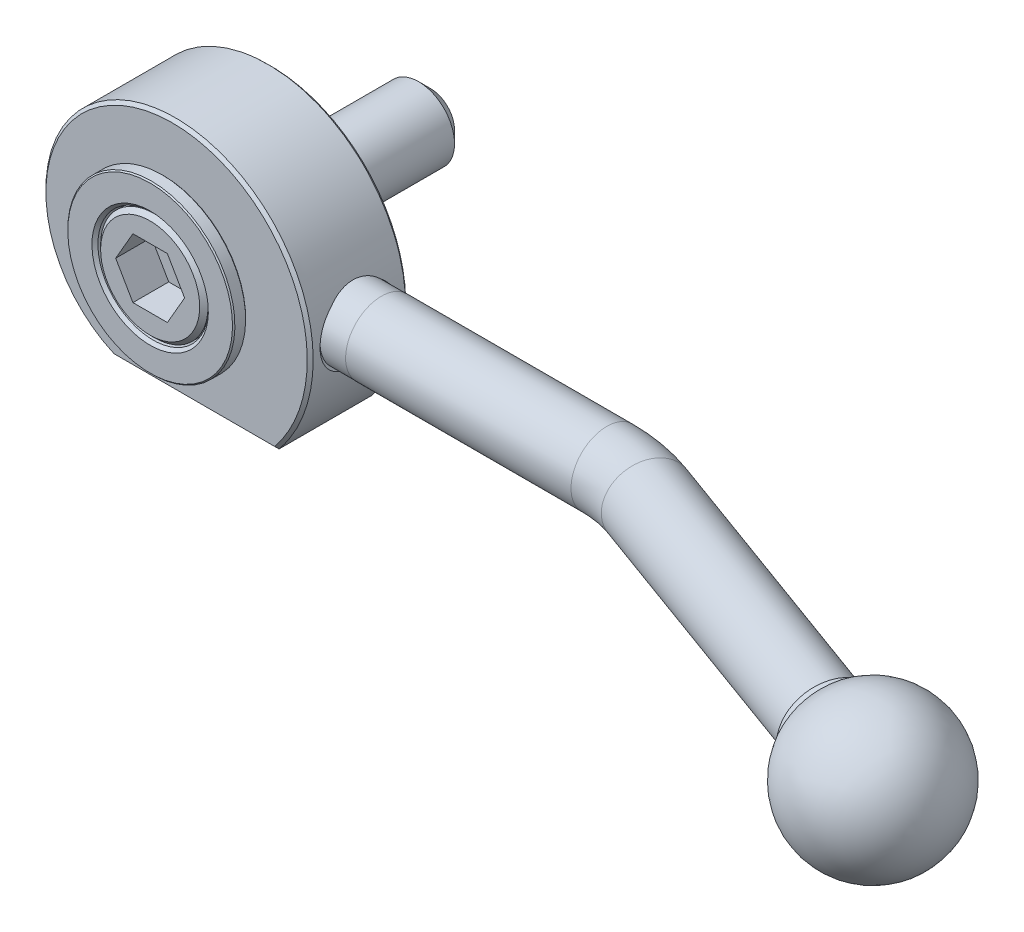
ISO-10303-21;
HEADER;
FILE_DESCRIPTION(('STEP AP214'),'2;1');
FILE_NAME('part.step','',(''),(''),'','','');
FILE_SCHEMA(('AUTOMOTIVE_DESIGN { 1 0 10303 214 1 1 1 1 }'));
ENDSEC;
DATA;
#1=APPLICATION_CONTEXT('core data for automotive mechanical design processes');
#2=APPLICATION_PROTOCOL_DEFINITION('international standard','automotive_design',2000,#1);
#3=PRODUCT_CONTEXT('',#1,'mechanical');
#4=PRODUCT('Part','Part','',(#3));
#5=PRODUCT_RELATED_PRODUCT_CATEGORY('part','',(#4));
#6=PRODUCT_DEFINITION_FORMATION('','',#4);
#7=PRODUCT_DEFINITION_CONTEXT('part definition',#1,'design');
#8=PRODUCT_DEFINITION('design','',#6,#7);
#9=PRODUCT_DEFINITION_SHAPE('','',#8);
#10=(LENGTH_UNIT() NAMED_UNIT(*) SI_UNIT(.MILLI.,.METRE.));
#11=(NAMED_UNIT(*) PLANE_ANGLE_UNIT() SI_UNIT($,.RADIAN.));
#12=(NAMED_UNIT(*) SI_UNIT($,.STERADIAN.) SOLID_ANGLE_UNIT());
#13=UNCERTAINTY_MEASURE_WITH_UNIT(LENGTH_MEASURE(1.E-05),#10,'distance_accuracy_value','');
#14=(GEOMETRIC_REPRESENTATION_CONTEXT(3) GLOBAL_UNCERTAINTY_ASSIGNED_CONTEXT((#13)) GLOBAL_UNIT_ASSIGNED_CONTEXT((#10,
#11,#12)) REPRESENTATION_CONTEXT('',''));
#15=CARTESIAN_POINT('',(0.,0.,0.));
#16=DIRECTION('',(0.,0.,1.));
#17=DIRECTION('',(1.,0.,0.));
#18=AXIS2_PLACEMENT_3D('',#15,#16,#17);
#19=CARTESIAN_POINT('',(133.429251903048,-1.85430811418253E-12,34.3363596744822));
#20=DIRECTION('',(-0.939692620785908,0.,-0.342020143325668));
#21=DIRECTION('',(-0.00466882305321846,-0.999906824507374,0.0128274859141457));
#22=AXIS2_PLACEMENT_3D('',#19,#20,#21);
#23=SPHERICAL_SURFACE('',#22,12.5);
#24=CARTESIAN_POINT('',(123.860638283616,2.34887451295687E-13,30.8536691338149));
#25=DIRECTION('',(-0.939692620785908,0.,-0.342020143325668));
#26=DIRECTION('',(0.341988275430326,-0.0136507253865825,-0.939605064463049));
#27=AXIS2_PLACEMENT_3D('',#24,#25,#26);
#28=CIRCLE('',#27,7.2500000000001);
#29=CARTESIAN_POINT('',(126.340053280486,-0.0989677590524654,24.0415324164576));
#30=VERTEX_POINT('',#29);
#31=EDGE_CURVE('E601',#30,#30,#28,.T.);
#32=ORIENTED_EDGE('',*,*,#31,.F.);
#33=EDGE_LOOP('',(#32));
#34=FACE_BOUND('',#33,.T.);
#35=ADVANCED_FACE('F15',(#34),#23,.T.);
#36=CARTESIAN_POINT('',(122.622786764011,2.59463096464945E-13,30.4031280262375));
#37=DIRECTION('',(-0.939692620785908,0.,-0.342020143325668));
#38=DIRECTION('',(0.341988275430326,-0.0136507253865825,-0.939605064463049));
#39=AXIS2_PLACEMENT_3D('',#36,#37,#38);
#40=PLANE('',#39);
#41=CARTESIAN_POINT('',(122.622786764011,2.6111833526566E-13,30.4031280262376));
#42=DIRECTION('',(-0.939692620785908,0.,-0.342020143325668));
#43=DIRECTION('',(-0.342020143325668,0.,0.939692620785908));
#44=AXIS2_PLACEMENT_3D('',#41,#42,#43);
#45=CIRCLE('',#44,5.79999999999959);
#46=CARTESIAN_POINT('',(124.6065035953,2.65389384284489E-13,24.9529108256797));
#47=VERTEX_POINT('',#46);
#48=EDGE_CURVE('E9',#47,#47,#45,.T.);
#49=ORIENTED_EDGE('',*,*,#48,.F.);
#50=EDGE_LOOP('',(#49));
#51=FACE_BOUND('',#50,.T.);
#52=CARTESIAN_POINT('',(122.622786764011,2.59463096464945E-13,30.4031280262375));
#53=DIRECTION('',(-0.939692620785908,0.,-0.342020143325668));
#54=DIRECTION('',(0.341988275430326,-0.0136507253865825,-0.939605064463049));
#55=AXIS2_PLACEMENT_3D('',#52,#53,#54);
#56=CIRCLE('',#55,7.2500000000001);
#57=CARTESIAN_POINT('',(125.102201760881,-0.0989677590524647,23.5909913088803));
#58=VERTEX_POINT('',#57);
#59=EDGE_CURVE('E27',#58,#58,#56,.T.);
#60=ORIENTED_EDGE('',*,*,#59,.T.);
#61=EDGE_LOOP('',(#60));
#62=FACE_BOUND('',#61,.T.);
#63=ADVANCED_FACE('F609',(#51,#62),#40,.T.);
#64=CARTESIAN_POINT('',(122.622786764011,2.59463096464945E-13,30.4031280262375));
#65=DIRECTION('',(-0.939692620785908,0.,-0.342020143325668));
#66=DIRECTION('',(0.341988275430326,-0.0136507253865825,-0.939605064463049));
#67=AXIS2_PLACEMENT_3D('',#64,#65,#66);
#68=CYLINDRICAL_SURFACE('',#67,7.2500000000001);
#69=CARTESIAN_POINT('',(126.340053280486,-0.0989677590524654,24.0415324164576));
#70=CARTESIAN_POINT('',(126.327158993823,-0.0989677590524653,24.0368392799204));
#71=CARTESIAN_POINT('',(126.314264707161,-0.0989677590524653,24.0321461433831));
#72=CARTESIAN_POINT('',(126.288476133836,-0.0989677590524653,24.0227598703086));
#73=CARTESIAN_POINT('',(126.275581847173,-0.0989677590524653,24.0180667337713));
#74=CARTESIAN_POINT('',(126.249793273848,-0.0989677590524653,24.0086804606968));
#75=CARTESIAN_POINT('',(126.236898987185,-0.0989677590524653,24.0039873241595));
#76=CARTESIAN_POINT('',(126.21111041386,-0.0989677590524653,23.994601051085));
#77=CARTESIAN_POINT('',(126.198216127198,-0.0989677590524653,23.9899079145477));
#78=CARTESIAN_POINT('',(126.172427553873,-0.0989677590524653,23.9805216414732));
#79=CARTESIAN_POINT('',(126.15953326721,-0.0989677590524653,23.9758285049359));
#80=CARTESIAN_POINT('',(126.133744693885,-0.0989677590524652,23.9664422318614));
#81=CARTESIAN_POINT('',(126.120850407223,-0.0989677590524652,23.9617490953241));
#82=CARTESIAN_POINT('',(126.095061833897,-0.0989677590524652,23.9523628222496));
#83=CARTESIAN_POINT('',(126.082167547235,-0.0989677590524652,23.9476696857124));
#84=CARTESIAN_POINT('',(126.05637897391,-0.0989677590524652,23.9382834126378));
#85=CARTESIAN_POINT('',(126.043484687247,-0.0989677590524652,23.9335902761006));
#86=CARTESIAN_POINT('',(126.017696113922,-0.0989677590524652,23.924204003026));
#87=CARTESIAN_POINT('',(126.00480182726,-0.0989677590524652,23.9195108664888));
#88=CARTESIAN_POINT('',(125.979013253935,-0.0989677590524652,23.9101245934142));
#89=CARTESIAN_POINT('',(125.966118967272,-0.0989677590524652,23.905431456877));
#90=CARTESIAN_POINT('',(125.940330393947,-0.0989677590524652,23.8960451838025));
#91=CARTESIAN_POINT('',(125.927436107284,-0.0989677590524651,23.8913520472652));
#92=CARTESIAN_POINT('',(125.901647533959,-0.0989677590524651,23.8819657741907));
#93=CARTESIAN_POINT('',(125.888753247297,-0.0989677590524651,23.8772726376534));
#94=CARTESIAN_POINT('',(125.862964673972,-0.0989677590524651,23.8678863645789));
#95=CARTESIAN_POINT('',(125.850070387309,-0.0989677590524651,23.8631932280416));
#96=CARTESIAN_POINT('',(125.824281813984,-0.0989677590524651,23.8538069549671));
#97=CARTESIAN_POINT('',(125.811387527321,-0.0989677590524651,23.8491138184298));
#98=CARTESIAN_POINT('',(125.785598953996,-0.0989677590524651,23.8397275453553));
#99=CARTESIAN_POINT('',(125.772704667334,-0.0989677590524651,23.835034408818));
#100=CARTESIAN_POINT('',(125.746916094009,-0.0989677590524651,23.8256481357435));
#101=CARTESIAN_POINT('',(125.734021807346,-0.0989677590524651,23.8209549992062));
#102=CARTESIAN_POINT('',(125.708233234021,-0.098967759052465,23.8115687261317));
#103=CARTESIAN_POINT('',(125.695338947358,-0.098967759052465,23.8068755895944));
#104=CARTESIAN_POINT('',(125.669550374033,-0.098967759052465,23.7974893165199));
#105=CARTESIAN_POINT('',(125.656656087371,-0.098967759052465,23.7927961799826));
#106=CARTESIAN_POINT('',(125.630867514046,-0.098967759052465,23.7834099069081));
#107=CARTESIAN_POINT('',(125.617973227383,-0.098967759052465,23.7787167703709));
#108=CARTESIAN_POINT('',(125.592184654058,-0.098967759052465,23.7693304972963));
#109=CARTESIAN_POINT('',(125.579290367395,-0.098967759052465,23.7646373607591));
#110=CARTESIAN_POINT('',(125.55350179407,-0.098967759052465,23.7552510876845));
#111=CARTESIAN_POINT('',(125.540607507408,-0.098967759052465,23.7505579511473));
#112=CARTESIAN_POINT('',(125.514818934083,-0.0989677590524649,23.7411716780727));
#113=CARTESIAN_POINT('',(125.50192464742,-0.0989677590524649,23.7364785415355));
#114=CARTESIAN_POINT('',(125.476136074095,-0.0989677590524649,23.727092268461));
#115=CARTESIAN_POINT('',(125.463241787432,-0.0989677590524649,23.7223991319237));
#116=CARTESIAN_POINT('',(125.437453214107,-0.0989677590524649,23.7130128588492));
#117=CARTESIAN_POINT('',(125.424558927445,-0.0989677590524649,23.7083197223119));
#118=CARTESIAN_POINT('',(125.39877035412,-0.0989677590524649,23.6989334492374));
#119=CARTESIAN_POINT('',(125.385876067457,-0.0989677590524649,23.6942403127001));
#120=CARTESIAN_POINT('',(125.360087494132,-0.0989677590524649,23.6848540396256));
#121=CARTESIAN_POINT('',(125.34719320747,-0.0989677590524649,23.6801609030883));
#122=CARTESIAN_POINT('',(125.321404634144,-0.0989677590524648,23.6707746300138));
#123=CARTESIAN_POINT('',(125.308510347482,-0.0989677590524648,23.6660814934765));
#124=CARTESIAN_POINT('',(125.282721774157,-0.0989677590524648,23.656695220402));
#125=CARTESIAN_POINT('',(125.269827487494,-0.0989677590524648,23.6520020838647));
#126=CARTESIAN_POINT('',(125.244038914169,-0.0989677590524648,23.6426158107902));
#127=CARTESIAN_POINT('',(125.231144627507,-0.0989677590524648,23.6379226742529));
#128=CARTESIAN_POINT('',(125.205356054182,-0.0989677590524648,23.6285364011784));
#129=CARTESIAN_POINT('',(125.192461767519,-0.0989677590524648,23.6238432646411));
#130=CARTESIAN_POINT('',(125.166673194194,-0.0989677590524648,23.6144569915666));
#131=CARTESIAN_POINT('',(125.153778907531,-0.0989677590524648,23.6097638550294));
#132=CARTESIAN_POINT('',(125.127990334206,-0.0989677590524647,23.6003775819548));
#133=CARTESIAN_POINT('',(125.115096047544,-0.0989677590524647,23.5956844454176));
#134=CARTESIAN_POINT('',(125.102201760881,-0.0989677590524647,23.5909913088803));
#135=B_SPLINE_CURVE_WITH_KNOTS('',3,(#69,#70,#71,#72,#73,#74,#75,#76,#77,#78,#79,#80,#81,#82,
#83,#84,#85,#86,#87,#88,#89,#90,#91,#92,#93,#94,#95,#96,#97,#98,#99,#100,#101,#102,#103,#104,
#105,#106,#107,#108,#109,#110,#111,#112,#113,#114,#115,#116,#117,#118,#119,#120,#121,#122,#123,
#124,#125,#126,#127,#128,#129,#130,#131,#132,#133,#134),.UNSPECIFIED.,.F.,.F.,(4,2,2,2,2,2,2,2,
2,2,2,2,2,2,2,2,2,2,2,2,2,2,2,2,2,2,2,2,2,2,2,2,4),(0.,0.0411654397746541,0.0823308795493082,
0.123496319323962,0.164661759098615,0.205827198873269,0.246992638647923,0.288158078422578,
0.32932351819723,0.370488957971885,0.411654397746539,0.452819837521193,0.493985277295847,
0.5351507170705,0.576316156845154,0.617481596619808,0.658647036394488,0.699812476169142,
0.740977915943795,0.782143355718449,0.823308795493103,0.864474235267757,0.905639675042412,
0.946805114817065,0.987970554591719,1.02913599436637,1.07030143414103,1.11146687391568,
1.15263231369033,1.19379775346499,1.23496319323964,1.2761286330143,1.31729407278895),.UNSPECIFIED.);
#136=EDGE_CURVE('BSEAM334',#30,#58,#135,.T.);
#137=ORIENTED_EDGE('',*,*,#31,.T.);
#138=ORIENTED_EDGE('',*,*,#59,.F.);
#139=ORIENTED_EDGE('',*,*,#136,.T.);
#140=ORIENTED_EDGE('',*,*,#136,.F.);
#141=EDGE_LOOP('',(#137,#139,#138,#140));
#142=FACE_BOUND('',#141,.T.);
#143=ADVANCED_FACE('F334',(#142),#68,.T.);
#144=CARTESIAN_POINT('',(-2.88675134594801,5.,16.));
#145=DIRECTION('',(0.,0.,-1.));
#146=DIRECTION('',(0.,-1.,0.));
#147=AXIS2_PLACEMENT_3D('',#144,#145,#146);
#148=PLANE('',#147);
#149=DIRECTION('',(-0.5,-0.866025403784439,0.));
#150=VECTOR('',#149,1.);
#151=CARTESIAN_POINT('',(-2.88675134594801,5.,16.));
#152=LINE('',#151,#150);
#153=CARTESIAN_POINT('',(-2.88675134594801,5.,16.));
#154=VERTEX_POINT('',#153);
#155=CARTESIAN_POINT('',(-5.77350269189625,0.,16.));
#156=VERTEX_POINT('',#155);
#157=EDGE_CURVE('E479',#154,#156,#152,.T.);
#158=ORIENTED_EDGE('',*,*,#157,.T.);
#159=DIRECTION('',(0.5,-0.866025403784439,0.));
#160=VECTOR('',#159,1.);
#161=CARTESIAN_POINT('',(-5.77350269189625,0.,16.));
#162=LINE('',#161,#160);
#163=CARTESIAN_POINT('',(-2.88675134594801,-5.,16.));
#164=VERTEX_POINT('',#163);
#165=EDGE_CURVE('E482',#156,#164,#162,.T.);
#166=ORIENTED_EDGE('',*,*,#165,.T.);
#167=DIRECTION('',(1.,0.,0.));
#168=VECTOR('',#167,1.);
#169=CARTESIAN_POINT('',(-2.88675134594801,-5.,16.));
#170=LINE('',#169,#168);
#171=CARTESIAN_POINT('',(2.88675134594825,-5.,16.));
#172=VERTEX_POINT('',#171);
#173=EDGE_CURVE('E485',#164,#172,#170,.T.);
#174=ORIENTED_EDGE('',*,*,#173,.T.);
#175=DIRECTION('',(0.5,0.866025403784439,0.));
#176=VECTOR('',#175,1.);
#177=CARTESIAN_POINT('',(2.88675134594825,-5.,16.));
#178=LINE('',#177,#176);
#179=CARTESIAN_POINT('',(5.77350269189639,0.,16.));
#180=VERTEX_POINT('',#179);
#181=EDGE_CURVE('E488',#172,#180,#178,.T.);
#182=ORIENTED_EDGE('',*,*,#181,.T.);
#183=DIRECTION('',(-0.5,0.866025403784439,0.));
#184=VECTOR('',#183,1.);
#185=CARTESIAN_POINT('',(5.77350269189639,0.,16.));
#186=LINE('',#185,#184);
#187=CARTESIAN_POINT('',(2.88675134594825,5.,16.));
#188=VERTEX_POINT('',#187);
#189=EDGE_CURVE('E491',#180,#188,#186,.T.);
#190=ORIENTED_EDGE('',*,*,#189,.T.);
#191=DIRECTION('',(-1.,0.,0.));
#192=VECTOR('',#191,1.);
#193=CARTESIAN_POINT('',(2.88675134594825,5.,16.));
#194=LINE('',#193,#192);
#195=EDGE_CURVE('E494',#188,#154,#194,.T.);
#196=ORIENTED_EDGE('',*,*,#195,.T.);
#197=EDGE_LOOP('',(#158,#166,#174,#182,#190,#196));
#198=FACE_BOUND('',#197,.T.);
#199=ADVANCED_FACE('F322',(#198),#148,.F.);
#200=CARTESIAN_POINT('',(-2.88675134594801,-5.,16.));
#201=DIRECTION('',(0.,-1.,0.));
#202=DIRECTION('',(1.,0.,0.));
#203=AXIS2_PLACEMENT_3D('',#200,#201,#202);
#204=PLANE('',#203);
#205=DIRECTION('',(1.,0.,0.));
#206=VECTOR('',#205,1.);
#207=CARTESIAN_POINT('',(-2.886751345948,-5.,22.));
#208=LINE('',#207,#206);
#209=CARTESIAN_POINT('',(-2.886751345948,-5.,22.));
#210=VERTEX_POINT('',#209);
#211=CARTESIAN_POINT('',(2.88675134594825,-5.,22.));
#212=VERTEX_POINT('',#211);
#213=EDGE_CURVE('E463',#210,#212,#208,.T.);
#214=ORIENTED_EDGE('',*,*,#213,.T.);
#215=DIRECTION('',(0.,0.,1.));
#216=VECTOR('',#215,1.);
#217=CARTESIAN_POINT('',(2.88675134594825,-5.,16.));
#218=LINE('',#217,#216);
#219=EDGE_CURVE('E505',#172,#212,#218,.T.);
#220=ORIENTED_EDGE('',*,*,#219,.F.);
#221=ORIENTED_EDGE('',*,*,#173,.F.);
#222=DIRECTION('',(0.,0.,1.));
#223=VECTOR('',#222,1.);
#224=CARTESIAN_POINT('',(-2.88675134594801,-5.,16.));
#225=LINE('',#224,#223);
#226=EDGE_CURVE('E507',#164,#210,#225,.T.);
#227=ORIENTED_EDGE('',*,*,#226,.T.);
#228=EDGE_LOOP('',(#214,#220,#221,#227));
#229=FACE_BOUND('',#228,.T.);
#230=ADVANCED_FACE('F333',(#229),#204,.F.);
#231=CARTESIAN_POINT('',(2.88675134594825,-5.,16.));
#232=DIRECTION('',(0.866025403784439,-0.5,0.));
#233=DIRECTION('',(0.5,0.866025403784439,0.));
#234=AXIS2_PLACEMENT_3D('',#231,#232,#233);
#235=PLANE('',#234);
#236=DIRECTION('',(0.5,0.866025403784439,0.));
#237=VECTOR('',#236,1.);
#238=CARTESIAN_POINT('',(2.88675134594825,-5.,22.));
#239=LINE('',#238,#237);
#240=CARTESIAN_POINT('',(5.77350269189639,0.,22.));
#241=VERTEX_POINT('',#240);
#242=EDGE_CURVE('E470',#212,#241,#239,.T.);
#243=ORIENTED_EDGE('',*,*,#242,.T.);
#244=DIRECTION('',(0.,0.,1.));
#245=VECTOR('',#244,1.);
#246=CARTESIAN_POINT('',(5.77350269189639,0.,16.));
#247=LINE('',#246,#245);
#248=EDGE_CURVE('E503',#180,#241,#247,.T.);
#249=ORIENTED_EDGE('',*,*,#248,.F.);
#250=ORIENTED_EDGE('',*,*,#181,.F.);
#251=ORIENTED_EDGE('',*,*,#219,.T.);
#252=EDGE_LOOP('',(#243,#249,#250,#251));
#253=FACE_BOUND('',#252,.T.);
#254=ADVANCED_FACE('F344',(#253),#235,.F.);
#255=CARTESIAN_POINT('',(5.77350269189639,0.,16.));
#256=DIRECTION('',(0.866025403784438,0.5,0.));
#257=DIRECTION('',(-0.5,0.866025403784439,0.));
#258=AXIS2_PLACEMENT_3D('',#255,#256,#257);
#259=PLANE('',#258);
#260=DIRECTION('',(-0.5,0.866025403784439,0.));
#261=VECTOR('',#260,1.);
#262=CARTESIAN_POINT('',(5.77350269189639,0.,22.));
#263=LINE('',#262,#261);
#264=CARTESIAN_POINT('',(2.88675134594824,5.,22.));
#265=VERTEX_POINT('',#264);
#266=EDGE_CURVE('E473',#241,#265,#263,.T.);
#267=ORIENTED_EDGE('',*,*,#266,.T.);
#268=DIRECTION('',(0.,0.,1.));
#269=VECTOR('',#268,1.);
#270=CARTESIAN_POINT('',(2.88675134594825,5.,16.));
#271=LINE('',#270,#269);
#272=EDGE_CURVE('E501',#188,#265,#271,.T.);
#273=ORIENTED_EDGE('',*,*,#272,.F.);
#274=ORIENTED_EDGE('',*,*,#189,.F.);
#275=ORIENTED_EDGE('',*,*,#248,.T.);
#276=EDGE_LOOP('',(#267,#273,#274,#275));
#277=FACE_BOUND('',#276,.T.);
#278=ADVANCED_FACE('F340',(#277),#259,.F.);
#279=CARTESIAN_POINT('',(2.88675134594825,5.,16.));
#280=DIRECTION('',(0.,1.,0.));
#281=DIRECTION('',(-1.,0.,0.));
#282=AXIS2_PLACEMENT_3D('',#279,#280,#281);
#283=PLANE('',#282);
#284=DIRECTION('',(-1.,0.,0.));
#285=VECTOR('',#284,1.);
#286=CARTESIAN_POINT('',(2.88675134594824,5.,22.));
#287=LINE('',#286,#285);
#288=CARTESIAN_POINT('',(-2.88675134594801,5.,22.));
#289=VERTEX_POINT('',#288);
#290=EDGE_CURVE('E476',#265,#289,#287,.T.);
#291=ORIENTED_EDGE('',*,*,#290,.T.);
#292=DIRECTION('',(0.,0.,1.));
#293=VECTOR('',#292,1.);
#294=CARTESIAN_POINT('',(-2.88675134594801,5.,16.));
#295=LINE('',#294,#293);
#296=EDGE_CURVE('E498',#154,#289,#295,.T.);
#297=ORIENTED_EDGE('',*,*,#296,.F.);
#298=ORIENTED_EDGE('',*,*,#195,.F.);
#299=ORIENTED_EDGE('',*,*,#272,.T.);
#300=EDGE_LOOP('',(#291,#297,#298,#299));
#301=FACE_BOUND('',#300,.T.);
#302=ADVANCED_FACE('F336',(#301),#283,.F.);
#303=CARTESIAN_POINT('',(-2.88675134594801,5.,16.));
#304=DIRECTION('',(-0.866025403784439,0.5,0.));
#305=DIRECTION('',(-0.5,-0.866025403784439,0.));
#306=AXIS2_PLACEMENT_3D('',#303,#304,#305);
#307=PLANE('',#306);
#308=DIRECTION('',(-0.5,-0.866025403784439,0.));
#309=VECTOR('',#308,1.);
#310=CARTESIAN_POINT('',(-2.88675134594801,5.,22.));
#311=LINE('',#310,#309);
#312=CARTESIAN_POINT('',(-5.77350269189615,0.,22.));
#313=VERTEX_POINT('',#312);
#314=EDGE_CURVE('E456',#289,#313,#311,.T.);
#315=ORIENTED_EDGE('',*,*,#314,.T.);
#316=DIRECTION('',(0.,0.,1.));
#317=VECTOR('',#316,1.);
#318=CARTESIAN_POINT('',(-5.77350269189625,0.,16.));
#319=LINE('',#318,#317);
#320=EDGE_CURVE('E497',#156,#313,#319,.T.);
#321=ORIENTED_EDGE('',*,*,#320,.F.);
#322=ORIENTED_EDGE('',*,*,#157,.F.);
#323=ORIENTED_EDGE('',*,*,#296,.T.);
#324=EDGE_LOOP('',(#315,#321,#322,#323));
#325=FACE_BOUND('',#324,.T.);
#326=ADVANCED_FACE('F339',(#325),#307,.F.);
#327=CARTESIAN_POINT('',(-5.77350269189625,0.,16.));
#328=DIRECTION('',(-0.866025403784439,-0.5,0.));
#329=DIRECTION('',(0.5,-0.866025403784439,0.));
#330=AXIS2_PLACEMENT_3D('',#327,#328,#329);
#331=PLANE('',#330);
#332=DIRECTION('',(0.5,-0.866025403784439,0.));
#333=VECTOR('',#332,1.);
#334=CARTESIAN_POINT('',(-5.77350269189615,0.,22.));
#335=LINE('',#334,#333);
#336=EDGE_CURVE('E458',#313,#210,#335,.T.);
#337=ORIENTED_EDGE('',*,*,#336,.T.);
#338=ORIENTED_EDGE('',*,*,#226,.F.);
#339=ORIENTED_EDGE('',*,*,#165,.F.);
#340=ORIENTED_EDGE('',*,*,#320,.T.);
#341=EDGE_LOOP('',(#337,#338,#339,#340));
#342=FACE_BOUND('',#341,.T.);
#343=ADVANCED_FACE('F352',(#342),#331,.F.);
#344=CARTESIAN_POINT('',(1.33994399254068E-13,-9.,22.));
#345=DIRECTION('',(0.,0.,-1.));
#346=DIRECTION('',(0.,-1.,0.));
#347=AXIS2_PLACEMENT_3D('',#344,#345,#346);
#348=PLANE('',#347);
#349=CARTESIAN_POINT('',(1.33994399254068E-13,0.,22.));
#350=DIRECTION('',(0.,0.,-1.));
#351=DIRECTION('',(0.,-1.,0.));
#352=AXIS2_PLACEMENT_3D('',#349,#350,#351);
#353=CIRCLE('',#352,8.3);
#354=CARTESIAN_POINT('',(1.33994399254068E-13,-8.3,22.));
#355=VERTEX_POINT('',#354);
#356=EDGE_CURVE('E521',#355,#355,#353,.F.);
#357=ORIENTED_EDGE('',*,*,#356,.T.);
#358=EDGE_LOOP('',(#357));
#359=FACE_BOUND('',#358,.T.);
#360=ORIENTED_EDGE('',*,*,#336,.F.);
#361=ORIENTED_EDGE('',*,*,#314,.F.);
#362=ORIENTED_EDGE('',*,*,#290,.F.);
#363=ORIENTED_EDGE('',*,*,#266,.F.);
#364=ORIENTED_EDGE('',*,*,#242,.F.);
#365=ORIENTED_EDGE('',*,*,#213,.F.);
#366=EDGE_LOOP('',(#360,#361,#362,#363,#364,#365));
#367=FACE_BOUND('',#366,.T.);
#368=ADVANCED_FACE('F355',(#359,#367),#348,.F.);
#369=CARTESIAN_POINT('',(1.33994399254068E-13,0.,22.));
#370=DIRECTION('',(0.,0.,-1.));
#371=DIRECTION('',(0.,-1.,0.));
#372=AXIS2_PLACEMENT_3D('',#369,#370,#371);
#373=CONICAL_SURFACE('',#372,8.3,0.785398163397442);
#374=CARTESIAN_POINT('',(0.,0.,21.3));
#375=DIRECTION('',(0.,0.,-1.));
#376=DIRECTION('',(0.,-1.,0.));
#377=AXIS2_PLACEMENT_3D('',#374,#375,#376);
#378=CIRCLE('',#377,9.);
#379=CARTESIAN_POINT('',(0.,-9.,21.3));
#380=VERTEX_POINT('',#379);
#381=EDGE_CURVE('E524',#380,#380,#378,.T.);
#382=ORIENTED_EDGE('',*,*,#381,.F.);
#383=EDGE_LOOP('',(#382));
#384=FACE_BOUND('',#383,.T.);
#385=ORIENTED_EDGE('',*,*,#356,.F.);
#386=EDGE_LOOP('',(#385));
#387=FACE_BOUND('',#386,.T.);
#388=ADVANCED_FACE('F362',(#384,#387),#373,.T.);
#389=CARTESIAN_POINT('',(1.28590474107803E-13,0.,160.));
#390=DIRECTION('',(0.,0.,1.));
#391=DIRECTION('',(0.,1.,0.));
#392=AXIS2_PLACEMENT_3D('',#389,#390,#391);
#393=CYLINDRICAL_SURFACE('',#392,9.);
#394=ORIENTED_EDGE('',*,*,#381,.T.);
#395=EDGE_LOOP('',(#394));
#396=FACE_BOUND('',#395,.T.);
#397=CARTESIAN_POINT('',(1.2903386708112E-13,0.,10.));
#398=DIRECTION('',(0.,0.,1.));
#399=DIRECTION('',(0.,1.,0.));
#400=AXIS2_PLACEMENT_3D('',#397,#398,#399);
#401=CIRCLE('',#400,9.);
#402=CARTESIAN_POINT('',(1.2903386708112E-13,9.,10.));
#403=VERTEX_POINT('',#402);
#404=EDGE_CURVE('E500',#403,#403,#401,.T.);
#405=ORIENTED_EDGE('',*,*,#404,.T.);
#406=EDGE_LOOP('',(#405));
#407=FACE_BOUND('',#406,.T.);
#408=ADVANCED_FACE('F233',(#396,#407),#393,.T.);
#409=CARTESIAN_POINT('',(0.,6.25,10.));
#410=DIRECTION('',(0.,0.,-1.));
#411=DIRECTION('',(0.,-1.,0.));
#412=AXIS2_PLACEMENT_3D('',#409,#410,#411);
#413=PLANE('',#412);
#414=ORIENTED_EDGE('',*,*,#404,.F.);
#415=EDGE_LOOP('',(#414));
#416=FACE_BOUND('',#415,.T.);
#417=CARTESIAN_POINT('',(0.,0.,10.));
#418=DIRECTION('',(0.,0.,1.));
#419=DIRECTION('',(0.,1.,0.));
#420=AXIS2_PLACEMENT_3D('',#417,#418,#419);
#421=CIRCLE('',#420,9.25);
#422=CARTESIAN_POINT('',(0.,9.25,10.));
#423=VERTEX_POINT('',#422);
#424=EDGE_CURVE('E118',#423,#423,#421,.T.);
#425=ORIENTED_EDGE('',*,*,#424,.T.);
#426=EDGE_LOOP('',(#425));
#427=FACE_BOUND('',#426,.T.);
#428=ADVANCED_FACE('F327',(#416,#427),#413,.F.);
#429=CARTESIAN_POINT('',(1.14565648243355E-13,0.,-25.));
#430=DIRECTION('',(0.,0.,-1.));
#431=DIRECTION('',(0.,-1.,0.));
#432=AXIS2_PLACEMENT_3D('',#429,#430,#431);
#433=PLANE('',#432);
#434=CARTESIAN_POINT('',(1.14565648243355E-13,0.,-25.));
#435=DIRECTION('',(0.,0.,-1.));
#436=DIRECTION('',(0.,-1.,0.));
#437=AXIS2_PLACEMENT_3D('',#434,#435,#436);
#438=CIRCLE('',#437,4.);
#439=CARTESIAN_POINT('',(1.14565648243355E-13,-4.,-25.));
#440=VERTEX_POINT('',#439);
#441=EDGE_CURVE('E515',#440,#440,#438,.T.);
#442=ORIENTED_EDGE('',*,*,#441,.T.);
#443=EDGE_LOOP('',(#442));
#444=FACE_BOUND('',#443,.T.);
#445=ADVANCED_FACE('F323',(#444),#433,.T.);
#446=CARTESIAN_POINT('',(0.,0.,19.8));
#447=DIRECTION('',(0.,0.,1.));
#448=DIRECTION('',(0.,1.,0.));
#449=AXIS2_PLACEMENT_3D('',#446,#447,#448);
#450=CYLINDRICAL_SURFACE('',#449,9.25);
#451=CARTESIAN_POINT('',(0.,0.,21.5));
#452=DIRECTION('',(0.,0.,1.));
#453=DIRECTION('',(0.,1.,0.));
#454=AXIS2_PLACEMENT_3D('',#451,#452,#453);
#455=CIRCLE('',#454,9.25);
#456=CARTESIAN_POINT('',(0.,9.25,21.5));
#457=VERTEX_POINT('',#456);
#458=EDGE_CURVE('E533',#457,#457,#455,.T.);
#459=ORIENTED_EDGE('',*,*,#458,.T.);
#460=EDGE_LOOP('',(#459));
#461=FACE_BOUND('',#460,.T.);
#462=ORIENTED_EDGE('',*,*,#424,.F.);
#463=EDGE_LOOP('',(#462));
#464=FACE_BOUND('',#463,.T.);
#465=ADVANCED_FACE('F326',(#461,#464),#450,.F.);
#466=CARTESIAN_POINT('',(1.14565648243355E-13,0.,-25.));
#467=DIRECTION('',(0.,0.,1.));
#468=DIRECTION('',(0.,1.,0.));
#469=AXIS2_PLACEMENT_3D('',#466,#467,#468);
#470=CONICAL_SURFACE('',#469,4.,0.785398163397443);
#471=CARTESIAN_POINT('',(1.15392403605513E-13,0.,-23.));
#472=DIRECTION('',(0.,0.,-1.));
#473=DIRECTION('',(0.,-1.,0.));
#474=AXIS2_PLACEMENT_3D('',#471,#472,#473);
#475=CIRCLE('',#474,6.);
#476=CARTESIAN_POINT('',(1.15392403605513E-13,-6.,-23.));
#477=VERTEX_POINT('',#476);
#478=EDGE_CURVE('E518',#477,#477,#475,.F.);
#479=ORIENTED_EDGE('',*,*,#478,.F.);
#480=EDGE_LOOP('',(#479));
#481=FACE_BOUND('',#480,.T.);
#482=ORIENTED_EDGE('',*,*,#441,.F.);
#483=EDGE_LOOP('',(#482));
#484=FACE_BOUND('',#483,.T.);
#485=ADVANCED_FACE('F329',(#481,#484),#470,.T.);
#486=CARTESIAN_POINT('',(0.,0.,21.5));
#487=DIRECTION('',(0.,0.,1.));
#488=DIRECTION('',(0.,1.,0.));
#489=AXIS2_PLACEMENT_3D('',#486,#487,#488);
#490=CONICAL_SURFACE('',#489,9.25,0.78539816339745);
#491=CARTESIAN_POINT('',(0.,0.,22.));
#492=DIRECTION('',(0.,0.,1.));
#493=DIRECTION('',(0.,1.,0.));
#494=AXIS2_PLACEMENT_3D('',#491,#492,#493);
#495=CIRCLE('',#494,9.75);
#496=CARTESIAN_POINT('',(0.,9.75,22.));
#497=VERTEX_POINT('',#496);
#498=EDGE_CURVE('E536',#497,#497,#495,.F.);
#499=ORIENTED_EDGE('',*,*,#498,.F.);
#500=EDGE_LOOP('',(#499));
#501=FACE_BOUND('',#500,.T.);
#502=ORIENTED_EDGE('',*,*,#458,.F.);
#503=EDGE_LOOP('',(#502));
#504=FACE_BOUND('',#503,.T.);
#505=ADVANCED_FACE('F268',(#501,#504),#490,.F.);
#506=CARTESIAN_POINT('',(1.28590474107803E-13,0.,160.));
#507=DIRECTION('',(0.,0.,1.));
#508=DIRECTION('',(0.,1.,0.));
#509=AXIS2_PLACEMENT_3D('',#506,#507,#508);
#510=CYLINDRICAL_SURFACE('',#509,6.);
#511=ORIENTED_EDGE('',*,*,#478,.T.);
#512=EDGE_LOOP('',(#511));
#513=FACE_BOUND('',#512,.T.);
#514=CARTESIAN_POINT('',(1.2903386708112E-13,0.,10.));
#515=DIRECTION('',(0.,0.,1.));
#516=DIRECTION('',(0.,1.,0.));
#517=AXIS2_PLACEMENT_3D('',#514,#515,#516);
#518=CIRCLE('',#517,6.);
#519=CARTESIAN_POINT('',(1.2903386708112E-13,6.,10.));
#520=VERTEX_POINT('',#519);
#521=EDGE_CURVE('E512',#520,#520,#518,.T.);
#522=ORIENTED_EDGE('',*,*,#521,.F.);
#523=EDGE_LOOP('',(#522));
#524=FACE_BOUND('',#523,.T.);
#525=ADVANCED_FACE('F330',(#513,#524),#510,.T.);
#526=CARTESIAN_POINT('',(0.,0.,22.));
#527=DIRECTION('',(0.,0.,1.));
#528=DIRECTION('',(0.,1.,0.));
#529=AXIS2_PLACEMENT_3D('',#526,#527,#528);
#530=PLANE('',#529);
#531=CARTESIAN_POINT('',(0.,0.,22.));
#532=DIRECTION('',(0.,0.,1.));
#533=DIRECTION('',(0.,1.,0.));
#534=AXIS2_PLACEMENT_3D('',#531,#532,#533);
#535=CIRCLE('',#534,13.8);
#536=CARTESIAN_POINT('',(0.,13.8,22.));
#537=VERTEX_POINT('',#536);
#538=EDGE_CURVE('E435',#537,#537,#535,.T.);
#539=ORIENTED_EDGE('',*,*,#538,.T.);
#540=EDGE_LOOP('',(#539));
#541=FACE_BOUND('',#540,.T.);
#542=ORIENTED_EDGE('',*,*,#498,.T.);
#543=EDGE_LOOP('',(#542));
#544=FACE_BOUND('',#543,.T.);
#545=ADVANCED_FACE('F371',(#541,#544),#530,.T.);
#546=CARTESIAN_POINT('',(1.2903386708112E-13,-6.,10.));
#547=DIRECTION('',(0.,0.,1.));
#548=DIRECTION('',(0.,1.,0.));
#549=AXIS2_PLACEMENT_3D('',#546,#547,#548);
#550=PLANE('',#549);
#551=ORIENTED_EDGE('',*,*,#521,.T.);
#552=EDGE_LOOP('',(#551));
#553=FACE_BOUND('',#552,.T.);
#554=CARTESIAN_POINT('',(0.,0.,10.));
#555=DIRECTION('',(0.,0.,1.));
#556=DIRECTION('',(1.,0.,0.));
#557=AXIS2_PLACEMENT_3D('',#554,#555,#556);
#558=CIRCLE('',#557,6.25);
#559=CARTESIAN_POINT('',(6.25,0.,10.));
#560=VERTEX_POINT('',#559);
#561=EDGE_CURVE('E527',#560,#560,#558,.T.);
#562=ORIENTED_EDGE('',*,*,#561,.F.);
#563=EDGE_LOOP('',(#562));
#564=FACE_BOUND('',#563,.T.);
#565=ADVANCED_FACE('F367',(#553,#564),#550,.F.);
#566=CARTESIAN_POINT('',(0.,0.,22.));
#567=DIRECTION('',(0.,0.,-1.));
#568=DIRECTION('',(0.,-1.,0.));
#569=AXIS2_PLACEMENT_3D('',#566,#567,#568);
#570=CONICAL_SURFACE('',#569,13.8,0.785398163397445);
#571=CARTESIAN_POINT('',(0.,0.,21.8));
#572=DIRECTION('',(0.,0.,1.));
#573=DIRECTION('',(0.,1.,0.));
#574=AXIS2_PLACEMENT_3D('',#571,#572,#573);
#575=CIRCLE('',#574,14.);
#576=CARTESIAN_POINT('',(0.,14.,21.8));
#577=VERTEX_POINT('',#576);
#578=EDGE_CURVE('E432',#577,#577,#575,.F.);
#579=ORIENTED_EDGE('',*,*,#578,.F.);
#580=EDGE_LOOP('',(#579));
#581=FACE_BOUND('',#580,.T.);
#582=ORIENTED_EDGE('',*,*,#538,.F.);
#583=EDGE_LOOP('',(#582));
#584=FACE_BOUND('',#583,.T.);
#585=ADVANCED_FACE('F370',(#581,#584),#570,.T.);
#586=CARTESIAN_POINT('',(0.,0.,0.));
#587=DIRECTION('',(0.,0.,1.));
#588=DIRECTION('',(0.,1.,0.));
#589=AXIS2_PLACEMENT_3D('',#586,#587,#588);
#590=CYLINDRICAL_SURFACE('',#589,6.25);
#591=CARTESIAN_POINT('',(0.,0.,0.5));
#592=DIRECTION('',(0.,0.,1.));
#593=DIRECTION('',(0.,1.,0.));
#594=AXIS2_PLACEMENT_3D('',#591,#592,#593);
#595=CIRCLE('',#594,6.25);
#596=CARTESIAN_POINT('',(0.,6.25,0.5));
#597=VERTEX_POINT('',#596);
#598=EDGE_CURVE('E548',#597,#597,#595,.F.);
#599=ORIENTED_EDGE('',*,*,#598,.T.);
#600=EDGE_LOOP('',(#599));
#601=FACE_BOUND('',#600,.T.);
#602=ORIENTED_EDGE('',*,*,#561,.T.);
#603=EDGE_LOOP('',(#602));
#604=FACE_BOUND('',#603,.T.);
#605=ADVANCED_FACE('F388',(#601,#604),#590,.F.);
#606=CARTESIAN_POINT('',(0.,0.,22.));
#607=DIRECTION('',(0.,0.,-1.));
#608=DIRECTION('',(0.,-1.,0.));
#609=AXIS2_PLACEMENT_3D('',#606,#607,#608);
#610=CYLINDRICAL_SURFACE('',#609,14.);
#611=CARTESIAN_POINT('',(0.,0.,20.));
#612=DIRECTION('',(0.,0.,1.));
#613=DIRECTION('',(0.,1.,0.));
#614=AXIS2_PLACEMENT_3D('',#611,#612,#613);
#615=CIRCLE('',#614,14.);
#616=CARTESIAN_POINT('',(0.,14.,20.));
#617=VERTEX_POINT('',#616);
#618=EDGE_CURVE('E443',#617,#617,#615,.T.);
#619=ORIENTED_EDGE('',*,*,#618,.T.);
#620=EDGE_LOOP('',(#619));
#621=FACE_BOUND('',#620,.T.);
#622=ORIENTED_EDGE('',*,*,#578,.T.);
#623=EDGE_LOOP('',(#622));
#624=FACE_BOUND('',#623,.T.);
#625=ADVANCED_FACE('F391',(#621,#624),#610,.T.);
#626=CARTESIAN_POINT('',(0.,0.,0.));
#627=DIRECTION('',(0.,0.,-1.));
#628=DIRECTION('',(0.,-1.,0.));
#629=AXIS2_PLACEMENT_3D('',#626,#627,#628);
#630=CONICAL_SURFACE('',#629,6.75,0.785398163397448);
#631=ORIENTED_EDGE('',*,*,#598,.F.);
#632=EDGE_LOOP('',(#631));
#633=FACE_BOUND('',#632,.T.);
#634=CARTESIAN_POINT('',(0.,0.,0.));
#635=DIRECTION('',(0.,0.,1.));
#636=DIRECTION('',(0.,1.,0.));
#637=AXIS2_PLACEMENT_3D('',#634,#635,#636);
#638=CIRCLE('',#637,6.75);
#639=CARTESIAN_POINT('',(0.,6.75,0.));
#640=VERTEX_POINT('',#639);
#641=EDGE_CURVE('E542',#640,#640,#638,.T.);
#642=ORIENTED_EDGE('',*,*,#641,.F.);
#643=EDGE_LOOP('',(#642));
#644=FACE_BOUND('',#643,.T.);
#645=ADVANCED_FACE('F393',(#633,#644),#630,.F.);
#646=CARTESIAN_POINT('',(0.,0.,20.));
#647=DIRECTION('',(0.,0.,1.));
#648=DIRECTION('',(0.,1.,0.));
#649=AXIS2_PLACEMENT_3D('',#646,#647,#648);
#650=CONICAL_SURFACE('',#649,14.,0.785398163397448);
#651=CARTESIAN_POINT('',(0.,0.,19.8));
#652=DIRECTION('',(0.,0.,1.));
#653=DIRECTION('',(0.,1.,0.));
#654=AXIS2_PLACEMENT_3D('',#651,#652,#653);
#655=CIRCLE('',#654,13.8);
#656=CARTESIAN_POINT('',(0.,13.8,19.8));
#657=VERTEX_POINT('',#656);
#658=EDGE_CURVE('E437',#657,#657,#655,.F.);
#659=ORIENTED_EDGE('',*,*,#658,.F.);
#660=EDGE_LOOP('',(#659));
#661=FACE_BOUND('',#660,.T.);
#662=ORIENTED_EDGE('',*,*,#618,.F.);
#663=EDGE_LOOP('',(#662));
#664=FACE_BOUND('',#663,.T.);
#665=ADVANCED_FACE('F403',(#661,#664),#650,.T.);
#666=CARTESIAN_POINT('',(0.,0.,0.));
#667=DIRECTION('',(0.,0.,1.));
#668=DIRECTION('',(0.,1.,0.));
#669=AXIS2_PLACEMENT_3D('',#666,#667,#668);
#670=PLANE('',#669);
#671=CARTESIAN_POINT('',(0.,0.,0.));
#672=DIRECTION('',(0.,0.,1.));
#673=DIRECTION('',(0.,1.,0.));
#674=AXIS2_PLACEMENT_3D('',#671,#672,#673);
#675=CIRCLE('',#674,11.75);
#676=CARTESIAN_POINT('',(0.,11.75,0.));
#677=VERTEX_POINT('',#676);
#678=EDGE_CURVE('E545',#677,#677,#675,.F.);
#679=ORIENTED_EDGE('',*,*,#678,.T.);
#680=EDGE_LOOP('',(#679));
#681=FACE_BOUND('',#680,.T.);
#682=ORIENTED_EDGE('',*,*,#641,.T.);
#683=EDGE_LOOP('',(#682));
#684=FACE_BOUND('',#683,.T.);
#685=ADVANCED_FACE('F401',(#681,#684),#670,.F.);
#686=CARTESIAN_POINT('',(0.,0.,19.8));
#687=DIRECTION('',(0.,0.,1.));
#688=DIRECTION('',(0.,1.,0.));
#689=AXIS2_PLACEMENT_3D('',#686,#687,#688);
#690=PLANE('',#689);
#691=CARTESIAN_POINT('',(0.,0.,19.8));
#692=DIRECTION('',(0.,0.,1.));
#693=DIRECTION('',(0.,1.,0.));
#694=AXIS2_PLACEMENT_3D('',#691,#692,#693);
#695=CIRCLE('',#694,12.65);
#696=CARTESIAN_POINT('',(0.,12.65,19.8));
#697=VERTEX_POINT('',#696);
#698=EDGE_CURVE('E436',#697,#697,#695,.T.);
#699=ORIENTED_EDGE('',*,*,#698,.T.);
#700=EDGE_LOOP('',(#699));
#701=FACE_BOUND('',#700,.T.);
#702=ORIENTED_EDGE('',*,*,#658,.T.);
#703=EDGE_LOOP('',(#702));
#704=FACE_BOUND('',#703,.T.);
#705=ADVANCED_FACE('F397',(#701,#704),#690,.F.);
#706=CARTESIAN_POINT('',(0.,0.,0.5));
#707=DIRECTION('',(0.,0.,1.));
#708=DIRECTION('',(0.,1.,0.));
#709=AXIS2_PLACEMENT_3D('',#706,#707,#708);
#710=CONICAL_SURFACE('',#709,12.25,0.785398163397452);
#711=ORIENTED_EDGE('',*,*,#678,.F.);
#712=EDGE_LOOP('',(#711));
#713=FACE_BOUND('',#712,.T.);
#714=CARTESIAN_POINT('',(0.,0.,0.5));
#715=DIRECTION('',(0.,0.,1.));
#716=DIRECTION('',(0.,1.,0.));
#717=AXIS2_PLACEMENT_3D('',#714,#715,#716);
#718=CIRCLE('',#717,12.25);
#719=CARTESIAN_POINT('',(0.,12.25,0.5));
#720=VERTEX_POINT('',#719);
#721=EDGE_CURVE('E539',#720,#720,#718,.T.);
#722=ORIENTED_EDGE('',*,*,#721,.F.);
#723=EDGE_LOOP('',(#722));
#724=FACE_BOUND('',#723,.T.);
#725=ADVANCED_FACE('F400',(#713,#724),#710,.T.);
#726=CARTESIAN_POINT('',(0.,0.,19.4));
#727=DIRECTION('',(0.,0.,1.));
#728=DIRECTION('',(0.,1.,0.));
#729=AXIS2_PLACEMENT_3D('',#726,#727,#728);
#730=TOROIDAL_SURFACE('',#729,12.65,0.4);
#731=CARTESIAN_POINT('',(0.,0.,19.4));
#732=DIRECTION('',(0.,0.,1.));
#733=DIRECTION('',(0.,1.,0.));
#734=AXIS2_PLACEMENT_3D('',#731,#732,#733);
#735=CIRCLE('',#734,12.25);
#736=CARTESIAN_POINT('',(0.,12.25,19.4));
#737=VERTEX_POINT('',#736);
#738=EDGE_CURVE('E440',#737,#737,#735,.F.);
#739=ORIENTED_EDGE('',*,*,#738,.F.);
#740=EDGE_LOOP('',(#739));
#741=FACE_BOUND('',#740,.T.);
#742=ORIENTED_EDGE('',*,*,#698,.F.);
#743=EDGE_LOOP('',(#742));
#744=FACE_BOUND('',#743,.T.);
#745=ADVANCED_FACE('F269',(#741,#744),#730,.F.);
#746=CARTESIAN_POINT('',(0.,0.,0.));
#747=DIRECTION('',(0.,0.,1.));
#748=DIRECTION('',(0.,1.,0.));
#749=AXIS2_PLACEMENT_3D('',#746,#747,#748);
#750=CYLINDRICAL_SURFACE('',#749,12.25);
#751=CARTESIAN_POINT('',(0.,2.69632413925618E-13,3.5));
#752=DIRECTION('',(0.,0.,-1.));
#753=DIRECTION('',(0.,1.,0.));
#754=AXIS2_PLACEMENT_3D('',#751,#752,#753);
#755=CIRCLE('',#754,12.25);
#756=CARTESIAN_POINT('',(0.,12.2500000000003,3.50000000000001));
#757=VERTEX_POINT('',#756);
#758=EDGE_CURVE('E449',#757,#757,#755,.F.);
#759=ORIENTED_EDGE('',*,*,#758,.F.);
#760=EDGE_LOOP('',(#759));
#761=FACE_BOUND('',#760,.T.);
#762=ORIENTED_EDGE('',*,*,#721,.T.);
#763=EDGE_LOOP('',(#762));
#764=FACE_BOUND('',#763,.T.);
#765=ADVANCED_FACE('F288',(#761,#764),#750,.T.);
#766=CARTESIAN_POINT('',(0.,2.61646257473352E-13,19.));
#767=DIRECTION('',(0.,0.,1.));
#768=DIRECTION('',(0.,-1.,0.));
#769=AXIS2_PLACEMENT_3D('',#766,#767,#768);
#770=CIRCLE('',#769,12.25);
#771=CARTESIAN_POINT('',(0.,-12.2499999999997,19.));
#772=VERTEX_POINT('',#771);
#773=EDGE_CURVE('E451',#772,#772,#770,.F.);
#774=ORIENTED_EDGE('',*,*,#773,.F.);
#775=EDGE_LOOP('',(#774));
#776=FACE_BOUND('',#775,.T.);
#777=ORIENTED_EDGE('',*,*,#738,.T.);
#778=EDGE_LOOP('',(#777));
#779=FACE_BOUND('',#778,.T.);
#780=ADVANCED_FACE('F287',(#776,#779),#750,.T.);
#781=CARTESIAN_POINT('',(0.,2.6989003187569E-13,3.));
#782=DIRECTION('',(0.,0.,-1.));
#783=DIRECTION('',(0.,-1.,0.));
#784=AXIS2_PLACEMENT_3D('',#781,#782,#783);
#785=CONICAL_SURFACE('',#784,12.75,0.785398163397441);
#786=ORIENTED_EDGE('',*,*,#758,.T.);
#787=EDGE_LOOP('',(#786));
#788=FACE_BOUND('',#787,.T.);
#789=CARTESIAN_POINT('',(0.,2.6989003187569E-13,3.));
#790=DIRECTION('',(0.,0.,1.));
#791=DIRECTION('',(0.,1.,0.));
#792=AXIS2_PLACEMENT_3D('',#789,#790,#791);
#793=CIRCLE('',#792,12.75);
#794=CARTESIAN_POINT('',(0.,12.7500000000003,3.00000000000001));
#795=VERTEX_POINT('',#794);
#796=EDGE_CURVE('E185',#795,#795,#793,.T.);
#797=ORIENTED_EDGE('',*,*,#796,.F.);
#798=EDGE_LOOP('',(#797));
#799=FACE_BOUND('',#798,.T.);
#800=ADVANCED_FACE('F666',(#788,#799),#785,.F.);
#801=CARTESIAN_POINT('',(0.,2.61646257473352E-13,19.));
#802=DIRECTION('',(0.,0.,1.));
#803=DIRECTION('',(0.,1.,0.));
#804=AXIS2_PLACEMENT_3D('',#801,#802,#803);
#805=CONICAL_SURFACE('',#804,12.25,0.785398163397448);
#806=CARTESIAN_POINT('',(0.,2.6138863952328E-13,19.5));
#807=DIRECTION('',(0.,0.,1.));
#808=DIRECTION('',(0.,1.,0.));
#809=AXIS2_PLACEMENT_3D('',#806,#807,#808);
#810=CIRCLE('',#809,12.75);
#811=CARTESIAN_POINT('',(0.,12.7500000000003,19.5));
#812=VERTEX_POINT('',#811);
#813=EDGE_CURVE('E191',#812,#812,#810,.F.);
#814=ORIENTED_EDGE('',*,*,#813,.F.);
#815=EDGE_LOOP('',(#814));
#816=FACE_BOUND('',#815,.T.);
#817=ORIENTED_EDGE('',*,*,#773,.T.);
#818=EDGE_LOOP('',(#817));
#819=FACE_BOUND('',#818,.T.);
#820=ADVANCED_FACE('F234',(#816,#819),#805,.F.);
#821=CARTESIAN_POINT('',(0.,22.3602500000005,3.));
#822=DIRECTION('',(0.,0.,1.));
#823=DIRECTION('',(0.,1.,0.));
#824=AXIS2_PLACEMENT_3D('',#821,#822,#823);
#825=PLANE('',#824);
#826=CARTESIAN_POINT('',(18.2172190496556,-16.6810991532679,3.));
#827=CARTESIAN_POINT('',(19.706972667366,-14.88303847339,3.));
#828=CARTESIAN_POINT('',(20.9538548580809,-12.8529826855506,3.));
#829=CARTESIAN_POINT('',(22.8146877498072,-8.48820413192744,3.));
#830=CARTESIAN_POINT('',(23.4137080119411,-6.22515845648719,3.));
#831=CARTESIAN_POINT('',(23.9382414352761,-1.48965148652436,3.));
#832=CARTESIAN_POINT('',(23.8501398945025,0.846443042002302,3.));
#833=CARTESIAN_POINT('',(22.966567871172,5.51751861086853,3.));
#834=CARTESIAN_POINT('',(22.1811441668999,7.74927081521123,3.));
#835=CARTESIAN_POINT('',(19.9611501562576,11.9192631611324,3.));
#836=CARTESIAN_POINT('',(18.5209452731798,13.8403173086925,3.));
#837=CARTESIAN_POINT('',(15.164462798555,17.1208937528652,3.));
#838=CARTESIAN_POINT('',(13.1861980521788,18.5274649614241,3.));
#839=CARTESIAN_POINT('',(8.99785021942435,20.6085109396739,3.));
#840=CARTESIAN_POINT('',(6.67153261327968,21.337137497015,3.));
#841=CARTESIAN_POINT('',(2.04248940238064,22.0021066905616,3.));
#842=CARTESIAN_POINT('',(-0.374914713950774,21.9657068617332,3.));
#843=CARTESIAN_POINT('',(-3.87940483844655,21.3204132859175,3.));
#844=CARTESIAN_POINT('',(-5.03611470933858,21.0076582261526,3.));
#845=CARTESIAN_POINT('',(-7.25040299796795,20.2066660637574,3.));
#846=CARTESIAN_POINT('',(-8.32178932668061,19.7168774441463,3.));
#847=CARTESIAN_POINT('',(-10.3792646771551,18.5609771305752,3.));
#848=CARTESIAN_POINT('',(-11.3754222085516,17.885816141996,3.));
#849=CARTESIAN_POINT('',(-13.2053046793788,16.4043315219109,3.));
#850=CARTESIAN_POINT('',(-14.0562207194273,15.5895735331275,3.));
#851=CARTESIAN_POINT('',(-15.6151946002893,13.8212307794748,3.));
#852=CARTESIAN_POINT('',(-16.3313509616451,12.8530090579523,3.));
#853=CARTESIAN_POINT('',(-17.5637311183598,10.8452412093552,3.));
#854=CARTESIAN_POINT('',(-18.0921528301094,9.79240230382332,3.));
#855=CARTESIAN_POINT('',(-18.9652511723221,7.60248923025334,3.));
#856=CARTESIAN_POINT('',(-19.3116098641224,6.4485517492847,3.));
#857=CARTESIAN_POINT('',(-19.7879698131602,4.14146223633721,3.));
#858=CARTESIAN_POINT('',(-19.9250282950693,2.97165792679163,3.));
#859=CARTESIAN_POINT('',(-19.9927213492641,0.612177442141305,3.));
#860=CARTESIAN_POINT('',(-19.9194704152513,-0.590330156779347,3.));
#861=CARTESIAN_POINT('',(-19.5655157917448,-2.91730311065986,3.));
#862=CARTESIAN_POINT('',(-19.2872774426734,-4.0600784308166,3.));
#863=CARTESIAN_POINT('',(-18.5194863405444,-6.30112627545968,3.));
#864=CARTESIAN_POINT('',(-18.0282583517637,-7.39748802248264,3.));
#865=CARTESIAN_POINT('',(-16.8733880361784,-9.44556667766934,3.));
#866=CARTESIAN_POINT('',(-16.2067841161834,-10.4145646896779,3.));
#867=CARTESIAN_POINT('',(-13.9170410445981,-13.1489762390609,3.));
#868=CARTESIAN_POINT('',(-12.0838242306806,-14.6599456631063,3.));
#869=CARTESIAN_POINT('',(-7.89316739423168,-16.9380727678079,3.));
#870=CARTESIAN_POINT('',(-5.63929217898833,-17.65365770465,3.));
#871=CARTESIAN_POINT('',(-3.26008456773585,-17.9259020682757,3.));
#872=B_SPLINE_CURVE_WITH_KNOTS('',3,(#826,#827,#828,#829,#830,#831,#832,#833,#834,#835,#836,
#837,#838,#839,#840,#841,#842,#843,#844,#845,#846,#847,#848,#849,#850,#851,#852,#853,#854,#855,
#856,#857,#858,#859,#860,#861,#862,#863,#864,#865,#866,#867,#868,#869,#870,#871),.UNSPECIFIED.,
.F.,.F.,(4,2,2,2,2,2,2,2,2,2,2,2,2,2,2,2,2,2,2,2,2,2,4),(0.00352595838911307,0.0105451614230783,
0.0175643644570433,0.0245835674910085,0.0316027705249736,0.0386219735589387,0.0456411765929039,
0.052660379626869,0.0596795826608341,0.0631891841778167,0.0666987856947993,0.0702083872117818,
0.0737179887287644,0.077227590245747,0.0807371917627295,0.0842467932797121,0.0877563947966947,
0.0912659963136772,0.0947755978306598,0.0982851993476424,0.101794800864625,0.10881400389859,
0.115833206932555),.UNSPECIFIED.);
#873=CARTESIAN_POINT('',(-8.55743939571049,-16.5001924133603,2.99992557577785));
#874=VERTEX_POINT('',#873);
#875=CARTESIAN_POINT('',(18.3657626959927,-16.5000154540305,3.));
#876=VERTEX_POINT('',#875);
#877=EDGE_CURVE('E104',#874,#876,#872,.F.);
#878=ORIENTED_EDGE('',*,*,#877,.T.);
#879=DIRECTION('',(-1.,0.,0.));
#880=VECTOR('',#879,1.);
#881=CARTESIAN_POINT('',(0.,-16.4999999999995,3.));
#882=LINE('',#881,#880);
#883=EDGE_CURVE('E108',#876,#874,#882,.T.);
#884=ORIENTED_EDGE('',*,*,#883,.T.);
#885=EDGE_LOOP('',(#878,#884));
#886=FACE_BOUND('',#885,.T.);
#887=ORIENTED_EDGE('',*,*,#796,.T.);
#888=EDGE_LOOP('',(#887));
#889=FACE_BOUND('',#888,.T.);
#890=ADVANCED_FACE('F106',(#886,#889),#825,.F.);
#891=CARTESIAN_POINT('',(0.,22.3602500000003,19.5));
#892=DIRECTION('',(0.,0.,1.));
#893=DIRECTION('',(0.,1.,0.));
#894=AXIS2_PLACEMENT_3D('',#891,#892,#893);
#895=PLANE('',#894);
#896=CARTESIAN_POINT('',(-3.26008456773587,-17.9259020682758,19.5));
#897=CARTESIAN_POINT('',(-5.63929217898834,-17.6536577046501,19.5));
#898=CARTESIAN_POINT('',(-7.89316739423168,-16.9380727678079,19.5));
#899=CARTESIAN_POINT('',(-12.0838242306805,-14.6599456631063,19.5));
#900=CARTESIAN_POINT('',(-13.9170410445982,-13.1489762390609,19.5));
#901=CARTESIAN_POINT('',(-16.2067841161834,-10.4145646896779,19.5));
#902=CARTESIAN_POINT('',(-16.8733880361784,-9.44556667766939,19.5));
#903=CARTESIAN_POINT('',(-18.0282583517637,-7.39748802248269,19.5));
#904=CARTESIAN_POINT('',(-18.5194863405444,-6.30112627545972,19.5));
#905=CARTESIAN_POINT('',(-19.2872774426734,-4.06007843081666,19.5));
#906=CARTESIAN_POINT('',(-19.5655157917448,-2.91730311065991,19.5));
#907=CARTESIAN_POINT('',(-19.9194704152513,-0.590330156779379,19.5));
#908=CARTESIAN_POINT('',(-19.9927213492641,0.612177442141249,19.5));
#909=CARTESIAN_POINT('',(-19.9250282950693,2.97165792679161,19.5));
#910=CARTESIAN_POINT('',(-19.7879698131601,4.14146223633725,19.5));
#911=CARTESIAN_POINT('',(-19.3116098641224,6.44855174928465,19.5));
#912=CARTESIAN_POINT('',(-18.9652511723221,7.60248923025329,19.5));
#913=CARTESIAN_POINT('',(-18.0921528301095,9.79240230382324,19.5));
#914=CARTESIAN_POINT('',(-17.5637311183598,10.8452412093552,19.5));
#915=CARTESIAN_POINT('',(-16.3313509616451,12.8530090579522,19.5));
#916=CARTESIAN_POINT('',(-15.6151946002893,13.8212307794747,19.5));
#917=CARTESIAN_POINT('',(-14.0562207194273,15.5895735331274,19.5));
#918=CARTESIAN_POINT('',(-13.2053046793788,16.4043315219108,19.5));
#919=CARTESIAN_POINT('',(-11.3754222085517,17.885816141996,19.5));
#920=CARTESIAN_POINT('',(-10.3792646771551,18.5609771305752,19.5));
#921=CARTESIAN_POINT('',(-8.3217893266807,19.7168774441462,19.5));
#922=CARTESIAN_POINT('',(-7.25040299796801,20.2066660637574,19.5));
#923=CARTESIAN_POINT('',(-5.03611470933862,21.0076582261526,19.5));
#924=CARTESIAN_POINT('',(-3.87940483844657,21.3204132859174,19.5));
#925=CARTESIAN_POINT('',(-0.374914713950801,21.9657068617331,19.5));
#926=CARTESIAN_POINT('',(2.04248940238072,22.0021066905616,19.5));
#927=CARTESIAN_POINT('',(6.67153261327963,21.3371374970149,19.5));
#928=CARTESIAN_POINT('',(8.99785021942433,20.6085109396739,19.5));
#929=CARTESIAN_POINT('',(13.1861980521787,18.5274649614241,19.5));
#930=CARTESIAN_POINT('',(15.1644627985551,17.1208937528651,19.5));
#931=CARTESIAN_POINT('',(18.5209452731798,13.8403173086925,19.5));
#932=CARTESIAN_POINT('',(19.9611501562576,11.9192631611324,19.5));
#933=CARTESIAN_POINT('',(22.1811441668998,7.74927081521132,19.5));
#934=CARTESIAN_POINT('',(22.966567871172,5.51751861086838,19.5));
#935=CARTESIAN_POINT('',(23.8501398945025,0.846443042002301,19.5));
#936=CARTESIAN_POINT('',(23.9382414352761,-1.4896514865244,19.5));
#937=CARTESIAN_POINT('',(23.4137080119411,-6.22515845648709,19.5));
#938=CARTESIAN_POINT('',(22.8146877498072,-8.48820413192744,19.5));
#939=CARTESIAN_POINT('',(20.9538548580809,-12.8529826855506,19.5));
#940=CARTESIAN_POINT('',(19.7069726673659,-14.8830384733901,19.5));
#941=CARTESIAN_POINT('',(18.2172190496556,-16.681099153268,19.5));
#942=B_SPLINE_CURVE_WITH_KNOTS('',3,(#896,#897,#898,#899,#900,#901,#902,#903,#904,#905,#906,
#907,#908,#909,#910,#911,#912,#913,#914,#915,#916,#917,#918,#919,#920,#921,#922,#923,#924,#925,
#926,#927,#928,#929,#930,#931,#932,#933,#934,#935,#936,#937,#938,#939,#940,#941),.UNSPECIFIED.,
.F.,.F.,(4,2,2,2,2,2,2,2,2,2,2,2,2,2,2,2,2,2,2,2,2,2,4),(0.00352595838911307,0.0105451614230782,
0.0175643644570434,0.021073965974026,0.0245835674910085,0.0280931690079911,0.0316027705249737,
0.0351123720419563,0.0386219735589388,0.0421315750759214,0.045641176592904,0.0491507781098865,
0.0526603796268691,0.0561699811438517,0.0596795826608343,0.0666987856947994,0.0737179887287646,
0.0807371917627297,0.0877563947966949,0.09477559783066,0.101794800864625,0.10881400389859,
0.115833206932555),.UNSPECIFIED.);
#943=CARTESIAN_POINT('',(18.365791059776,-16.5000087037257,19.5000067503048));
#944=VERTEX_POINT('',#943);
#945=CARTESIAN_POINT('',(-8.5567290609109,-16.5002668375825,19.5));
#946=VERTEX_POINT('',#945);
#947=EDGE_CURVE('E188',#944,#946,#942,.F.);
#948=ORIENTED_EDGE('',*,*,#947,.T.);
#949=DIRECTION('',(1.,0.,0.));
#950=VECTOR('',#949,1.);
#951=CARTESIAN_POINT('',(18.6023193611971,-16.4999999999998,19.5));
#952=LINE('',#951,#950);
#953=EDGE_CURVE('E211',#946,#944,#952,.T.);
#954=ORIENTED_EDGE('',*,*,#953,.T.);
#955=EDGE_LOOP('',(#948,#954));
#956=FACE_BOUND('',#955,.T.);
#957=ORIENTED_EDGE('',*,*,#813,.T.);
#958=EDGE_LOOP('',(#957));
#959=FACE_BOUND('',#958,.T.);
#960=ADVANCED_FACE('F213',(#956,#959),#895,.T.);
#961=CARTESIAN_POINT('',(-32.7057976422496,-16.9999999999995,3.5));
#962=DIRECTION('',(0.,0.707106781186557,0.707106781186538));
#963=DIRECTION('',(0.,0.707106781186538,-0.707106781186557));
#964=AXIS2_PLACEMENT_3D('',#961,#962,#963);
#965=PLANE('',#964);
#966=CARTESIAN_POINT('',(-8.55809249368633,-16.4999875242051,3.));
#967=CARTESIAN_POINT('',(-8.5625347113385,-16.5207805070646,3.02082714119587));
#968=CARTESIAN_POINT('',(-8.56696312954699,-16.5415771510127,3.04165357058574));
#969=CARTESIAN_POINT('',(-8.57579266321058,-16.5831791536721,3.08330642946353));
#970=CARTESIAN_POINT('',(-8.58019377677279,-16.6039845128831,3.10413285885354));
#971=CARTESIAN_POINT('',(-8.58896868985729,-16.6456039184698,3.14578571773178));
#972=CARTESIAN_POINT('',(-8.59334248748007,-16.6664179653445,3.16661214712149));
#973=CARTESIAN_POINT('',(-8.60206275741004,-16.7080547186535,3.20826500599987));
#974=CARTESIAN_POINT('',(-8.60640922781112,-16.7288774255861,3.22909143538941));
#975=CARTESIAN_POINT('',(-8.61507483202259,-16.770531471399,3.27074429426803));
#976=CARTESIAN_POINT('',(-8.61939396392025,-16.7913628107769,3.29157072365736));
#977=CARTESIAN_POINT('',(-8.62800487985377,-16.833034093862,3.33322358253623));
#978=CARTESIAN_POINT('',(-8.63229666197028,-16.853874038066,3.3540500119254));
#979=CARTESIAN_POINT('',(-8.64085286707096,-16.8955625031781,3.39570287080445));
#980=CARTESIAN_POINT('',(-8.64511728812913,-16.9164110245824,3.41652930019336));
#981=CARTESIAN_POINT('',(-8.65361875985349,-16.9581166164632,3.45818215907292));
#982=CARTESIAN_POINT('',(-8.65785580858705,-16.978973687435,3.47900858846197));
#983=CARTESIAN_POINT('',(-8.66207901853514,-16.999834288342,3.49983428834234));
#984=B_SPLINE_CURVE_WITH_KNOTS('',3,(#966,#967,#968,#969,#970,#971,#972,#973,#974,#975,#976,
#977,#978,#979,#980,#981,#982,#983),.UNSPECIFIED.,.F.,.F.,(4,2,2,2,2,2,2,2,4),(0.,
0.0892897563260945,0.178585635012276,0.267887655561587,0.357195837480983,0.446510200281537,
0.535830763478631,0.625157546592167,0.714490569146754),.UNSPECIFIED.);
#985=CARTESIAN_POINT('',(-8.66047539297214,-16.9999999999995,3.5));
#986=VERTEX_POINT('',#985);
#987=EDGE_CURVE('E98',#986,#874,#984,.F.);
#988=ORIENTED_EDGE('',*,*,#987,.T.);
#989=ORIENTED_EDGE('',*,*,#883,.F.);
#990=CARTESIAN_POINT('',(18.6023193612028,-16.9999999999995,3.5));
#991=CARTESIAN_POINT('',(18.5926258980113,-16.979049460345,3.47916917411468));
#992=CARTESIAN_POINT('',(18.582911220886,-16.9581112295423,3.45833584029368));
#993=CARTESIAN_POINT('',(18.5634418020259,-16.9162645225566,3.41666917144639));
#994=CARTESIAN_POINT('',(18.5536870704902,-16.8953560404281,3.39583583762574));
#995=CARTESIAN_POINT('',(18.5341375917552,-16.8535689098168,3.35416916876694));
#996=CARTESIAN_POINT('',(18.5243428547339,-16.8326902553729,3.33333583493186));
#997=CARTESIAN_POINT('',(18.5047134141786,-16.7909628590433,3.29166916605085));
#998=CARTESIAN_POINT('',(18.4948787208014,-16.7701141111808,3.27083583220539));
#999=CARTESIAN_POINT('',(18.4751694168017,-16.728446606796,3.2291691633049));
#1000=CARTESIAN_POINT('',(18.4652948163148,-16.7076278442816,3.20833582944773));
#1001=CARTESIAN_POINT('',(18.4455057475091,-16.6660203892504,3.16666916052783));
#1002=CARTESIAN_POINT('',(18.4355912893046,-16.6452316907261,3.1458358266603));
#1003=CARTESIAN_POINT('',(18.4157225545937,-16.6036844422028,3.10416915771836));
#1004=CARTESIAN_POINT('',(18.40576828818,-16.5829258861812,3.08333582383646));
#1005=CARTESIAN_POINT('',(18.3858199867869,-16.5414390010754,3.04166915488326));
#1006=CARTESIAN_POINT('',(18.3758259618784,-16.5207106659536,3.02083582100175));
#1007=CARTESIAN_POINT('',(18.3658108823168,-16.4999950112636,3.));
#1008=B_SPLINE_CURVE_WITH_KNOTS('',3,(#990,#991,#992,#993,#994,#995,#996,#997,#998,#999,#1000,
#1001,#1002,#1003,#1004,#1005,#1006,#1007),.UNSPECIFIED.,.F.,.F.,(4,2,2,2,2,2,2,2,4),(0.,
0.0932807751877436,0.186539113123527,0.279775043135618,0.372988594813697,0.466179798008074,
0.559348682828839,0.652495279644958,0.745619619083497),.UNSPECIFIED.);
#1009=CARTESIAN_POINT('',(18.6023193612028,-16.9999999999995,3.5));
#1010=VERTEX_POINT('',#1009);
#1011=EDGE_CURVE('E115',#876,#1010,#1008,.F.);
#1012=ORIENTED_EDGE('',*,*,#1011,.T.);
#1013=DIRECTION('',(1.,0.,0.));
#1014=VECTOR('',#1013,1.);
#1015=CARTESIAN_POINT('',(-32.7057976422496,-16.9999999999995,3.5));
#1016=LINE('',#1015,#1014);
#1017=EDGE_CURVE('E179',#986,#1010,#1016,.T.);
#1018=ORIENTED_EDGE('',*,*,#1017,.F.);
#1019=EDGE_LOOP('',(#988,#989,#1012,#1018));
#1020=FACE_BOUND('',#1019,.T.);
#1021=ADVANCED_FACE('F17',(#1020),#965,.F.);
#1022=CARTESIAN_POINT('',(-32.7057976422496,-16.9999999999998,19.));
#1023=DIRECTION('',(0.,-0.707106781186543,0.707106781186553));
#1024=DIRECTION('',(0.,0.707106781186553,0.707106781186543));
#1025=AXIS2_PLACEMENT_3D('',#1022,#1023,#1024);
#1026=PLANE('',#1025);
#1027=CARTESIAN_POINT('',(18.3658108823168,-16.4999950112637,19.5));
#1028=CARTESIAN_POINT('',(18.3758259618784,-16.5207106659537,19.4791641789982));
#1029=CARTESIAN_POINT('',(18.3858199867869,-16.5414390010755,19.4583308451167));
#1030=CARTESIAN_POINT('',(18.40576828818,-16.5829258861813,19.4166641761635));
#1031=CARTESIAN_POINT('',(18.4157225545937,-16.6036844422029,19.3958308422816));
#1032=CARTESIAN_POINT('',(18.4355912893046,-16.6452316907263,19.3541641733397));
#1033=CARTESIAN_POINT('',(18.4455057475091,-16.6660203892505,19.3333308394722));
#1034=CARTESIAN_POINT('',(18.4652948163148,-16.7076278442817,19.2916641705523));
#1035=CARTESIAN_POINT('',(18.4751694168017,-16.7284466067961,19.2708308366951));
#1036=CARTESIAN_POINT('',(18.4948787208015,-16.7701141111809,19.2291641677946));
#1037=CARTESIAN_POINT('',(18.5047134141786,-16.7909628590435,19.2083308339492));
#1038=CARTESIAN_POINT('',(18.5243428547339,-16.8326902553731,19.1666641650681));
#1039=CARTESIAN_POINT('',(18.5341375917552,-16.853568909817,19.1458308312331));
#1040=CARTESIAN_POINT('',(18.5536870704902,-16.8953560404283,19.1041641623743));
#1041=CARTESIAN_POINT('',(18.5634418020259,-16.9162645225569,19.0833308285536));
#1042=CARTESIAN_POINT('',(18.582911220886,-16.9581112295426,19.0416641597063));
#1043=CARTESIAN_POINT('',(18.5926258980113,-16.9790494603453,19.0208308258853));
#1044=CARTESIAN_POINT('',(18.6023193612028,-16.9999999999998,19.));
#1045=B_SPLINE_CURVE_WITH_KNOTS('',3,(#1027,#1028,#1029,#1030,#1031,#1032,#1033,#1034,#1035,
#1036,#1037,#1038,#1039,#1040,#1041,#1042,#1043,#1044),.UNSPECIFIED.,.F.,.F.,(4,2,2,2,2,2,2,2,
4),(0.,0.093124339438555,0.186270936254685,0.279439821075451,0.372631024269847,
0.465844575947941,0.559080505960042,0.652338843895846,0.745619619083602),.UNSPECIFIED.);
#1046=CARTESIAN_POINT('',(18.6023193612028,-16.9999999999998,19.));
#1047=VERTEX_POINT('',#1046);
#1048=EDGE_CURVE('E250',#1047,#944,#1045,.F.);
#1049=ORIENTED_EDGE('',*,*,#1048,.T.);
#1050=ORIENTED_EDGE('',*,*,#953,.F.);
#1051=CARTESIAN_POINT('',(-8.662111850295,-16.9999931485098,19.00000685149));
#1052=CARTESIAN_POINT('',(-8.65788734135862,-16.9791259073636,19.0208391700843));
#1053=CARTESIAN_POINT('',(-8.65364898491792,-16.9582621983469,19.0416722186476));
#1054=CARTESIAN_POINT('',(-8.6451448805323,-16.9165433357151,19.0833383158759));
#1055=CARTESIAN_POINT('',(-8.64087913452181,-16.8956881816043,19.1041713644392));
#1056=CARTESIAN_POINT('',(-8.63232026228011,-16.8539864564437,19.145837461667));
#1057=CARTESIAN_POINT('',(-8.62802713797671,-16.8331398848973,19.1666705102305));
#1058=CARTESIAN_POINT('',(-8.61941352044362,-16.7914553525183,19.2083366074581));
#1059=CARTESIAN_POINT('',(-8.6150930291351,-16.7706173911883,19.2291696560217));
#1060=CARTESIAN_POINT('',(-8.60642468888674,-16.7289501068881,19.2708357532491));
#1061=CARTESIAN_POINT('',(-8.60207684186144,-16.7081207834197,19.2916688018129));
#1062=CARTESIAN_POINT('',(-8.59335380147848,-16.6664708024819,19.33333489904));
#1063=CARTESIAN_POINT('',(-8.58897861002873,-16.6456501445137,19.3541679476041));
#1064=CARTESIAN_POINT('',(-8.58020089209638,-16.6040175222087,19.395834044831));
#1065=CARTESIAN_POINT('',(-8.57579836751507,-16.5832055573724,19.4166670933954));
#1066=CARTESIAN_POINT('',(-8.56696599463,-16.5415903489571,19.4583331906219));
#1067=CARTESIAN_POINT('',(-8.56253614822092,-16.5207871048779,19.4791662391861));
#1068=CARTESIAN_POINT('',(-8.55809249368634,-16.4999875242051,19.5));
#1069=B_SPLINE_CURVE_WITH_KNOTS('',3,(#1051,#1052,#1053,#1054,#1055,#1056,#1057,#1058,#1059,
#1060,#1061,#1062,#1063,#1064,#1065,#1066,#1067,#1068),.UNSPECIFIED.,.F.,.F.,(4,2,2,2,2,2,2,2,
4),(0.,0.0893614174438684,0.178716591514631,0.268065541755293,0.357408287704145,
0.446744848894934,0.536075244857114,0.625399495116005,0.71471761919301),.UNSPECIFIED.);
#1070=CARTESIAN_POINT('',(-8.66129362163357,-16.9999965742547,19.000003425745));
#1071=VERTEX_POINT('',#1070);
#1072=EDGE_CURVE('E178',#946,#1071,#1069,.F.);
#1073=ORIENTED_EDGE('',*,*,#1072,.T.);
#1074=DIRECTION('',(-1.,0.,0.));
#1075=VECTOR('',#1074,1.);
#1076=CARTESIAN_POINT('',(-8.66047543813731,-16.9999999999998,19.));
#1077=LINE('',#1076,#1075);
#1078=EDGE_CURVE('E184',#1047,#1071,#1077,.T.);
#1079=ORIENTED_EDGE('',*,*,#1078,.F.);
#1080=EDGE_LOOP('',(#1049,#1050,#1073,#1079));
#1081=FACE_BOUND('',#1080,.T.);
#1082=ADVANCED_FACE('F143',(#1081),#1026,.T.);
#1083=CARTESIAN_POINT('',(-3.26008456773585,-17.9259020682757,3.));
#1084=CARTESIAN_POINT('',(-5.63929217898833,-17.65365770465,3.));
#1085=CARTESIAN_POINT('',(-7.89316739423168,-16.9380727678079,3.));
#1086=CARTESIAN_POINT('',(-12.0838242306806,-14.6599456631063,3.));
#1087=CARTESIAN_POINT('',(-13.9170410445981,-13.1489762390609,3.));
#1088=CARTESIAN_POINT('',(-16.2067841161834,-10.4145646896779,3.));
#1089=CARTESIAN_POINT('',(-16.8733880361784,-9.44556667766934,3.));
#1090=CARTESIAN_POINT('',(-18.0282583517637,-7.39748802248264,3.));
#1091=CARTESIAN_POINT('',(-18.5194863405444,-6.30112627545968,3.));
#1092=CARTESIAN_POINT('',(-19.2872774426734,-4.0600784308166,3.));
#1093=CARTESIAN_POINT('',(-19.5655157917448,-2.91730311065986,3.));
#1094=CARTESIAN_POINT('',(-19.9194704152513,-0.590330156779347,3.));
#1095=CARTESIAN_POINT('',(-19.9927213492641,0.612177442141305,3.));
#1096=CARTESIAN_POINT('',(-19.9250282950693,2.97165792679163,3.));
#1097=CARTESIAN_POINT('',(-19.7879698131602,4.14146223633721,3.));
#1098=CARTESIAN_POINT('',(-19.3116098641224,6.4485517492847,3.));
#1099=CARTESIAN_POINT('',(-18.9652511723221,7.60248923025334,3.));
#1100=CARTESIAN_POINT('',(-18.0921528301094,9.79240230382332,3.));
#1101=CARTESIAN_POINT('',(-17.5637311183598,10.8452412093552,3.));
#1102=CARTESIAN_POINT('',(-16.3313509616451,12.8530090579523,3.));
#1103=CARTESIAN_POINT('',(-15.6151946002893,13.8212307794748,3.));
#1104=CARTESIAN_POINT('',(-14.0562207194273,15.5895735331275,3.));
#1105=CARTESIAN_POINT('',(-13.2053046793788,16.4043315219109,3.));
#1106=CARTESIAN_POINT('',(-11.3754222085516,17.885816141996,3.));
#1107=CARTESIAN_POINT('',(-10.3792646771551,18.5609771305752,3.));
#1108=CARTESIAN_POINT('',(-8.32178932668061,19.7168774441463,3.));
#1109=CARTESIAN_POINT('',(-7.25040299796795,20.2066660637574,3.));
#1110=CARTESIAN_POINT('',(-5.03611470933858,21.0076582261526,3.));
#1111=CARTESIAN_POINT('',(-3.87940483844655,21.3204132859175,3.));
#1112=CARTESIAN_POINT('',(-0.374914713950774,21.9657068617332,3.));
#1113=CARTESIAN_POINT('',(2.04248940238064,22.0021066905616,3.));
#1114=CARTESIAN_POINT('',(6.67153261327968,21.337137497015,3.));
#1115=CARTESIAN_POINT('',(8.99785021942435,20.6085109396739,3.));
#1116=CARTESIAN_POINT('',(13.1861980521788,18.5274649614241,3.));
#1117=CARTESIAN_POINT('',(15.164462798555,17.1208937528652,3.));
#1118=CARTESIAN_POINT('',(18.5209452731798,13.8403173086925,3.));
#1119=CARTESIAN_POINT('',(19.9611501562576,11.9192631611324,3.));
#1120=CARTESIAN_POINT('',(22.1811441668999,7.74927081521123,3.));
#1121=CARTESIAN_POINT('',(22.966567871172,5.51751861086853,3.));
#1122=CARTESIAN_POINT('',(23.8501398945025,0.846443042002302,3.));
#1123=CARTESIAN_POINT('',(23.9382414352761,-1.48965148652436,3.));
#1124=CARTESIAN_POINT('',(23.4137080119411,-6.22515845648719,3.));
#1125=CARTESIAN_POINT('',(22.8146877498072,-8.48820413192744,3.));
#1126=CARTESIAN_POINT('',(20.9538548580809,-12.8529826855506,3.));
#1127=CARTESIAN_POINT('',(19.706972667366,-14.88303847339,3.));
#1128=CARTESIAN_POINT('',(18.2172190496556,-16.6810991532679,3.));
#1129=CARTESIAN_POINT('',(-3.31621985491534,-18.4227409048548,3.5));
#1130=CARTESIAN_POINT('',(-5.76090861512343,-18.1430126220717,3.5));
#1131=CARTESIAN_POINT('',(-8.07585534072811,-17.4078529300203,3.5));
#1132=CARTESIAN_POINT('',(-12.3788671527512,-15.0686717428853,3.5));
#1133=CARTESIAN_POINT('',(-14.2604969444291,-13.5176195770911,3.5));
#1134=CARTESIAN_POINT('',(-16.6101722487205,-10.711638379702,3.5));
#1135=CARTESIAN_POINT('',(-17.2941087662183,-9.71742092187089,3.5));
#1136=CARTESIAN_POINT('',(-18.4788083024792,-7.61643659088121,3.5));
#1137=CARTESIAN_POINT('',(-18.9826914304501,-6.49180354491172,3.5));
#1138=CARTESIAN_POINT('',(-19.770068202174,-4.19357989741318,3.5));
#1139=CARTESIAN_POINT('',(-20.0554033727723,-3.02159650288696,3.5));
#1140=CARTESIAN_POINT('',(-20.4182734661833,-0.636006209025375,3.5));
#1141=CARTESIAN_POINT('',(-20.4933641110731,0.596937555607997,3.5));
#1142=CARTESIAN_POINT('',(-20.4239848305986,3.01520408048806,3.5));
#1143=CARTESIAN_POINT('',(-20.2834862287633,4.21425523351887,3.5));
#1144=CARTESIAN_POINT('',(-19.795367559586,6.5782981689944,3.5));
#1145=CARTESIAN_POINT('',(-19.4404635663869,7.76066090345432,3.5));
#1146=CARTESIAN_POINT('',(-18.5459863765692,10.0041950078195,3.5));
#1147=CARTESIAN_POINT('',(-18.0047352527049,11.0825681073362,3.5));
#1148=CARTESIAN_POINT('',(-16.7424229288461,13.1391000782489,3.5));
#1149=CARTESIAN_POINT('',(-16.0091185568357,14.130484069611,3.5));
#1150=CARTESIAN_POINT('',(-14.4126436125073,15.9413645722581,3.5));
#1151=CARTESIAN_POINT('',(-13.5415343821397,16.7754409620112,3.5));
#1152=CARTESIAN_POINT('',(-11.6681330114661,18.2921601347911,3.5));
#1153=CARTESIAN_POINT('',(-10.6484348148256,18.9832589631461,3.5));
#1154=CARTESIAN_POINT('',(-8.54265527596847,20.1662977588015,3.5));
#1155=CARTESIAN_POINT('',(-7.44605082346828,20.6676008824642,3.5));
#1156=CARTESIAN_POINT('',(-5.18037142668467,21.4871833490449,3.5));
#1157=CARTESIAN_POINT('',(-3.99672085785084,21.8072180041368,3.5));
#1158=CARTESIAN_POINT('',(-0.41140698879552,22.4673911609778,3.5));
#1159=CARTESIAN_POINT('',(2.06126844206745,22.5045425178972,3.5));
#1160=CARTESIAN_POINT('',(6.79515236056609,21.8245110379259,3.5));
#1161=CARTESIAN_POINT('',(9.17367294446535,21.0794744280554,3.5));
#1162=CARTESIAN_POINT('',(13.4552817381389,18.9520785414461,3.5));
#1163=CARTESIAN_POINT('',(15.4771991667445,17.5143774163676,3.5));
#1164=CARTESIAN_POINT('',(18.9071467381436,14.1620160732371,3.5));
#1165=CARTESIAN_POINT('',(20.3785358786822,12.1992656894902,3.5));
#1166=CARTESIAN_POINT('',(22.6463137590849,7.9394768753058,3.5));
#1167=CARTESIAN_POINT('',(23.4484762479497,5.65997980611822,3.5));
#1168=CARTESIAN_POINT('',(24.3507938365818,0.889915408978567,3.5));
#1169=CARTESIAN_POINT('',(24.4406891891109,-1.49525364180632,3.5));
#1170=CARTESIAN_POINT('',(23.9051874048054,-6.329596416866,3.5));
#1171=CARTESIAN_POINT('',(23.2936932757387,-8.63955310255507,3.5));
#1172=CARTESIAN_POINT('',(21.3946211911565,-13.094087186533,3.5));
#1173=CARTESIAN_POINT('',(20.1221885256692,-15.1656116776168,3.5));
#1174=CARTESIAN_POINT('',(18.6023193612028,-16.9999999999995,3.5));
#1175=B_SPLINE_SURFACE_WITH_KNOTS('',1,3,((#1083,#1084,#1085,#1086,#1087,#1088,#1089,#1090,
#1091,#1092,#1093,#1094,#1095,#1096,#1097,#1098,#1099,#1100,#1101,#1102,#1103,#1104,#1105,#1106,
#1107,#1108,#1109,#1110,#1111,#1112,#1113,#1114,#1115,#1116,#1117,#1118,#1119,#1120,#1121,#1122,
#1123,#1124,#1125,#1126,#1127,#1128),(#1129,#1130,#1131,#1132,#1133,#1134,#1135,#1136,#1137,
#1138,#1139,#1140,#1141,#1142,#1143,#1144,#1145,#1146,#1147,#1148,#1149,#1150,#1151,#1152,#1153,
#1154,#1155,#1156,#1157,#1158,#1159,#1160,#1161,#1162,#1163,#1164,#1165,#1166,#1167,#1168,#1169,
#1170,#1171,#1172,#1173,#1174)),.UNSPECIFIED.,.F.,.F.,.F.,(2,2),(4,2,2,2,2,2,2,2,2,2,2,2,2,2,2,
2,2,2,2,2,2,2,4),(0.,1.),(0.00352595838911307,0.0105451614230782,0.0175643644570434,
0.0210739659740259,0.0245835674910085,0.028093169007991,0.0316027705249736,0.0351123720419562,
0.0386219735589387,0.0421315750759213,0.0456411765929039,0.0491507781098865,0.052660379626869,
0.0561699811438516,0.0596795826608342,0.0666987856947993,0.0737179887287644,0.0807371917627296,
0.0877563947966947,0.0947755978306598,0.101794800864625,0.10881400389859,0.115833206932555),.UNSPECIFIED.);
#1176=CARTESIAN_POINT('',(18.6023193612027,-16.9999999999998,3.50000000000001));
#1177=CARTESIAN_POINT('',(19.4142670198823,-16.0195030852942,3.50000000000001));
#1178=CARTESIAN_POINT('',(20.1488566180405,-14.9810225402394,3.50000000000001));
#1179=CARTESIAN_POINT('',(21.6412204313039,-12.4911890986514,3.50000000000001));
#1180=CARTESIAN_POINT('',(22.3410047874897,-11.0089194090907,3.50000000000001));
#1181=CARTESIAN_POINT('',(23.4333573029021,-7.95144217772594,3.50000000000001));
#1182=CARTESIAN_POINT('',(23.8259131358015,-6.37631632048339,3.50000000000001));
#1183=CARTESIAN_POINT('',(24.2946309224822,-3.19545501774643,3.50000000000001));
#1184=CARTESIAN_POINT('',(24.370796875,-1.58980132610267,3.50000000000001));
#1185=CARTESIAN_POINT('',(24.209953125,1.58980132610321,3.50000000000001));
#1186=CARTESIAN_POINT('',(23.9729632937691,3.16367166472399,3.50000000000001));
#1187=CARTESIAN_POINT('',(23.2010616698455,6.21982531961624,3.50000000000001));
#1188=CARTESIAN_POINT('',(22.6661845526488,7.7020361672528,3.50000000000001));
#1189=CARTESIAN_POINT('',(21.3249745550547,10.5196985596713,3.50000000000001));
#1190=CARTESIAN_POINT('',(20.5186895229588,11.8550865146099,3.50000000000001));
#1191=CARTESIAN_POINT('',(18.6710976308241,14.3306920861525,3.50000000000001));
#1192=CARTESIAN_POINT('',(17.6298496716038,15.4708573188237,3.50000000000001));
#1193=CARTESIAN_POINT('',(15.3571236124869,17.5161159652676,3.50000000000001));
#1194=CARTESIAN_POINT('',(14.1257129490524,18.4211700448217,3.50000000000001));
#1195=CARTESIAN_POINT('',(11.5239056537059,19.9661969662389,3.50000000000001));
#1196=CARTESIAN_POINT('',(10.1535821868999,20.6061448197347,3.50000000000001));
#1197=CARTESIAN_POINT('',(7.32952568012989,21.601811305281,3.50000000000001));
#1198=CARTESIAN_POINT('',(5.87586855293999,21.957520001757,3.50000000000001));
#1199=CARTESIAN_POINT('',(2.94280536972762,22.3769476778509,3.50000000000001));
#1200=CARTESIAN_POINT('',(1.46347494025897,22.4406718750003,3.50000000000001));
#1201=CARTESIAN_POINT('',(-1.46347494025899,22.2798281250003,3.50000000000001));
#1202=CARTESIAN_POINT('',(-2.91102201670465,22.0552800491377,3.50000000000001));
#1203=CARTESIAN_POINT('',(-5.71937755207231,21.332668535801,3.50000000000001));
#1204=CARTESIAN_POINT('',(-7.08011966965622,20.8346385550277,3.50000000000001));
#1205=CARTESIAN_POINT('',(-9.66436133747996,19.5901145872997,3.50000000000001));
#1206=CARTESIAN_POINT('',(-10.8878030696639,18.8436660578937,3.50000000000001));
#1207=CARTESIAN_POINT('',(-13.153335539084,17.1364405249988,3.50000000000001));
#1208=CARTESIAN_POINT('',(-14.1953790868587,16.1757189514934,3.50000000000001));
#1209=CARTESIAN_POINT('',(-16.0619852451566,14.0816453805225,3.50000000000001));
#1210=CARTESIAN_POINT('',(-16.8865129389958,12.9483564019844,3.50000000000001));
#1211=CARTESIAN_POINT('',(-18.2911735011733,10.5566222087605,3.50000000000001));
#1212=CARTESIAN_POINT('',(-18.8712848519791,9.29824496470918,3.50000000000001));
#1213=CARTESIAN_POINT('',(-19.7702653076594,6.70760918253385,3.50000000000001));
#1214=CARTESIAN_POINT('',(-20.0891268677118,5.37542078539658,3.50000000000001));
#1215=CARTESIAN_POINT('',(-20.4592644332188,2.6901557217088,3.50000000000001));
#1216=CARTESIAN_POINT('',(-20.510546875,1.33714855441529,3.50000000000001));
#1217=CARTESIAN_POINT('',(-20.349703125,-1.33714855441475,3.50000000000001));
#1218=CARTESIAN_POINT('',(-20.1375968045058,-2.65837236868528,3.50000000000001));
#1219=CARTESIAN_POINT('',(-19.4642754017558,-5.21892978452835,3.50000000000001));
#1220=CARTESIAN_POINT('',(-19.0030925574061,-6.45820317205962,3.50000000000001));
#1221=CARTESIAN_POINT('',(-17.8552546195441,-8.80902411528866,3.50000000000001));
#1222=CARTESIAN_POINT('',(-17.1686425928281,-9.92051962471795,3.50000000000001));
#1223=CARTESIAN_POINT('',(-15.6017834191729,-11.9759789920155,3.50000000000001));
#1224=CARTESIAN_POINT('',(-14.7215882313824,-12.9199008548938,3.50000000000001));
#1225=CARTESIAN_POINT('',(-12.8061671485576,-14.6078545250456,3.50000000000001));
#1226=CARTESIAN_POINT('',(-11.7709998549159,-15.35185583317,3.50000000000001));
#1227=CARTESIAN_POINT('',(-10.0252882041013,-16.3635130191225,3.50000000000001));
#1228=CARTESIAN_POINT('',(-9.350367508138,-16.7027019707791,3.50000000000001));
#1229=CARTESIAN_POINT('',(-8.66047568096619,-16.9999998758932,3.50000000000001));
#1230=B_SPLINE_CURVE_WITH_KNOTS('',3,(#1176,#1177,#1178,#1179,#1180,#1181,#1182,#1183,#1184,
#1185,#1186,#1187,#1188,#1189,#1190,#1191,#1192,#1193,#1194,#1195,#1196,#1197,#1198,#1199,#1200,
#1201,#1202,#1203,#1204,#1205,#1206,#1207,#1208,#1209,#1210,#1211,#1212,#1213,#1214,#1215,#1216,
#1217,#1218,#1219,#1220,#1221,#1222,#1223,#1224,#1225,#1226,#1227,#1228,#1229),.UNSPECIFIED.,
.F.,.F.,(4,2,2,2,2,2,2,2,2,2,2,2,2,2,2,2,2,2,2,2,2,2,2,2,2,2,4),(0.0749890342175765,
0.0990808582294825,0.130330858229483,0.161580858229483,0.192830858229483,0.224080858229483,
0.255330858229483,0.286580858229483,0.317830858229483,0.349080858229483,0.380330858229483,
0.411580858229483,0.442830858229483,0.474080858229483,0.505330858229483,0.536580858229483,
0.567830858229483,0.599080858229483,0.630330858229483,0.661580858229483,0.692830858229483,
0.724080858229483,0.755330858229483,0.786580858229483,0.817830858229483,0.849080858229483,
0.867841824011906),.UNSPECIFIED.);
#1231=EDGE_CURVE('E122',#1010,#986,#1230,.T.);
#1232=ORIENTED_EDGE('',*,*,#1011,.F.);
#1233=ORIENTED_EDGE('',*,*,#877,.F.);
#1234=ORIENTED_EDGE('',*,*,#987,.F.);
#1235=ORIENTED_EDGE('',*,*,#1231,.F.);
#1236=EDGE_LOOP('',(#1232,#1233,#1234,#1235));
#1237=FACE_BOUND('',#1236,.T.);
#1238=ADVANCED_FACE('F121',(#1237),#1175,.T.);
#1239=CARTESIAN_POINT('',(-3.31621985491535,-18.4227409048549,19.));
#1240=CARTESIAN_POINT('',(-5.76090861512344,-18.1430126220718,19.));
#1241=CARTESIAN_POINT('',(-8.0758553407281,-17.4078529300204,19.));
#1242=CARTESIAN_POINT('',(-12.3788671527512,-15.0686717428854,19.));
#1243=CARTESIAN_POINT('',(-14.2604969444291,-13.5176195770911,19.));
#1244=CARTESIAN_POINT('',(-16.6101722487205,-10.711638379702,19.));
#1245=CARTESIAN_POINT('',(-17.2941087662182,-9.71742092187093,19.));
#1246=CARTESIAN_POINT('',(-18.4788083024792,-7.61643659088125,19.));
#1247=CARTESIAN_POINT('',(-18.9826914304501,-6.49180354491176,19.));
#1248=CARTESIAN_POINT('',(-19.770068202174,-4.19357989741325,19.));
#1249=CARTESIAN_POINT('',(-20.0554033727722,-3.02159650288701,19.));
#1250=CARTESIAN_POINT('',(-20.4182734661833,-0.636006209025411,19.));
#1251=CARTESIAN_POINT('',(-20.4933641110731,0.596937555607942,19.));
#1252=CARTESIAN_POINT('',(-20.4239848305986,3.01520408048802,19.));
#1253=CARTESIAN_POINT('',(-20.2834862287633,4.21425523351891,19.));
#1254=CARTESIAN_POINT('',(-19.795367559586,6.57829816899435,19.));
#1255=CARTESIAN_POINT('',(-19.4404635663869,7.76066090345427,19.));
#1256=CARTESIAN_POINT('',(-18.5459863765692,10.0041950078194,19.));
#1257=CARTESIAN_POINT('',(-18.0047352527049,11.0825681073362,19.));
#1258=CARTESIAN_POINT('',(-16.7424229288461,13.1391000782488,19.));
#1259=CARTESIAN_POINT('',(-16.0091185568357,14.1304840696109,19.));
#1260=CARTESIAN_POINT('',(-14.4126436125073,15.941364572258,19.));
#1261=CARTESIAN_POINT('',(-13.5415343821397,16.7754409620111,19.));
#1262=CARTESIAN_POINT('',(-11.6681330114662,18.2921601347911,19.));
#1263=CARTESIAN_POINT('',(-10.6484348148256,18.983258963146,19.));
#1264=CARTESIAN_POINT('',(-8.54265527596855,20.1662977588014,19.));
#1265=CARTESIAN_POINT('',(-7.44605082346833,20.6676008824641,19.));
#1266=CARTESIAN_POINT('',(-5.18037142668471,21.4871833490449,19.));
#1267=CARTESIAN_POINT('',(-3.99672085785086,21.8072180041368,19.));
#1268=CARTESIAN_POINT('',(-0.41140698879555,22.4673911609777,19.));
#1269=CARTESIAN_POINT('',(2.06126844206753,22.5045425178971,19.));
#1270=CARTESIAN_POINT('',(6.79515236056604,21.8245110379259,19.));
#1271=CARTESIAN_POINT('',(9.17367294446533,21.0794744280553,19.));
#1272=CARTESIAN_POINT('',(13.4552817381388,18.9520785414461,19.));
#1273=CARTESIAN_POINT('',(15.4771991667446,17.5143774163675,19.));
#1274=CARTESIAN_POINT('',(18.9071467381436,14.162016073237,19.));
#1275=CARTESIAN_POINT('',(20.3785358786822,12.1992656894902,19.));
#1276=CARTESIAN_POINT('',(22.6463137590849,7.93947687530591,19.));
#1277=CARTESIAN_POINT('',(23.4484762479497,5.65997980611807,19.));
#1278=CARTESIAN_POINT('',(24.3507938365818,0.889915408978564,19.));
#1279=CARTESIAN_POINT('',(24.4406891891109,-1.49525364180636,19.));
#1280=CARTESIAN_POINT('',(23.9051874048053,-6.32959641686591,19.));
#1281=CARTESIAN_POINT('',(23.2936932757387,-8.63955310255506,19.));
#1282=CARTESIAN_POINT('',(21.3946211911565,-13.094087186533,19.));
#1283=CARTESIAN_POINT('',(20.1221885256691,-15.1656116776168,19.));
#1284=CARTESIAN_POINT('',(18.6023193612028,-16.9999999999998,19.));
#1285=CARTESIAN_POINT('',(-3.26008456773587,-17.9259020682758,19.5));
#1286=CARTESIAN_POINT('',(-5.63929217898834,-17.6536577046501,19.5));
#1287=CARTESIAN_POINT('',(-7.89316739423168,-16.9380727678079,19.5));
#1288=CARTESIAN_POINT('',(-12.0838242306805,-14.6599456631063,19.5));
#1289=CARTESIAN_POINT('',(-13.9170410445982,-13.1489762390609,19.5));
#1290=CARTESIAN_POINT('',(-16.2067841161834,-10.4145646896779,19.5));
#1291=CARTESIAN_POINT('',(-16.8733880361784,-9.44556667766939,19.5));
#1292=CARTESIAN_POINT('',(-18.0282583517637,-7.39748802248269,19.5));
#1293=CARTESIAN_POINT('',(-18.5194863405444,-6.30112627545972,19.5));
#1294=CARTESIAN_POINT('',(-19.2872774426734,-4.06007843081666,19.5));
#1295=CARTESIAN_POINT('',(-19.5655157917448,-2.91730311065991,19.5));
#1296=CARTESIAN_POINT('',(-19.9194704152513,-0.590330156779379,19.5));
#1297=CARTESIAN_POINT('',(-19.9927213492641,0.612177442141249,19.5));
#1298=CARTESIAN_POINT('',(-19.9250282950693,2.97165792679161,19.5));
#1299=CARTESIAN_POINT('',(-19.7879698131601,4.14146223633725,19.5));
#1300=CARTESIAN_POINT('',(-19.3116098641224,6.44855174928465,19.5));
#1301=CARTESIAN_POINT('',(-18.9652511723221,7.60248923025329,19.5));
#1302=CARTESIAN_POINT('',(-18.0921528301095,9.79240230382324,19.5));
#1303=CARTESIAN_POINT('',(-17.5637311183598,10.8452412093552,19.5));
#1304=CARTESIAN_POINT('',(-16.3313509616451,12.8530090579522,19.5));
#1305=CARTESIAN_POINT('',(-15.6151946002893,13.8212307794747,19.5));
#1306=CARTESIAN_POINT('',(-14.0562207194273,15.5895735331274,19.5));
#1307=CARTESIAN_POINT('',(-13.2053046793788,16.4043315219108,19.5));
#1308=CARTESIAN_POINT('',(-11.3754222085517,17.885816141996,19.5));
#1309=CARTESIAN_POINT('',(-10.3792646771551,18.5609771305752,19.5));
#1310=CARTESIAN_POINT('',(-8.3217893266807,19.7168774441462,19.5));
#1311=CARTESIAN_POINT('',(-7.25040299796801,20.2066660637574,19.5));
#1312=CARTESIAN_POINT('',(-5.03611470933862,21.0076582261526,19.5));
#1313=CARTESIAN_POINT('',(-3.87940483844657,21.3204132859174,19.5));
#1314=CARTESIAN_POINT('',(-0.374914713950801,21.9657068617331,19.5));
#1315=CARTESIAN_POINT('',(2.04248940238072,22.0021066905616,19.5));
#1316=CARTESIAN_POINT('',(6.67153261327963,21.3371374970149,19.5));
#1317=CARTESIAN_POINT('',(8.99785021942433,20.6085109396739,19.5));
#1318=CARTESIAN_POINT('',(13.1861980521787,18.5274649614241,19.5));
#1319=CARTESIAN_POINT('',(15.1644627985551,17.1208937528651,19.5));
#1320=CARTESIAN_POINT('',(18.5209452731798,13.8403173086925,19.5));
#1321=CARTESIAN_POINT('',(19.9611501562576,11.9192631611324,19.5));
#1322=CARTESIAN_POINT('',(22.1811441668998,7.74927081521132,19.5));
#1323=CARTESIAN_POINT('',(22.966567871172,5.51751861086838,19.5));
#1324=CARTESIAN_POINT('',(23.8501398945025,0.846443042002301,19.5));
#1325=CARTESIAN_POINT('',(23.9382414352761,-1.4896514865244,19.5));
#1326=CARTESIAN_POINT('',(23.4137080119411,-6.22515845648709,19.5));
#1327=CARTESIAN_POINT('',(22.8146877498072,-8.48820413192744,19.5));
#1328=CARTESIAN_POINT('',(20.9538548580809,-12.8529826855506,19.5));
#1329=CARTESIAN_POINT('',(19.7069726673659,-14.8830384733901,19.5));
#1330=CARTESIAN_POINT('',(18.2172190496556,-16.681099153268,19.5));
#1331=B_SPLINE_SURFACE_WITH_KNOTS('',1,3,((#1239,#1240,#1241,#1242,#1243,#1244,#1245,#1246,
#1247,#1248,#1249,#1250,#1251,#1252,#1253,#1254,#1255,#1256,#1257,#1258,#1259,#1260,#1261,#1262,
#1263,#1264,#1265,#1266,#1267,#1268,#1269,#1270,#1271,#1272,#1273,#1274,#1275,#1276,#1277,#1278,
#1279,#1280,#1281,#1282,#1283,#1284),(#1285,#1286,#1287,#1288,#1289,#1290,#1291,#1292,#1293,
#1294,#1295,#1296,#1297,#1298,#1299,#1300,#1301,#1302,#1303,#1304,#1305,#1306,#1307,#1308,#1309,
#1310,#1311,#1312,#1313,#1314,#1315,#1316,#1317,#1318,#1319,#1320,#1321,#1322,#1323,#1324,#1325,
#1326,#1327,#1328,#1329,#1330)),.UNSPECIFIED.,.F.,.F.,.F.,(2,2),(4,2,2,2,2,2,2,2,2,2,2,2,2,2,2,
2,2,2,2,2,2,2,4),(0.,1.),(0.00352595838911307,0.0105451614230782,0.0175643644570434,
0.021073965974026,0.0245835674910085,0.0280931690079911,0.0316027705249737,0.0351123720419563,
0.0386219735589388,0.0421315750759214,0.045641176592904,0.0491507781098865,0.0526603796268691,
0.0561699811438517,0.0596795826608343,0.0666987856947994,0.0737179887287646,0.0807371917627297,
0.0877563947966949,0.09477559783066,0.101794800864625,0.10881400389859,0.115833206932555),.UNSPECIFIED.);
#1332=CARTESIAN_POINT('',(-8.66047568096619,-16.9999998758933,19.));
#1333=CARTESIAN_POINT('',(-9.35036750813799,-16.7027019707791,19.));
#1334=CARTESIAN_POINT('',(-10.0252882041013,-16.3635130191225,19.));
#1335=CARTESIAN_POINT('',(-11.7709998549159,-15.35185583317,19.));
#1336=CARTESIAN_POINT('',(-12.8061671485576,-14.6078545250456,19.));
#1337=CARTESIAN_POINT('',(-14.7215882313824,-12.9199008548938,19.));
#1338=CARTESIAN_POINT('',(-15.6017834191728,-11.9759789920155,19.));
#1339=CARTESIAN_POINT('',(-17.1686425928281,-9.92051962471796,19.));
#1340=CARTESIAN_POINT('',(-17.8552546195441,-8.80902411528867,19.));
#1341=CARTESIAN_POINT('',(-19.003092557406,-6.45820317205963,19.));
#1342=CARTESIAN_POINT('',(-19.4642754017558,-5.21892978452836,19.));
#1343=CARTESIAN_POINT('',(-20.1375968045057,-2.65837236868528,19.));
#1344=CARTESIAN_POINT('',(-20.349703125,-1.33714855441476,19.));
#1345=CARTESIAN_POINT('',(-20.510546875,1.33714855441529,19.));
#1346=CARTESIAN_POINT('',(-20.4592644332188,2.6901557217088,19.));
#1347=CARTESIAN_POINT('',(-20.0891268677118,5.37542078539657,19.));
#1348=CARTESIAN_POINT('',(-19.7702653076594,6.70760918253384,19.));
#1349=CARTESIAN_POINT('',(-18.8712848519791,9.29824496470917,19.));
#1350=CARTESIAN_POINT('',(-18.2911735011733,10.5566222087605,19.));
#1351=CARTESIAN_POINT('',(-16.8865129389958,12.9483564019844,19.));
#1352=CARTESIAN_POINT('',(-16.0619852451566,14.0816453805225,19.));
#1353=CARTESIAN_POINT('',(-14.1953790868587,16.1757189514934,19.));
#1354=CARTESIAN_POINT('',(-13.153335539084,17.1364405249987,19.));
#1355=CARTESIAN_POINT('',(-10.8878030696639,18.8436660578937,19.));
#1356=CARTESIAN_POINT('',(-9.66436133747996,19.5901145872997,19.));
#1357=CARTESIAN_POINT('',(-7.08011966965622,20.8346385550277,19.));
#1358=CARTESIAN_POINT('',(-5.71937755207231,21.3326685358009,19.));
#1359=CARTESIAN_POINT('',(-2.91102201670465,22.0552800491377,19.));
#1360=CARTESIAN_POINT('',(-1.46347494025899,22.2798281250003,19.));
#1361=CARTESIAN_POINT('',(1.46347494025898,22.4406718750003,19.));
#1362=CARTESIAN_POINT('',(2.94280536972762,22.3769476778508,19.));
#1363=CARTESIAN_POINT('',(5.87586855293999,21.957520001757,19.));
#1364=CARTESIAN_POINT('',(7.32952568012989,21.601811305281,19.));
#1365=CARTESIAN_POINT('',(10.1535821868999,20.6061448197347,19.));
#1366=CARTESIAN_POINT('',(11.5239056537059,19.9661969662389,19.));
#1367=CARTESIAN_POINT('',(14.1257129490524,18.4211700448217,19.));
#1368=CARTESIAN_POINT('',(15.3571236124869,17.5161159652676,19.));
#1369=CARTESIAN_POINT('',(17.6298496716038,15.4708573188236,19.));
#1370=CARTESIAN_POINT('',(18.6710976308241,14.3306920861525,19.));
#1371=CARTESIAN_POINT('',(20.5186895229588,11.8550865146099,19.));
#1372=CARTESIAN_POINT('',(21.3249745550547,10.5196985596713,19.));
#1373=CARTESIAN_POINT('',(22.6661845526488,7.70203616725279,19.));
#1374=CARTESIAN_POINT('',(23.2010616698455,6.21982531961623,19.));
#1375=CARTESIAN_POINT('',(23.9729632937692,3.16367166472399,19.));
#1376=CARTESIAN_POINT('',(24.209953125,1.58980132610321,19.));
#1377=CARTESIAN_POINT('',(24.370796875,-1.58980132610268,19.));
#1378=CARTESIAN_POINT('',(24.2946309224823,-3.19545501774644,19.));
#1379=CARTESIAN_POINT('',(23.8259131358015,-6.3763163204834,19.));
#1380=CARTESIAN_POINT('',(23.4333573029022,-7.95144217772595,19.));
#1381=CARTESIAN_POINT('',(22.3410047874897,-11.0089194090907,19.));
#1382=CARTESIAN_POINT('',(21.6412204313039,-12.4911890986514,19.));
#1383=CARTESIAN_POINT('',(20.1488566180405,-14.9810225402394,19.));
#1384=CARTESIAN_POINT('',(19.4142670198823,-16.0195030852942,19.));
#1385=CARTESIAN_POINT('',(18.6023193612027,-16.9999999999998,19.));
#1386=B_SPLINE_CURVE_WITH_KNOTS('',3,(#1332,#1333,#1334,#1335,#1336,#1337,#1338,#1339,#1340,
#1341,#1342,#1343,#1344,#1345,#1346,#1347,#1348,#1349,#1350,#1351,#1352,#1353,#1354,#1355,#1356,
#1357,#1358,#1359,#1360,#1361,#1362,#1363,#1364,#1365,#1366,#1367,#1368,#1369,#1370,#1371,#1372,
#1373,#1374,#1375,#1376,#1377,#1378,#1379,#1380,#1381,#1382,#1383,#1384,#1385),.UNSPECIFIED.,
.F.,.F.,(4,2,2,2,2,2,2,2,2,2,2,2,2,2,2,2,2,2,2,2,2,2,2,2,2,2,4),(0.0749890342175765,0.09375,
0.125,0.15625,0.1875,0.21875,0.25,0.28125,0.3125,0.34375,0.375,0.40625,0.4375,0.46875,0.5,
0.53125,0.5625,0.59375,0.625,0.65625,0.6875,0.71875,0.75,0.78125,0.8125,0.84375,
0.867841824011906),.UNSPECIFIED.);
#1387=EDGE_CURVE('E112',#1071,#1047,#1386,.T.);
#1388=ORIENTED_EDGE('',*,*,#1072,.F.);
#1389=ORIENTED_EDGE('',*,*,#947,.F.);
#1390=ORIENTED_EDGE('',*,*,#1048,.F.);
#1391=ORIENTED_EDGE('',*,*,#1387,.F.);
#1392=EDGE_LOOP('',(#1388,#1389,#1390,#1391));
#1393=FACE_BOUND('',#1392,.T.);
#1394=ADVANCED_FACE('F142',(#1393),#1331,.T.);
#1395=CARTESIAN_POINT('',(-32.7057976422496,-16.9999999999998,19.5));
#1396=DIRECTION('',(0.,1.,0.));
#1397=DIRECTION('',(1.,0.,0.));
#1398=AXIS2_PLACEMENT_3D('',#1395,#1396,#1397);
#1399=PLANE('',#1398);
#1400=DIRECTION('',(0.,0.,1.));
#1401=VECTOR('',#1400,1.);
#1402=CARTESIAN_POINT('',(18.6023193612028,-16.9999999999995,3.));
#1403=LINE('',#1402,#1401);
#1404=EDGE_CURVE('E249',#1047,#1010,#1403,.F.);
#1405=ORIENTED_EDGE('',*,*,#1404,.F.);
#1406=ORIENTED_EDGE('',*,*,#1078,.T.);
#1407=DIRECTION('',(0.,0.,1.));
#1408=VECTOR('',#1407,1.);
#1409=CARTESIAN_POINT('',(-8.66047539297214,-16.9999999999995,3.));
#1410=LINE('',#1409,#1408);
#1411=EDGE_CURVE('E195',#986,#1071,#1410,.T.);
#1412=ORIENTED_EDGE('',*,*,#1411,.F.);
#1413=ORIENTED_EDGE('',*,*,#1017,.T.);
#1414=EDGE_LOOP('',(#1405,#1406,#1412,#1413));
#1415=FACE_BOUND('',#1414,.T.);
#1416=ADVANCED_FACE('F223',(#1415),#1399,.F.);
#1417=CARTESIAN_POINT('',(0.,-18.4999999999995,3.));
#1418=CARTESIAN_POINT('',(-1.21082216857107,-18.5804218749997,3.));
#1419=CARTESIAN_POINT('',(-2.43750607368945,-18.5415811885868,3.));
#1420=CARTESIAN_POINT('',(-4.87497301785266,-18.2207337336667,3.));
#1421=CARTESIAN_POINT('',(-6.08569268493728,-17.9387193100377,3.));
#1422=CARTESIAN_POINT('',(-8.44290774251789,-17.1364248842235,3.));
#1423=CARTESIAN_POINT('',(-9.58933876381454,-16.6161500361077,3.));
#1424=CARTESIAN_POINT('',(-11.7709998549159,-15.35185583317,3.));
#1425=CARTESIAN_POINT('',(-12.8061671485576,-14.6078545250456,3.));
#1426=CARTESIAN_POINT('',(-14.7215882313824,-12.9199008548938,3.));
#1427=CARTESIAN_POINT('',(-15.6017834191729,-11.9759789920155,3.));
#1428=CARTESIAN_POINT('',(-17.1686425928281,-9.92051962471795,3.));
#1429=CARTESIAN_POINT('',(-17.8552546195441,-8.80902411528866,3.));
#1430=CARTESIAN_POINT('',(-19.0030925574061,-6.45820317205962,3.));
#1431=CARTESIAN_POINT('',(-19.4642754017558,-5.21892978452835,3.));
#1432=CARTESIAN_POINT('',(-20.1375968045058,-2.65837236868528,3.));
#1433=CARTESIAN_POINT('',(-20.349703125,-1.33714855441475,3.));
#1434=CARTESIAN_POINT('',(-20.510546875,1.33714855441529,3.));
#1435=CARTESIAN_POINT('',(-20.4592644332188,2.6901557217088,3.));
#1436=CARTESIAN_POINT('',(-20.0891268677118,5.37542078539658,3.));
#1437=CARTESIAN_POINT('',(-19.7702653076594,6.70760918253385,3.));
#1438=CARTESIAN_POINT('',(-18.8712848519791,9.29824496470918,3.));
#1439=CARTESIAN_POINT('',(-18.2911735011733,10.5566222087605,3.));
#1440=CARTESIAN_POINT('',(-16.8865129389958,12.9483564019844,3.));
#1441=CARTESIAN_POINT('',(-16.0619852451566,14.0816453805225,3.));
#1442=CARTESIAN_POINT('',(-14.1953790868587,16.1757189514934,3.));
#1443=CARTESIAN_POINT('',(-13.153335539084,17.1364405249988,3.));
#1444=CARTESIAN_POINT('',(-10.8878030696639,18.8436660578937,3.));
#1445=CARTESIAN_POINT('',(-9.66436133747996,19.5901145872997,3.));
#1446=CARTESIAN_POINT('',(-7.08011966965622,20.8346385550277,3.));
#1447=CARTESIAN_POINT('',(-5.71937755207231,21.332668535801,3.));
#1448=CARTESIAN_POINT('',(-2.91102201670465,22.0552800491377,3.));
#1449=CARTESIAN_POINT('',(-1.46347494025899,22.2798281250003,3.));
#1450=CARTESIAN_POINT('',(1.46347494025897,22.4406718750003,3.));
#1451=CARTESIAN_POINT('',(2.94280536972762,22.3769476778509,3.));
#1452=CARTESIAN_POINT('',(5.87586855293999,21.957520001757,3.));
#1453=CARTESIAN_POINT('',(7.32952568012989,21.601811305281,3.));
#1454=CARTESIAN_POINT('',(10.1535821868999,20.6061448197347,3.));
#1455=CARTESIAN_POINT('',(11.5239056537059,19.9661969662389,3.));
#1456=CARTESIAN_POINT('',(14.1257129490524,18.4211700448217,3.));
#1457=CARTESIAN_POINT('',(15.3571236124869,17.5161159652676,3.));
#1458=CARTESIAN_POINT('',(17.6298496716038,15.4708573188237,3.));
#1459=CARTESIAN_POINT('',(18.6710976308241,14.3306920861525,3.));
#1460=CARTESIAN_POINT('',(20.5186895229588,11.8550865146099,3.));
#1461=CARTESIAN_POINT('',(21.3249745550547,10.5196985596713,3.));
#1462=CARTESIAN_POINT('',(22.6661845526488,7.7020361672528,3.));
#1463=CARTESIAN_POINT('',(23.2010616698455,6.21982531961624,3.));
#1464=CARTESIAN_POINT('',(23.9729632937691,3.16367166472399,3.));
#1465=CARTESIAN_POINT('',(24.209953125,1.58980132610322,3.));
#1466=CARTESIAN_POINT('',(24.370796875,-1.58980132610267,3.));
#1467=CARTESIAN_POINT('',(24.2946309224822,-3.19545501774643,3.));
#1468=CARTESIAN_POINT('',(23.8259131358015,-6.37631632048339,3.));
#1469=CARTESIAN_POINT('',(23.4333573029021,-7.95144217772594,3.));
#1470=CARTESIAN_POINT('',(22.3410047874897,-11.0089194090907,3.));
#1471=CARTESIAN_POINT('',(21.6412204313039,-12.4911890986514,3.));
#1472=CARTESIAN_POINT('',(19.955827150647,-15.3030694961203,3.));
#1473=CARTESIAN_POINT('',(18.9702466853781,-16.6326018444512,3.));
#1474=CARTESIAN_POINT('',(16.746335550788,-19.0839803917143,3.));
#1475=CARTESIAN_POINT('',(15.5080486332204,-20.2057547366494,3.));
#1476=CARTESIAN_POINT('',(12.8223699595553,-22.1937129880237,3.));
#1477=CARTESIAN_POINT('',(11.375035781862,-23.0598345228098,3.));
#1478=CARTESIAN_POINT('',(8.32395266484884,-24.4977305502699,3.));
#1479=CARTESIAN_POINT('',(6.72027308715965,-25.0694548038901,3.));
#1480=CARTESIAN_POINT('',(3.41632131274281,-25.8906465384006,3.));
#1481=CARTESIAN_POINT('',(1.71612771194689,-26.1400781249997,3.));
#1482=CARTESIAN_POINT('',(0.,-26.2204999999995,3.));
#1483=B_SPLINE_CURVE_WITH_KNOTS('',3,(#1417,#1418,#1419,#1420,#1421,#1422,#1423,#1424,#1425,
#1426,#1427,#1428,#1429,#1430,#1431,#1432,#1433,#1434,#1435,#1436,#1437,#1438,#1439,#1440,#1441,
#1442,#1443,#1444,#1445,#1446,#1447,#1448,#1449,#1450,#1451,#1452,#1453,#1454,#1455,#1456,#1457,
#1458,#1459,#1460,#1461,#1462,#1463,#1464,#1465,#1466,#1467,#1468,#1469,#1470,#1471,#1472,#1473,
#1474,#1475,#1476,#1477,#1478,#1479,#1480,#1481,#1482),.UNSPECIFIED.,.F.,.F.,(4,2,2,2,2,2,2,2,2,
2,2,2,2,2,2,2,2,2,2,2,2,2,2,2,2,2,2,2,2,2,2,2,4),(0.,0.03125,0.0625,0.09375,0.125,0.15625,
0.1875,0.21875,0.25,0.28125,0.3125,0.34375,0.375,0.40625,0.4375,0.46875,0.5,0.53125,0.5625,
0.59375,0.625,0.65625,0.6875,0.71875,0.75,0.78125,0.8125,0.84375,0.875,0.90625,0.9375,0.96875,
1.),.UNSPECIFIED.);
#1484=DIRECTION('',(0.,0.,1.));
#1485=VECTOR('',#1484,1.);
#1486=SURFACE_OF_LINEAR_EXTRUSION('',#1483,#1485);
#1487=CARTESIAN_POINT('',(23.8549824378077,-5.97499999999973,11.25));
#1488=CARTESIAN_POINT('',(23.8549795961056,-5.9750046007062,11.0836769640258));
#1489=CARTESIAN_POINT('',(23.8563609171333,-5.96805428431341,10.9174066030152));
#1490=CARTESIAN_POINT('',(23.8618311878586,-5.9403185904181,10.5860215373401));
#1491=CARTESIAN_POINT('',(23.8659204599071,-5.91953156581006,10.4209069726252));
#1492=CARTESIAN_POINT('',(23.8766687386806,-5.86427157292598,10.093020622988));
#1493=CARTESIAN_POINT('',(23.8833285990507,-5.82979405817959,9.93024963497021));
#1494=CARTESIAN_POINT('',(23.8989868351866,-5.74741170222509,9.60819557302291));
#1495=CARTESIAN_POINT('',(23.9079860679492,-5.69950193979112,9.44891380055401));
#1496=CARTESIAN_POINT('',(23.9279979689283,-5.59068829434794,9.13520768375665));
#1497=CARTESIAN_POINT('',(23.9390080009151,-5.52980140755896,8.98077728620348));
#1498=CARTESIAN_POINT('',(23.9626675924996,-5.39545056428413,8.67759391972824));
#1499=CARTESIAN_POINT('',(23.97531776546,-5.32198189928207,8.52884310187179));
#1500=CARTESIAN_POINT('',(24.0150777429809,-5.08351905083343,8.09278422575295));
#1501=CARTESIAN_POINT('',(24.0440199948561,-4.90035054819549,7.81533252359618));
#1502=CARTESIAN_POINT('',(24.1031838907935,-4.48808941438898,7.29144682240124));
#1503=CARTESIAN_POINT('',(24.1334169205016,-4.25845759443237,7.04543817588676));
#1504=CARTESIAN_POINT('',(24.1762151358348,-3.88561531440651,6.70788050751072));
#1505=CARTESIAN_POINT('',(24.1900629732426,-3.75652245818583,6.60055293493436));
#1506=CARTESIAN_POINT('',(24.2163930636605,-3.48969627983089,6.3970887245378));
#1507=CARTESIAN_POINT('',(24.2288758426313,-3.35196631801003,6.3009477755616));
#1508=CARTESIAN_POINT('',(24.2520270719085,-3.06823782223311,6.12018922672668));
#1509=CARTESIAN_POINT('',(24.2626881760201,-2.92220883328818,6.03561854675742));
#1510=CARTESIAN_POINT('',(24.28167409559,-2.62345236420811,5.87910196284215));
#1511=CARTESIAN_POINT('',(24.2899997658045,-2.47072735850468,5.80715144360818));
#1512=CARTESIAN_POINT('',(24.3039162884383,-2.15962007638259,5.67638893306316));
#1513=CARTESIAN_POINT('',(24.3095069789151,-2.00123746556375,5.61757771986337));
#1514=CARTESIAN_POINT('',(24.3176175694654,-1.67999000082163,5.5135584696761));
#1515=CARTESIAN_POINT('',(24.3201375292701,-1.5171252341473,5.46835016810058));
#1516=CARTESIAN_POINT('',(24.3218352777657,-1.19144442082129,5.39265666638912));
#1517=CARTESIAN_POINT('',(24.3210792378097,-1.02869321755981,5.36189374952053));
#1518=CARTESIAN_POINT('',(24.3162199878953,-0.701248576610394,5.31398677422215));
#1519=CARTESIAN_POINT('',(24.3121168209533,-0.536555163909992,5.29684254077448));
#1520=CARTESIAN_POINT('',(24.3004976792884,-0.206448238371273,5.27627832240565));
#1521=CARTESIAN_POINT('',(24.2929819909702,-0.0410347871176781,5.2728571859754));
#1522=CARTESIAN_POINT('',(24.2745685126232,0.289317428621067,5.27972235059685));
#1523=CARTESIAN_POINT('',(24.2636707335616,0.454256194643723,5.29000860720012));
#1524=CARTESIAN_POINT('',(24.2387869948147,0.780381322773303,5.32394181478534));
#1525=CARTESIAN_POINT('',(24.2248420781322,0.941588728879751,5.34741716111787));
#1526=CARTESIAN_POINT('',(24.1939927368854,1.26133080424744,5.40738613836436));
#1527=CARTESIAN_POINT('',(24.1770873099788,1.41986454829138,5.44388418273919));
#1528=CARTESIAN_POINT('',(24.1406131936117,1.73310109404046,5.52956786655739));
#1529=CARTESIAN_POINT('',(24.1210452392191,1.88780493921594,5.57875000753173));
#1530=CARTESIAN_POINT('',(24.079590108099,2.19248425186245,5.68943179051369));
#1531=CARTESIAN_POINT('',(24.0577020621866,2.34245791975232,5.75093605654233));
#1532=CARTESIAN_POINT('',(24.0115888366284,2.63949674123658,5.88708266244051));
#1533=CARTESIAN_POINT('',(23.9873269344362,2.78645123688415,5.96195399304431));
#1534=CARTESIAN_POINT('',(23.9373116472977,3.07353124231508,6.12348382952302));
#1535=CARTESIAN_POINT('',(23.9115577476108,3.21365436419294,6.21014641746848));
#1536=CARTESIAN_POINT('',(23.8590984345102,3.48615159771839,6.39464766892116));
#1537=CARTESIAN_POINT('',(23.8323930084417,3.61852560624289,6.49248648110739));
#1538=CARTESIAN_POINT('',(23.7785959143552,3.87470916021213,6.69870410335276));
#1539=CARTESIAN_POINT('',(23.7515042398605,3.9985185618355,6.80708309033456));
#1540=CARTESIAN_POINT('',(23.6967122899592,4.24038026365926,7.03710554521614));
#1541=CARTESIAN_POINT('',(23.6690181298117,4.3581485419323,7.15904934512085));
#1542=CARTESIAN_POINT('',(23.6145086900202,4.58294949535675,7.41256709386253));
#1543=CARTESIAN_POINT('',(23.5876931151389,4.68998580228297,7.54413775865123));
#1544=CARTESIAN_POINT('',(23.5355776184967,4.89265917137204,7.81615529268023));
#1545=CARTESIAN_POINT('',(23.5102783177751,4.98829157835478,7.95660575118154));
#1546=CARTESIAN_POINT('',(23.4618628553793,5.1673594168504,8.24535861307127));
#1547=CARTESIAN_POINT('',(23.4387458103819,5.25079979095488,8.39365780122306));
#1548=CARTESIAN_POINT('',(23.3953587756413,5.40464099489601,8.6967135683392));
#1549=CARTESIAN_POINT('',(23.3750805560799,5.47507971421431,8.85144972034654));
#1550=CARTESIAN_POINT('',(23.3378515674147,5.60260230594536,9.16664654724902));
#1551=CARTESIAN_POINT('',(23.3208994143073,5.65969173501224,9.32710480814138));
#1552=CARTESIAN_POINT('',(23.2907920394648,5.76003835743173,9.65263034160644));
#1553=CARTESIAN_POINT('',(23.2776365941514,5.80329636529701,9.81769734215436));
#1554=CARTESIAN_POINT('',(23.25550540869,5.87557302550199,10.1511942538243));
#1555=CARTESIAN_POINT('',(23.2465295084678,5.90459222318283,10.3196240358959));
#1556=CARTESIAN_POINT('',(23.2332930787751,5.94724074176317,10.6517813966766));
#1557=CARTESIAN_POINT('',(23.2288592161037,5.96143621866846,10.8154295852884));
#1558=CARTESIAN_POINT('',(23.2242147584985,5.97630357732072,11.1433970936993));
#1559=CARTESIAN_POINT('',(23.2240040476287,5.97697583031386,11.3077163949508));
#1560=CARTESIAN_POINT('',(23.2278115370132,5.96479151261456,11.6357841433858));
#1561=CARTESIAN_POINT('',(23.2318292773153,5.95193641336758,11.7995326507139));
#1562=CARTESIAN_POINT('',(23.2439805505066,5.9128203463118,12.1252645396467));
#1563=CARTESIAN_POINT('',(23.2521140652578,5.88655943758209,12.287247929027));
#1564=CARTESIAN_POINT('',(23.2720531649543,5.821586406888,12.6047874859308));
#1565=CARTESIAN_POINT('',(23.2837752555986,5.78315677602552,12.7604068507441));
#1566=CARTESIAN_POINT('',(23.3106450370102,5.69400653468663,13.0678392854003));
#1567=CARTESIAN_POINT('',(23.3257939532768,5.64328152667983,13.2196509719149));
#1568=CARTESIAN_POINT('',(23.3591299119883,5.5299693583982,13.5183868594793));
#1569=CARTESIAN_POINT('',(23.3773161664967,5.4673852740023,13.6653123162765));
#1570=CARTESIAN_POINT('',(23.4162944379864,5.33079450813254,13.9534583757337));
#1571=CARTESIAN_POINT('',(23.4370874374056,5.25678351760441,14.0946768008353));
#1572=CARTESIAN_POINT('',(23.4813731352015,5.09574420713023,14.3742165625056));
#1573=CARTESIAN_POINT('',(23.5049233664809,5.00841952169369,14.5123580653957));
#1574=CARTESIAN_POINT('',(23.5536960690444,4.8228799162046,14.7808776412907));
#1575=CARTESIAN_POINT('',(23.5789191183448,4.72466122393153,14.9112530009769));
#1576=CARTESIAN_POINT('',(23.6304481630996,4.51800771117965,15.1634133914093));
#1577=CARTESIAN_POINT('',(23.6567541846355,4.40957264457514,15.2851982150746));
#1578=CARTESIAN_POINT('',(23.7098639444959,4.1831760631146,15.5194492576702));
#1579=CARTESIAN_POINT('',(23.7366676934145,4.0652143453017,15.6319152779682));
#1580=CARTESIAN_POINT('',(23.7912161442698,3.8158164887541,15.8509512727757));
#1581=CARTESIAN_POINT('',(23.8189577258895,3.68403795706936,15.957132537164));
#1582=CARTESIAN_POINT('',(23.87371574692,3.41189996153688,16.1579683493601));
#1583=CARTESIAN_POINT('',(23.9007324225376,3.27154334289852,16.2526266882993));
#1584=CARTESIAN_POINT('',(23.9534640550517,2.98306521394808,16.4298274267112));
#1585=CARTESIAN_POINT('',(23.9791784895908,2.83494063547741,16.512364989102));
#1586=CARTESIAN_POINT('',(24.0287284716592,2.53201903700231,16.6646310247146));
#1587=CARTESIAN_POINT('',(24.0525647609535,2.3772246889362,16.7343645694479));
#1588=CARTESIAN_POINT('',(24.097882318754,2.0618629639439,16.8605442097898));
#1589=CARTESIAN_POINT('',(24.1193621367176,1.90129211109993,16.9169821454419));
#1590=CARTESIAN_POINT('',(24.159505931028,1.57565641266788,17.0160108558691));
#1591=CARTESIAN_POINT('',(24.1781709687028,1.4105932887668,17.0586068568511));
#1592=CARTESIAN_POINT('',(24.2123369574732,1.07711225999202,17.1295846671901));
#1593=CARTESIAN_POINT('',(24.2278378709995,0.90869431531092,17.1579663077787));
#1594=CARTESIAN_POINT('',(24.2554064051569,0.569771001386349,17.2002224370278));
#1595=CARTESIAN_POINT('',(24.2674741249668,0.399265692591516,17.2140973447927));
#1596=CARTESIAN_POINT('',(24.2876904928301,0.0627181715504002,17.226970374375));
#1597=CARTESIAN_POINT('',(24.2959479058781,-0.103300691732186,17.2264113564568));
#1598=CARTESIAN_POINT('',(24.3090225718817,-0.434849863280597,17.2114650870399));
#1599=CARTESIAN_POINT('',(24.3138398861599,-0.600380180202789,17.1970780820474));
#1600=CARTESIAN_POINT('',(24.3200824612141,-0.929716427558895,17.1545591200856));
#1601=CARTESIAN_POINT('',(24.3215079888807,-1.09352249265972,17.126428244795));
#1602=CARTESIAN_POINT('',(24.3211062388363,-1.41821764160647,17.0566219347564));
#1603=CARTESIAN_POINT('',(24.3192789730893,-1.57910673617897,17.0149465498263));
#1604=CARTESIAN_POINT('',(24.3126511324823,-1.8942199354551,16.919147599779));
#1605=CARTESIAN_POINT('',(24.3078992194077,-2.04850979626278,16.8652366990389));
#1606=CARTESIAN_POINT('',(24.295750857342,-2.35211747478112,16.7449829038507));
#1607=CARTESIAN_POINT('',(24.2883535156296,-2.50143359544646,16.6786358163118));
#1608=CARTESIAN_POINT('',(24.2712677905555,-2.7939839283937,16.5340227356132));
#1609=CARTESIAN_POINT('',(24.2615800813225,-2.93721991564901,16.4557602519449));
#1610=CARTESIAN_POINT('',(24.2403109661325,-3.21675799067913,16.2878258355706));
#1611=CARTESIAN_POINT('',(24.228728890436,-3.35305760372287,16.1981498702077));
#1612=CARTESIAN_POINT('',(24.2039284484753,-3.61980266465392,16.0065771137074));
#1613=CARTESIAN_POINT('',(24.1906878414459,-3.75012728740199,15.9045149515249));
#1614=CARTESIAN_POINT('',(24.1632063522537,-4.00180447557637,15.6899918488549));
#1615=CARTESIAN_POINT('',(24.1489654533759,-4.12315689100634,15.5775307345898));
#1616=CARTESIAN_POINT('',(24.1199882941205,-4.35613876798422,15.3429232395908));
#1617=CARTESIAN_POINT('',(24.1052518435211,-4.46776443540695,15.2207731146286));
#1618=CARTESIAN_POINT('',(24.075809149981,-4.68046972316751,14.9676800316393));
#1619=CARTESIAN_POINT('',(24.0611028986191,-4.78155284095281,14.8367400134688));
#1620=CARTESIAN_POINT('',(24.0319447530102,-4.97438342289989,14.5642901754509));
#1621=CARTESIAN_POINT('',(24.0175032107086,-5.06591362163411,14.4226253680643));
#1622=CARTESIAN_POINT('',(23.9896941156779,-5.23668348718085,14.1320416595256));
#1623=CARTESIAN_POINT('',(23.9763261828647,-5.31592751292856,13.9831253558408));
#1624=CARTESIAN_POINT('',(23.9511386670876,-5.46156054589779,13.6790690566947));
#1625=CARTESIAN_POINT('',(23.9393184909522,-5.52795448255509,13.5239314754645));
#1626=CARTESIAN_POINT('',(23.9176418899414,-5.64741160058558,13.2085256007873));
#1627=CARTESIAN_POINT('',(23.9077851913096,-5.70047664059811,13.0482580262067));
#1628=CARTESIAN_POINT('',(23.8848716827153,-5.82220589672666,12.6206037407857));
#1629=CARTESIAN_POINT('',(23.8737512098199,-5.87941212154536,12.349757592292));
#1630=CARTESIAN_POINT('',(23.8588091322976,-5.95580438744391,11.8025590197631));
#1631=CARTESIAN_POINT('',(23.8549871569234,-5.97499235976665,11.5262068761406));
#1632=CARTESIAN_POINT('',(23.8549824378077,-5.97499999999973,11.25));
#1633=B_SPLINE_CURVE_WITH_KNOTS('',3,(#1487,#1488,#1489,#1490,#1491,#1492,#1493,#1494,#1495,
#1496,#1497,#1498,#1499,#1500,#1501,#1502,#1503,#1504,#1505,#1506,#1507,#1508,#1509,#1510,#1511,
#1512,#1513,#1514,#1515,#1516,#1517,#1518,#1519,#1520,#1521,#1522,#1523,#1524,#1525,#1526,#1527,
#1528,#1529,#1530,#1531,#1532,#1533,#1534,#1535,#1536,#1537,#1538,#1539,#1540,#1541,#1542,#1543,
#1544,#1545,#1546,#1547,#1548,#1549,#1550,#1551,#1552,#1553,#1554,#1555,#1556,#1557,#1558,#1559,
#1560,#1561,#1562,#1563,#1564,#1565,#1566,#1567,#1568,#1569,#1570,#1571,#1572,#1573,#1574,#1575,
#1576,#1577,#1578,#1579,#1580,#1581,#1582,#1583,#1584,#1585,#1586,#1587,#1588,#1589,#1590,#1591,
#1592,#1593,#1594,#1595,#1596,#1597,#1598,#1599,#1600,#1601,#1602,#1603,#1604,#1605,#1606,#1607,
#1608,#1609,#1610,#1611,#1612,#1613,#1614,#1615,#1616,#1617,#1618,#1619,#1620,#1621,#1622,#1623,
#1624,#1625,#1626,#1627,#1628,#1629,#1630,#1631,#1632),.UNSPECIFIED.,.T.,.F.,(4,2,2,2,2,2,2,2,2,
2,2,2,2,2,2,2,2,2,2,2,2,2,2,2,2,2,2,2,2,2,2,2,2,2,2,2,2,2,2,2,2,2,2,2,2,2,2,2,2,2,2,2,2,2,2,2,2,
2,2,2,2,2,2,2,2,2,2,2,2,2,2,2,4),(0.,0.498727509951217,0.99751439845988,1.49646706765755,
1.99560277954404,2.49408874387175,2.99276166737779,3.98904740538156,4.99763638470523,
5.50249247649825,6.00715335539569,6.51380364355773,7.02026825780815,7.52676285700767,
8.03324760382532,8.52955016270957,9.02584634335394,9.52210087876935,10.0183538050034,
10.5082946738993,10.9984017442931,11.488373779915,11.9785300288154,12.478070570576,
12.9777844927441,13.4775050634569,13.9772340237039,14.4919503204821,15.0064918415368,
15.5212426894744,16.0357842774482,16.5488018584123,17.0616055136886,17.5743789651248,
18.0871327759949,18.5794944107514,19.0718425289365,19.5641370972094,20.0564294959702,
20.5380415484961,21.0198261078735,21.5014858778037,21.9833277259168,22.47811802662,
22.9730801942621,23.4680542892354,23.963038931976,24.4769103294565,24.9906121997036,
25.504518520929,26.018220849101,26.5322376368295,27.0460601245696,27.5598887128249,
28.0737024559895,28.5717706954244,29.069830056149,29.5678502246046,30.0658685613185,
30.5558165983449,31.0459301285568,31.5358995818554,32.0260426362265,32.5236530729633,
33.021271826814,33.5190838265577,34.0167301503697,34.5239597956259,35.0310090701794,
35.5378634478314,36.0446471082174,36.8729085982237,37.7011280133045),.UNSPECIFIED.);
#1634=CARTESIAN_POINT('',(23.6963257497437,4.24058752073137,7.04071948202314));
#1635=VERTEX_POINT('',#1634);
#1636=CARTESIAN_POINT('',(23.6963257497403,4.24058752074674,15.4592805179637));
#1637=VERTEX_POINT('',#1636);
#1638=EDGE_CURVE('E594',#1635,#1637,#1633,.T.);
#1639=ORIENTED_EDGE('',*,*,#1638,.F.);
#1640=CARTESIAN_POINT('',(23.8284361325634,-6.10711038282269,11.25));
#1641=CARTESIAN_POINT('',(23.8284339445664,-6.10711335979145,11.0483363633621));
#1642=CARTESIAN_POINT('',(23.8301310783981,-6.09881324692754,10.8467171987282));
#1643=CARTESIAN_POINT('',(23.8368558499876,-6.06564430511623,10.4448337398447));
#1644=CARTESIAN_POINT('',(23.8418842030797,-6.04077191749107,10.2445697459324));
#1645=CARTESIAN_POINT('',(23.8551033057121,-5.97450871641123,9.846741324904));
#1646=CARTESIAN_POINT('',(23.8632965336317,-5.9331049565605,9.64917913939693));
#1647=CARTESIAN_POINT('',(23.882557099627,-5.83389969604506,9.2582752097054));
#1648=CARTESIAN_POINT('',(23.8936254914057,-5.77609218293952,9.06493504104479));
#1649=CARTESIAN_POINT('',(23.9182096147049,-5.64441582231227,8.68441235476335));
#1650=CARTESIAN_POINT('',(23.9317201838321,-5.5705807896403,8.49721781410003));
#1651=CARTESIAN_POINT('',(23.9607049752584,-5.40703228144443,8.13005918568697));
#1652=CARTESIAN_POINT('',(23.9761790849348,-5.31731971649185,7.9500946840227));
#1653=CARTESIAN_POINT('',(24.0085036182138,-5.12230980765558,7.59888509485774));
#1654=CARTESIAN_POINT('',(24.0253543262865,-5.0170092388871,7.42764182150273));
#1655=CARTESIAN_POINT('',(24.0597419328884,-4.79130529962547,7.09561852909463));
#1656=CARTESIAN_POINT('',(24.0772784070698,-4.67091117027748,6.93483219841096));
#1657=CARTESIAN_POINT('',(24.1114508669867,-4.4216917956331,6.63280174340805));
#1658=CARTESIAN_POINT('',(24.1280893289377,-4.29355733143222,6.4909882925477));
#1659=CARTESIAN_POINT('',(24.1606208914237,-4.02471363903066,6.21985481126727));
#1660=CARTESIAN_POINT('',(24.1765143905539,-3.88401125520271,6.09052805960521));
#1661=CARTESIAN_POINT('',(24.2068381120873,-3.59082658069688,5.84592415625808));
#1662=CARTESIAN_POINT('',(24.2212690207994,-3.43834987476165,5.73064040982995));
#1663=CARTESIAN_POINT('',(24.2479476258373,-3.12258775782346,5.51567144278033));
#1664=CARTESIAN_POINT('',(24.2601956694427,-2.9593040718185,5.41598374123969));
#1665=CARTESIAN_POINT('',(24.2805559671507,-2.64271784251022,5.24433449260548));
#1666=CARTESIAN_POINT('',(24.2889829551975,-2.49045015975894,5.17049884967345));
#1667=CARTESIAN_POINT('',(24.3031404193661,-2.17961085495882,5.03726210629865));
#1668=CARTESIAN_POINT('',(24.3088713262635,-2.02104024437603,4.9778587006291));
#1669=CARTESIAN_POINT('',(24.3172571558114,-1.69902582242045,4.87440735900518));
#1670=CARTESIAN_POINT('',(24.3199146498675,-1.53558620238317,4.8303466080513));
#1671=CARTESIAN_POINT('',(24.3218772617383,-1.20519897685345,4.75820869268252));
#1672=CARTESIAN_POINT('',(24.3211827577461,-1.0382517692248,4.7301297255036));
#1673=CARTESIAN_POINT('',(24.316575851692,-0.723038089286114,4.69282415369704));
#1674=CARTESIAN_POINT('',(24.3130676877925,-0.574986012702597,4.68171082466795));
#1675=CARTESIAN_POINT('',(24.3033115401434,-0.278568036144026,4.67224232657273));
#1676=CARTESIAN_POINT('',(24.2970637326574,-0.130202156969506,4.67388633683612));
#1677=CARTESIAN_POINT('',(24.2818788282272,0.165673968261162,4.68987049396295));
#1678=CARTESIAN_POINT('',(24.2729422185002,0.313184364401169,4.70420834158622));
#1679=CARTESIAN_POINT('',(24.2525153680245,0.606278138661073,4.74533558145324));
#1680=CARTESIAN_POINT('',(24.2410250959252,0.751861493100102,4.77212512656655));
#1681=CARTESIAN_POINT('',(24.2161310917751,1.03511788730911,4.83663512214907));
#1682=CARTESIAN_POINT('',(24.2028065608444,1.17289093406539,4.87394888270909));
#1683=CARTESIAN_POINT('',(24.1741979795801,1.44488281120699,4.95937242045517));
#1684=CARTESIAN_POINT('',(24.1589132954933,1.5791004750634,5.00748569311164));
#1685=CARTESIAN_POINT('',(24.1266647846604,1.8431626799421,5.1139490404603));
#1686=CARTESIAN_POINT('',(24.1097013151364,1.97300814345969,5.17229693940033));
#1687=CARTESIAN_POINT('',(24.0743873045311,2.22775811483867,5.29866391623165));
#1688=CARTESIAN_POINT('',(24.0560362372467,2.35266072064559,5.36668667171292));
#1689=CARTESIAN_POINT('',(24.0169327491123,2.60557647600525,5.51690674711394));
#1690=CARTESIAN_POINT('',(23.9961022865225,2.7331847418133,5.59976634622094));
#1691=CARTESIAN_POINT('',(23.9536200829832,2.98151064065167,5.77507844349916));
#1692=CARTESIAN_POINT('',(23.9319680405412,3.10222570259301,5.86753448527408));
#1693=CARTESIAN_POINT('',(23.8663886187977,3.45328058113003,6.15815106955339));
#1694=CARTESIAN_POINT('',(23.8218178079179,3.67265632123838,6.36963591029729));
#1695=CARTESIAN_POINT('',(23.728998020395,4.10294228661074,6.84871508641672));
#1696=CARTESIAN_POINT('',(23.680939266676,4.30976696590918,7.11998885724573));
#1697=CARTESIAN_POINT('',(23.5907425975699,4.68006934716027,7.69178622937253));
#1698=CARTESIAN_POINT('',(23.5486073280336,4.84352770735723,7.99232280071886));
#1699=CARTESIAN_POINT('',(23.4906960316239,5.06119803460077,8.47426716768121));
#1700=CARTESIAN_POINT('',(23.4716041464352,5.13142661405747,8.64824906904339));
#1701=CARTESIAN_POINT('',(23.4367320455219,5.25786627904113,9.00154282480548));
#1702=CARTESIAN_POINT('',(23.4209509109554,5.3140812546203,9.18085318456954));
#1703=CARTESIAN_POINT('',(23.3930968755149,5.41226898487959,9.54369133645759));
#1704=CARTESIAN_POINT('',(23.3810256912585,5.45423514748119,9.72722103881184));
#1705=CARTESIAN_POINT('',(23.3609115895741,5.52369237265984,10.0971544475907));
#1706=CARTESIAN_POINT('',(23.3528673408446,5.55118821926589,10.2835571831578));
#1707=CARTESIAN_POINT('',(23.3407902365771,5.59234064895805,10.6650078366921));
#1708=CARTESIAN_POINT('',(23.3369168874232,5.60544728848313,10.8601203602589));
#1709=CARTESIAN_POINT('',(23.3338286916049,5.61590377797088,11.2508077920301));
#1710=CARTESIAN_POINT('',(23.3346139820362,5.61325316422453,11.4463827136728));
#1711=CARTESIAN_POINT('',(23.3408211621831,5.59220896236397,11.8365904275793));
#1712=CARTESIAN_POINT('',(23.3462425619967,5.5738170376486,12.0312233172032));
#1713=CARTESIAN_POINT('',(23.3615721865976,5.52138137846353,12.4182574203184));
#1714=CARTESIAN_POINT('',(23.3714820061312,5.48733208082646,12.6106578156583));
#1715=CARTESIAN_POINT('',(23.3955524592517,5.40362372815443,12.992361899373));
#1716=CARTESIAN_POINT('',(23.4097253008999,5.35391982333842,13.1816550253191));
#1717=CARTESIAN_POINT('',(23.4419144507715,5.23918290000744,13.5552291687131));
#1718=CARTESIAN_POINT('',(23.4599322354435,5.17414399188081,13.7395082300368));
#1719=CARTESIAN_POINT('',(23.5190359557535,4.95646743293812,14.2826895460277));
#1720=CARTESIAN_POINT('',(23.5651955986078,4.78119350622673,14.6322852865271));
#1721=CARTESIAN_POINT('',(23.6656524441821,4.37498618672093,15.2924006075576));
#1722=CARTESIAN_POINT('',(23.7198803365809,4.14451755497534,15.6032151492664));
#1723=CARTESIAN_POINT('',(23.8030560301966,3.75995137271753,16.0339975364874));
#1724=CARTESIAN_POINT('',(23.8311032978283,3.62519815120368,16.1717530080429));
#1725=CARTESIAN_POINT('',(23.8870205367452,3.34336912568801,16.4340023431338));
#1726=CARTESIAN_POINT('',(23.9148905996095,3.19630035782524,16.5585036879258));
#1727=CARTESIAN_POINT('',(23.9679448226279,2.90014970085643,16.7854628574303));
#1728=CARTESIAN_POINT('',(23.9931883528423,2.75175857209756,16.8888089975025));
#1729=CARTESIAN_POINT('',(24.0421190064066,2.44580438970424,17.0811657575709));
#1730=CARTESIAN_POINT('',(24.0658069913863,2.28824650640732,17.1701843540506));
#1731=CARTESIAN_POINT('',(24.1109636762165,1.96509755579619,17.3326009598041));
#1732=CARTESIAN_POINT('',(24.1324339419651,1.79951227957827,17.4060100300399));
#1733=CARTESIAN_POINT('',(24.1725558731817,1.46155425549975,17.5360634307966));
#1734=CARTESIAN_POINT('',(24.1912079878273,1.28918259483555,17.5927104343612));
#1735=CARTESIAN_POINT('',(24.2230366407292,0.961119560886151,17.6822210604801));
#1736=CARTESIAN_POINT('',(24.2366060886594,0.806033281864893,17.7171713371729));
#1737=CARTESIAN_POINT('',(24.2608886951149,0.493116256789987,17.7728688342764));
#1738=CARTESIAN_POINT('',(24.2716022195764,0.33528586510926,17.7936178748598));
#1739=CARTESIAN_POINT('',(24.2899638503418,0.0182930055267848,17.820531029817));
#1740=CARTESIAN_POINT('',(24.2976135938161,-0.140868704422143,17.8267029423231));
#1741=CARTESIAN_POINT('',(24.3097588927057,-0.459200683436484,17.8243348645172));
#1742=CARTESIAN_POINT('',(24.3142546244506,-0.618370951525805,17.8157956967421));
#1743=CARTESIAN_POINT('',(24.319829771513,-0.920190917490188,17.7856148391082));
#1744=CARTESIAN_POINT('',(24.3211938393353,-1.06296992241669,17.7652988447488));
#1745=CARTESIAN_POINT('',(24.3214394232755,-1.34640750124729,17.7129298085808));
#1746=CARTESIAN_POINT('',(24.320320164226,-1.48706539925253,17.6808731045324));
#1747=CARTESIAN_POINT('',(24.3157464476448,-1.7652001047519,17.6054074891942));
#1748=CARTESIAN_POINT('',(24.3122928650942,-1.90267808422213,17.5620028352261));
#1749=CARTESIAN_POINT('',(24.3032531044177,-2.17368707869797,17.4643053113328));
#1750=CARTESIAN_POINT('',(24.2976661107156,-2.3072165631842,17.4100082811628));
#1751=CARTESIAN_POINT('',(24.284524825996,-2.57112641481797,17.2903716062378));
#1752=CARTESIAN_POINT('',(24.276947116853,-2.70144761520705,17.224904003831));
#1753=CARTESIAN_POINT('',(24.2601472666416,-2.95653175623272,17.084063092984));
#1754=CARTESIAN_POINT('',(24.2509245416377,-3.08129270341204,17.0086862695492));
#1755=CARTESIAN_POINT('',(24.2212525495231,-3.44626528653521,16.7687460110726));
#1756=CARTESIAN_POINT('',(24.198789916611,-3.67734408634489,16.5902913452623));
#1757=CARTESIAN_POINT('',(24.1487556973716,-4.13245533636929,16.1831771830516));
#1758=CARTESIAN_POINT('',(24.1208989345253,-4.3535606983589,15.9513064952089));
#1759=CARTESIAN_POINT('',(24.0651252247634,-4.7587192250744,15.4571109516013));
#1760=CARTESIAN_POINT('',(24.0372082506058,-4.94274837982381,15.1947665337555));
#1761=CARTESIAN_POINT('',(23.9810370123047,-5.29173092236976,14.6129343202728));
#1762=CARTESIAN_POINT('',(23.9531559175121,-5.45162981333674,14.2903785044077));
#1763=CARTESIAN_POINT('',(23.9044313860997,-5.72028055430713,13.6243283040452));
#1764=CARTESIAN_POINT('',(23.8835852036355,-5.82905236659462,13.280842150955));
#1765=CARTESIAN_POINT('',(23.8547296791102,-5.97672025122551,12.6561470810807));
#1766=CARTESIAN_POINT('',(23.8449289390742,-6.02558237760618,12.377319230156));
#1767=CARTESIAN_POINT('',(23.8317834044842,-6.0907768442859,11.8156320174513));
#1768=CARTESIAN_POINT('',(23.8284392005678,-6.10710620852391,11.5327722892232));
#1769=CARTESIAN_POINT('',(23.8284361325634,-6.10711038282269,11.25));
#1770=B_SPLINE_CURVE_WITH_KNOTS('',3,(#1640,#1641,#1642,#1643,#1644,#1645,#1646,#1647,#1648,
#1649,#1650,#1651,#1652,#1653,#1654,#1655,#1656,#1657,#1658,#1659,#1660,#1661,#1662,#1663,#1664,
#1665,#1666,#1667,#1668,#1669,#1670,#1671,#1672,#1673,#1674,#1675,#1676,#1677,#1678,#1679,#1680,
#1681,#1682,#1683,#1684,#1685,#1686,#1687,#1688,#1689,#1690,#1691,#1692,#1693,#1694,#1695,#1696,
#1697,#1698,#1699,#1700,#1701,#1702,#1703,#1704,#1705,#1706,#1707,#1708,#1709,#1710,#1711,#1712,
#1713,#1714,#1715,#1716,#1717,#1718,#1719,#1720,#1721,#1722,#1723,#1724,#1725,#1726,#1727,#1728,
#1729,#1730,#1731,#1732,#1733,#1734,#1735,#1736,#1737,#1738,#1739,#1740,#1741,#1742,#1743,#1744,
#1745,#1746,#1747,#1748,#1749,#1750,#1751,#1752,#1753,#1754,#1755,#1756,#1757,#1758,#1759,#1760,
#1761,#1762,#1763,#1764,#1765,#1766,#1767,#1768,#1769),.UNSPECIFIED.,.T.,.F.,(4,2,2,2,2,2,2,2,2,
2,2,2,2,2,2,2,2,2,2,2,2,2,2,2,2,2,2,2,2,2,2,2,2,2,2,2,2,2,2,2,2,2,2,2,2,2,2,2,2,2,2,2,2,2,2,2,2,
2,2,2,2,2,2,2,4),(0.,0.604736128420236,1.20960215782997,1.81494281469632,2.42050563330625,
3.02480304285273,3.62906580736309,4.23345375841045,4.83747345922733,5.41223802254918,
5.9866914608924,6.56087408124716,7.13496527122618,7.64255399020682,8.15006157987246,
8.65714424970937,9.16416970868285,9.60914085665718,10.0540833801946,10.4989453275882,
10.9438127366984,11.3734127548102,11.803152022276,12.2328000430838,12.6626118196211,
13.122825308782,13.5832093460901,14.5035361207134,15.5329498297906,16.5628218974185,
17.128062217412,17.6931454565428,18.2584897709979,18.8236470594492,19.4097240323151,
19.9958182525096,20.5818505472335,21.1680912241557,21.7560269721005,22.344188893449,
23.5194514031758,24.6851456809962,25.2686536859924,25.851830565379,26.3988327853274,
26.9455294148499,27.4918373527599,28.0380581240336,28.5160670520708,28.9940147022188,
29.4717066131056,29.9493718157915,30.3815326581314,30.8138284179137,31.2459622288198,
31.6782614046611,32.1158933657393,32.5536809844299,33.4286761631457,34.3897090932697,
35.3513623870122,36.4301593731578,37.5085347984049,38.3564168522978,39.204376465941),.UNSPECIFIED.);
#1771=EDGE_CURVE('E124',#1637,#1635,#1770,.T.);
#1772=ORIENTED_EDGE('',*,*,#1771,.F.);
#1773=EDGE_LOOP('',(#1639,#1772));
#1774=FACE_BOUND('',#1773,.T.);
#1775=ORIENTED_EDGE('',*,*,#1411,.T.);
#1776=ORIENTED_EDGE('',*,*,#1387,.T.);
#1777=ORIENTED_EDGE('',*,*,#1404,.T.);
#1778=ORIENTED_EDGE('',*,*,#1231,.T.);
#1779=EDGE_LOOP('',(#1775,#1776,#1777,#1778));
#1780=FACE_BOUND('',#1779,.T.);
#1781=ADVANCED_FACE('F226',(#1774,#1780),#1486,.F.);
#1782=CARTESIAN_POINT('',(23.0963257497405,2.65639335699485E-13,11.25));
#1783=DIRECTION('',(1.,0.,0.));
#1784=DIRECTION('',(0.,-1.,0.));
#1785=AXIS2_PLACEMENT_3D('',#1782,#1783,#1784);
#1786=CONICAL_SURFACE('',#1785,5.375,0.785398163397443);
#1787=ORIENTED_EDGE('',*,*,#1771,.T.);
#1788=CARTESIAN_POINT('',(23.6963257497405,2.65639335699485E-13,11.25));
#1789=DIRECTION('',(1.,0.,0.));
#1790=DIRECTION('',(0.,0.,-1.));
#1791=AXIS2_PLACEMENT_3D('',#1788,#1789,#1790);
#1792=CIRCLE('',#1791,5.975);
#1793=EDGE_CURVE('E35',#1635,#1637,#1792,.F.);
#1794=ORIENTED_EDGE('',*,*,#1793,.T.);
#1795=EDGE_LOOP('',(#1787,#1794));
#1796=FACE_BOUND('',#1795,.T.);
#1797=ADVANCED_FACE('F231',(#1796),#1786,.F.);
#1798=CARTESIAN_POINT('',(14.,2.72449615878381E-13,11.25));
#1799=DIRECTION('',(-1.,0.,0.));
#1800=DIRECTION('',(0.,-1.,0.));
#1801=AXIS2_PLACEMENT_3D('',#1798,#1799,#1800);
#1802=CYLINDRICAL_SURFACE('',#1801,5.975);
#1803=ORIENTED_EDGE('',*,*,#1793,.F.);
#1804=ORIENTED_EDGE('',*,*,#1638,.T.);
#1805=EDGE_LOOP('',(#1803,#1804));
#1806=FACE_BOUND('',#1805,.T.);
#1807=CARTESIAN_POINT('',(28.,2.72449615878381E-13,11.25));
#1808=DIRECTION('',(-1.,0.,0.));
#1809=DIRECTION('',(0.,-1.,0.));
#1810=AXIS2_PLACEMENT_3D('',#1807,#1808,#1809);
#1811=CIRCLE('',#1810,5.975);
#1812=CARTESIAN_POINT('',(28.,-5.97499999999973,11.25));
#1813=VERTEX_POINT('',#1812);
#1814=EDGE_CURVE('E574',#1813,#1813,#1811,.T.);
#1815=ORIENTED_EDGE('',*,*,#1814,.T.);
#1816=EDGE_LOOP('',(#1815));
#1817=FACE_BOUND('',#1816,.T.);
#1818=ADVANCED_FACE('F267',(#1806,#1817),#1802,.T.);
#1819=CARTESIAN_POINT('',(28.,2.69358200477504E-13,17.25));
#1820=DIRECTION('',(-1.,0.,0.));
#1821=DIRECTION('',(0.,-1.,0.));
#1822=AXIS2_PLACEMENT_3D('',#1819,#1820,#1821);
#1823=PLANE('',#1822);
#1824=CARTESIAN_POINT('',(28.,2.72449615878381E-13,11.25));
#1825=DIRECTION('',(-1.,0.,0.));
#1826=DIRECTION('',(0.,-1.,0.));
#1827=AXIS2_PLACEMENT_3D('',#1824,#1825,#1826);
#1828=CIRCLE('',#1827,6.);
#1829=CARTESIAN_POINT('',(28.,-5.99999999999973,11.25));
#1830=VERTEX_POINT('',#1829);
#1831=EDGE_CURVE('E530',#1830,#1830,#1828,.T.);
#1832=ORIENTED_EDGE('',*,*,#1831,.T.);
#1833=EDGE_LOOP('',(#1832));
#1834=FACE_BOUND('',#1833,.T.);
#1835=ORIENTED_EDGE('',*,*,#1814,.F.);
#1836=EDGE_LOOP('',(#1835));
#1837=FACE_BOUND('',#1836,.T.);
#1838=ADVANCED_FACE('F310',(#1834,#1837),#1823,.T.);
#1839=CARTESIAN_POINT('',(65.7681524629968,2.72449615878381E-13,11.25));
#1840=DIRECTION('',(-1.,0.,0.));
#1841=DIRECTION('',(0.,-1.,0.));
#1842=AXIS2_PLACEMENT_3D('',#1839,#1840,#1841);
#1843=CYLINDRICAL_SURFACE('',#1842,6.);
#1844=CARTESIAN_POINT('',(65.7681524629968,2.72449615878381E-13,11.25));
#1845=DIRECTION('',(-1.,0.,0.));
#1846=DIRECTION('',(0.,-1.,0.));
#1847=AXIS2_PLACEMENT_3D('',#1844,#1845,#1846);
#1848=CIRCLE('',#1847,6.);
#1849=CARTESIAN_POINT('',(65.7681524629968,2.75541031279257E-13,5.25));
#1850=VERTEX_POINT('',#1849);
#1851=EDGE_CURVE('E579',#1850,#1850,#1848,.T.);
#1852=ORIENTED_EDGE('',*,*,#1851,.T.);
#1853=EDGE_LOOP('',(#1852));
#1854=FACE_BOUND('',#1853,.T.);
#1855=ORIENTED_EDGE('',*,*,#1831,.F.);
#1856=EDGE_LOOP('',(#1855));
#1857=FACE_BOUND('',#1856,.T.);
#1858=ADVANCED_FACE('F306',(#1854,#1857),#1843,.T.);
#1859=CARTESIAN_POINT('',(65.7681524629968,2.60083954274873E-13,35.25));
#1860=DIRECTION('',(0.,-1.,0.));
#1861=DIRECTION('',(1.,0.,0.));
#1862=AXIS2_PLACEMENT_3D('',#1859,#1860,#1861);
#1863=TOROIDAL_SURFACE('',#1862,24.,6.);
#1864=CARTESIAN_POINT('',(73.9766359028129,2.71703875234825E-13,12.6973771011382));
#1865=DIRECTION('',(-0.939692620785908,0.,-0.34202014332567));
#1866=DIRECTION('',(0.,-1.,0.));
#1867=AXIS2_PLACEMENT_3D('',#1864,#1865,#1866);
#1868=CIRCLE('',#1867,6.);
#1869=CARTESIAN_POINT('',(76.0287567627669,2.74608855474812E-13,7.05922137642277));
#1870=VERTEX_POINT('',#1869);
#1871=EDGE_CURVE('E585',#1870,#1870,#1868,.T.);
#1872=CARTESIAN_POINT('',(65.7681524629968,2.60083954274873E-13,35.25));
#1873=DIRECTION('',(0.,-1.,0.));
#1874=DIRECTION('',(1.,0.,0.));
#1875=AXIS2_PLACEMENT_3D('',#1872,#1873,#1874);
#1876=CIRCLE('',#1875,30.);
#1877=EDGE_CURVE('',#1850,#1870,#1876,.T.);
#1878=ORIENTED_EDGE('',*,*,#1851,.F.);
#1879=ORIENTED_EDGE('',*,*,#1871,.T.);
#1880=ORIENTED_EDGE('',*,*,#1877,.T.);
#1881=ORIENTED_EDGE('',*,*,#1877,.F.);
#1882=EDGE_LOOP('',(#1878,#1880,#1879,#1881));
#1883=FACE_BOUND('',#1882,.T.);
#1884=ADVANCED_FACE('F309',(#1883),#1863,.T.);
#1885=CARTESIAN_POINT('',(73.9766359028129,2.71703875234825E-13,12.6973771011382));
#1886=DIRECTION('',(0.939692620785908,0.,0.34202014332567));
#1887=DIRECTION('',(-0.34202014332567,0.,0.939692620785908));
#1888=AXIS2_PLACEMENT_3D('',#1885,#1886,#1887);
#1889=CYLINDRICAL_SURFACE('',#1888,6.);
#1890=CARTESIAN_POINT('',(122.434848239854,2.62616480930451E-13,30.3347239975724));
#1891=DIRECTION('',(-0.939692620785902,0.,-0.342020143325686));
#1892=DIRECTION('',(0.342020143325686,0.,-0.939692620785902));
#1893=AXIS2_PLACEMENT_3D('',#1890,#1891,#1892);
#1894=CIRCLE('',#1893,6.);
#1895=CARTESIAN_POINT('',(124.486969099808,2.65521461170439E-13,24.696568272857));
#1896=VERTEX_POINT('',#1895);
#1897=EDGE_CURVE('E590',#1896,#1896,#1894,.T.);
#1898=ORIENTED_EDGE('',*,*,#1897,.T.);
#1899=EDGE_LOOP('',(#1898));
#1900=FACE_BOUND('',#1899,.T.);
#1901=ORIENTED_EDGE('',*,*,#1871,.F.);
#1902=EDGE_LOOP('',(#1901));
#1903=FACE_BOUND('',#1902,.T.);
#1904=ADVANCED_FACE('F312',(#1900,#1903),#1889,.T.);
#1905=CARTESIAN_POINT('',(122.434848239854,2.62616480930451E-13,30.3347239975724));
#1906=DIRECTION('',(-0.939692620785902,0.,-0.342020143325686));
#1907=DIRECTION('',(0.342020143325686,0.,-0.939692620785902));
#1908=AXIS2_PLACEMENT_3D('',#1905,#1906,#1907);
#1909=CONICAL_SURFACE('',#1908,6.,0.785398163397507);
#1910=CARTESIAN_POINT('',(124.6065035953,2.65389384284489E-13,24.9529108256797));
#1911=CARTESIAN_POINT('',(124.605258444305,2.65390760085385E-13,24.9502405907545));
#1912=CARTESIAN_POINT('',(124.604013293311,2.6539213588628E-13,24.9475703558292));
#1913=CARTESIAN_POINT('',(124.601522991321,2.65394887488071E-13,24.9422298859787));
#1914=CARTESIAN_POINT('',(124.600277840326,2.65396263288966E-13,24.9395596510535));
#1915=CARTESIAN_POINT('',(124.597787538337,2.65399014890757E-13,24.934219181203));
#1916=CARTESIAN_POINT('',(124.596542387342,2.65400390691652E-13,24.9315489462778));
#1917=CARTESIAN_POINT('',(124.594052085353,2.65403142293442E-13,24.9262084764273));
#1918=CARTESIAN_POINT('',(124.592806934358,2.65404518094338E-13,24.9235382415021));
#1919=CARTESIAN_POINT('',(124.590316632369,2.65407269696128E-13,24.9181977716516));
#1920=CARTESIAN_POINT('',(124.589071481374,2.65408645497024E-13,24.9155275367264));
#1921=CARTESIAN_POINT('',(124.586581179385,2.65411397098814E-13,24.9101870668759));
#1922=CARTESIAN_POINT('',(124.58533602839,2.6541277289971E-13,24.9075168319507));
#1923=CARTESIAN_POINT('',(124.5828457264,2.654155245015E-13,24.9021763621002));
#1924=CARTESIAN_POINT('',(124.581600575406,2.65416900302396E-13,24.899506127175));
#1925=CARTESIAN_POINT('',(124.579110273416,2.65419651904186E-13,24.8941656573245));
#1926=CARTESIAN_POINT('',(124.577865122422,2.65421027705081E-13,24.8914954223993));
#1927=CARTESIAN_POINT('',(124.575374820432,2.65423779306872E-13,24.8861549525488));
#1928=CARTESIAN_POINT('',(124.574129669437,2.65425155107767E-13,24.8834847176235));
#1929=CARTESIAN_POINT('',(124.571639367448,2.65427906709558E-13,24.8781442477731));
#1930=CARTESIAN_POINT('',(124.570394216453,2.65429282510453E-13,24.8754740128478));
#1931=CARTESIAN_POINT('',(124.567903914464,2.65432034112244E-13,24.8701335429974));
#1932=CARTESIAN_POINT('',(124.566658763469,2.65433409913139E-13,24.8674633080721));
#1933=CARTESIAN_POINT('',(124.56416846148,2.6543616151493E-13,24.8621228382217));
#1934=CARTESIAN_POINT('',(124.562923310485,2.65437537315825E-13,24.8594526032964));
#1935=CARTESIAN_POINT('',(124.560433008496,2.65440288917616E-13,24.8541121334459));
#1936=CARTESIAN_POINT('',(124.559187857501,2.65441664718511E-13,24.8514418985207));
#1937=CARTESIAN_POINT('',(124.556697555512,2.65444416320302E-13,24.8461014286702));
#1938=CARTESIAN_POINT('',(124.555452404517,2.65445792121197E-13,24.843431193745));
#1939=CARTESIAN_POINT('',(124.552962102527,2.65448543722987E-13,24.8380907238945));
#1940=CARTESIAN_POINT('',(124.551716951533,2.65449919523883E-13,24.8354204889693));
#1941=CARTESIAN_POINT('',(124.549226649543,2.65452671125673E-13,24.8300800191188));
#1942=CARTESIAN_POINT('',(124.547981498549,2.65454046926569E-13,24.8274097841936));
#1943=CARTESIAN_POINT('',(124.545491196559,2.65456798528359E-13,24.8220693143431));
#1944=CARTESIAN_POINT('',(124.544246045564,2.65458174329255E-13,24.8193990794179));
#1945=CARTESIAN_POINT('',(124.541755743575,2.65460925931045E-13,24.8140586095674));
#1946=CARTESIAN_POINT('',(124.54051059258,2.65462301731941E-13,24.8113883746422));
#1947=CARTESIAN_POINT('',(124.538020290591,2.65465053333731E-13,24.8060479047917));
#1948=CARTESIAN_POINT('',(124.536775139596,2.65466429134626E-13,24.8033776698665));
#1949=CARTESIAN_POINT('',(124.534284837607,2.65469180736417E-13,24.798037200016));
#1950=CARTESIAN_POINT('',(124.533039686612,2.65470556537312E-13,24.7953669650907));
#1951=CARTESIAN_POINT('',(124.530549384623,2.65473308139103E-13,24.7900264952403));
#1952=CARTESIAN_POINT('',(124.529304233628,2.65474683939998E-13,24.787356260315));
#1953=CARTESIAN_POINT('',(124.526813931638,2.65477435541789E-13,24.7820157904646));
#1954=CARTESIAN_POINT('',(124.525568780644,2.65478811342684E-13,24.7793455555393));
#1955=CARTESIAN_POINT('',(124.523078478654,2.65481562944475E-13,24.7740050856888));
#1956=CARTESIAN_POINT('',(124.52183332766,2.6548293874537E-13,24.7713348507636));
#1957=CARTESIAN_POINT('',(124.51934302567,2.65485690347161E-13,24.7659943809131));
#1958=CARTESIAN_POINT('',(124.518097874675,2.65487066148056E-13,24.7633241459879));
#1959=CARTESIAN_POINT('',(124.515607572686,2.65489817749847E-13,24.7579836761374));
#1960=CARTESIAN_POINT('',(124.514362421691,2.65491193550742E-13,24.7553134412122));
#1961=CARTESIAN_POINT('',(124.511872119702,2.65493945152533E-13,24.7499729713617));
#1962=CARTESIAN_POINT('',(124.510626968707,2.65495320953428E-13,24.7473027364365));
#1963=CARTESIAN_POINT('',(124.508136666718,2.65498072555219E-13,24.741962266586));
#1964=CARTESIAN_POINT('',(124.506891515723,2.65499448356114E-13,24.7392920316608));
#1965=CARTESIAN_POINT('',(124.504401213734,2.65502199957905E-13,24.7339515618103));
#1966=CARTESIAN_POINT('',(124.503156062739,2.655035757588E-13,24.7312813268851));
#1967=CARTESIAN_POINT('',(124.50066576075,2.6550632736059E-13,24.7259408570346));
#1968=CARTESIAN_POINT('',(124.499420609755,2.65507703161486E-13,24.7232706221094));
#1969=CARTESIAN_POINT('',(124.496930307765,2.65510454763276E-13,24.7179301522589));
#1970=CARTESIAN_POINT('',(124.495685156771,2.65511830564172E-13,24.7152599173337));
#1971=CARTESIAN_POINT('',(124.493194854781,2.65514582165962E-13,24.7099194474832));
#1972=CARTESIAN_POINT('',(124.491949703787,2.65515957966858E-13,24.7072492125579));
#1973=CARTESIAN_POINT('',(124.489459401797,2.65518709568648E-13,24.7019087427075));
#1974=CARTESIAN_POINT('',(124.488214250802,2.65520085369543E-13,24.6992385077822));
#1975=CARTESIAN_POINT('',(124.486969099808,2.65521461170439E-13,24.696568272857));
#1976=B_SPLINE_CURVE_WITH_KNOTS('',3,(#1910,#1911,#1912,#1913,#1914,#1915,#1916,#1917,#1918,
#1919,#1920,#1921,#1922,#1923,#1924,#1925,#1926,#1927,#1928,#1929,#1930,#1931,#1932,#1933,#1934,
#1935,#1936,#1937,#1938,#1939,#1940,#1941,#1942,#1943,#1944,#1945,#1946,#1947,#1948,#1949,#1950,
#1951,#1952,#1953,#1954,#1955,#1956,#1957,#1958,#1959,#1960,#1961,#1962,#1963,#1964,#1965,#1966,
#1967,#1968,#1969,#1970,#1971,#1972,#1973,#1974,#1975),.UNSPECIFIED.,.F.,.F.,(4,2,2,2,2,2,2,2,2,
2,2,2,2,2,2,2,2,2,2,2,2,2,2,2,2,2,2,2,2,2,2,2,4),(0.,0.00883883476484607,0.0176776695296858,
0.0265165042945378,0.0353553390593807,0.0441941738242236,0.0530330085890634,0.0618718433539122,
0.0707106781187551,0.0795495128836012,0.08838834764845,0.0972271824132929,0.106066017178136,
0.114904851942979,0.123743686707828,0.132582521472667,0.14142135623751,0.150260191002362,
0.159099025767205,0.167937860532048,0.176776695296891,0.18561553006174,0.194454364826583,
0.203293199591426,0.212132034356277,0.220970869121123,0.229809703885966,0.238648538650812,
0.247487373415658,0.256326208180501,0.265165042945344,0.274003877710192,0.282842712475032),.UNSPECIFIED.);
#1977=EDGE_CURVE('BSEAM317',#47,#1896,#1976,.T.);
#1978=ORIENTED_EDGE('',*,*,#48,.T.);
#1979=ORIENTED_EDGE('',*,*,#1897,.F.);
#1980=ORIENTED_EDGE('',*,*,#1977,.T.);
#1981=ORIENTED_EDGE('',*,*,#1977,.F.);
#1982=EDGE_LOOP('',(#1978,#1980,#1979,#1981));
#1983=FACE_BOUND('',#1982,.T.);
#1984=ADVANCED_FACE('F317',(#1983),#1909,.T.);
#1985=CLOSED_SHELL('',(#35,#63,#143,#199,#230,#254,#278,#302,#326,#343,#368,#388,#408,#428,#445,
#465,#485,#505,#525,#545,#565,#585,#605,#625,#645,#665,#685,#705,#725,#745,#765,#780,#800,#820,
#890,#960,#1021,#1082,#1238,#1394,#1416,#1781,#1797,#1818,#1838,#1858,#1884,#1904,#1984));
#1986=CARTESIAN_POINT('',(7.,2.65639335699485E-13,11.25));
#1987=DIRECTION('',(-1.,0.,0.));
#1988=DIRECTION('',(0.,0.,-1.));
#1989=AXIS2_PLACEMENT_3D('',#1986,#1987,#1988);
#1990=CYLINDRICAL_SURFACE('',#1989,5.375);
#1991=CARTESIAN_POINT('',(14.6,2.72449615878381E-13,11.25));
#1992=DIRECTION('',(1.,0.,0.));
#1993=DIRECTION('',(0.,0.,-1.));
#1994=AXIS2_PLACEMENT_3D('',#1991,#1992,#1993);
#1995=CIRCLE('',#1994,5.375);
#1996=CARTESIAN_POINT('',(14.6,2.72449615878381E-13,5.875));
#1997=VERTEX_POINT('',#1996);
#1998=EDGE_CURVE('E593',#1997,#1997,#1995,.T.);
#1999=ORIENTED_EDGE('',*,*,#1998,.T.);
#2000=EDGE_LOOP('',(#1999));
#2001=FACE_BOUND('',#2000,.T.);
#2002=CARTESIAN_POINT('',(12.25,2.68408728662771E-13,5.875));
#2003=CARTESIAN_POINT('',(12.2499991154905,-0.143344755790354,5.87500106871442));
#2004=CARTESIAN_POINT('',(12.2474772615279,-0.286728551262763,5.88074181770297));
#2005=CARTESIAN_POINT('',(12.237452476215,-0.572466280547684,5.90364880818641));
#2006=CARTESIAN_POINT('',(12.2299466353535,-0.714819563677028,5.92082172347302));
#2007=CARTESIAN_POINT('',(12.2101320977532,-0.997649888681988,5.96645249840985));
#2008=CARTESIAN_POINT('',(12.1978142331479,-1.13812281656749,5.99493190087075));
#2009=CARTESIAN_POINT('',(12.1686926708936,-1.41596044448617,6.06288639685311));
#2010=CARTESIAN_POINT('',(12.1518871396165,-1.55332384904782,6.10236598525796));
#2011=CARTESIAN_POINT('',(12.1142924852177,-1.82343891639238,6.19175465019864));
#2012=CARTESIAN_POINT('',(12.0935194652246,-1.95620674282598,6.24162163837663));
#2013=CARTESIAN_POINT('',(12.0484586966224,-2.21690845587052,6.35143082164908));
#2014=CARTESIAN_POINT('',(12.0241696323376,-2.34484051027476,6.41137678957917));
#2015=CARTESIAN_POINT('',(11.9469075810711,-2.72008991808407,6.60555237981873));
#2016=CARTESIAN_POINT('',(11.8894894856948,-2.95920549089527,6.75423486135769));
#2017=CARTESIAN_POINT('',(11.7650618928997,-3.42141764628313,7.09415490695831));
#2018=CARTESIAN_POINT('',(11.6977171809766,-3.64312385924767,7.28714270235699));
#2019=CARTESIAN_POINT('',(11.5623260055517,-4.05235474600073,7.70671921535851));
#2020=CARTESIAN_POINT('',(11.4942791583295,-4.23985955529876,7.93332732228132));
#2021=CARTESIAN_POINT('',(11.3952319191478,-4.49669729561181,8.30136042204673));
#2022=CARTESIAN_POINT('',(11.3618898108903,-4.58006788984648,8.43258078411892));
#2023=CARTESIAN_POINT('',(11.2980415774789,-4.73537678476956,8.70225467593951));
#2024=CARTESIAN_POINT('',(11.2675342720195,-4.80731985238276,8.84070515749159));
#2025=CARTESIAN_POINT('',(11.2103749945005,-4.939145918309,9.12399937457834));
#2026=CARTESIAN_POINT('',(11.1837230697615,-4.99902876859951,9.26884318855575));
#2027=CARTESIAN_POINT('',(11.1352496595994,-5.1060915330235,9.5638630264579));
#2028=CARTESIAN_POINT('',(11.1134256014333,-5.15327821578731,9.71403616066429));
#2029=CARTESIAN_POINT('',(11.076412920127,-5.23234027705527,10.0108073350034));
#2030=CARTESIAN_POINT('',(11.0609414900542,-5.26487657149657,10.1571939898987));
#2031=CARTESIAN_POINT('',(11.035674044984,-5.31763645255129,10.4525895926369));
#2032=CARTESIAN_POINT('',(11.0258753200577,-5.33786591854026,10.6015972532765));
#2033=CARTESIAN_POINT('',(11.0123254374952,-5.36576465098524,10.9010098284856));
#2034=CARTESIAN_POINT('',(11.0085722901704,-5.37343804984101,11.0514142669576));
#2035=CARTESIAN_POINT('',(11.0072574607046,-5.37613126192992,11.3523588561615));
#2036=CARTESIAN_POINT('',(11.0096953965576,-5.37115185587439,11.5028989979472));
#2037=CARTESIAN_POINT('',(11.0201842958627,-5.34959454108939,11.7897340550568));
#2038=CARTESIAN_POINT('',(11.0277279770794,-5.33406441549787,11.9261278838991));
#2039=CARTESIAN_POINT('',(11.0476458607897,-5.29268814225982,12.1970264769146));
#2040=CARTESIAN_POINT('',(11.0600216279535,-5.26683865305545,12.3315306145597));
#2041=CARTESIAN_POINT('',(11.0892136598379,-5.20509412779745,12.5976922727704));
#2042=CARTESIAN_POINT('',(11.1060290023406,-5.16920117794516,12.7293503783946));
#2043=CARTESIAN_POINT('',(11.1435941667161,-5.08771204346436,12.9890702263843));
#2044=CARTESIAN_POINT('',(11.1643455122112,-5.04211210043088,13.1171305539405));
#2045=CARTESIAN_POINT('',(11.232624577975,-4.88910555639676,13.5003063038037));
#2046=CARTESIAN_POINT('',(11.2855151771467,-4.76682139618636,13.7487100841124));
#2047=CARTESIAN_POINT('',(11.3997283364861,-4.48681176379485,14.2223751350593));
#2048=CARTESIAN_POINT('',(11.4610544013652,-4.32907154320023,14.4476267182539));
#2049=CARTESIAN_POINT('',(11.5922898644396,-3.96512047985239,14.8911997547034));
#2050=CARTESIAN_POINT('',(11.6624621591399,-3.75573429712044,15.1068453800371));
#2051=CARTESIAN_POINT('',(11.7986614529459,-3.30299637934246,15.500979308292));
#2052=CARTESIAN_POINT('',(11.8646872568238,-3.05963491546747,15.6794569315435));
#2053=CARTESIAN_POINT('',(11.9562948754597,-2.6698559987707,15.9176164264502));
#2054=CARTESIAN_POINT('',(11.9859534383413,-2.53371057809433,15.9929141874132));
#2055=CARTESIAN_POINT('',(12.041533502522,-2.25480394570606,16.1316704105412));
#2056=CARTESIAN_POINT('',(12.0674565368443,-2.11204547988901,16.1951337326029));
#2057=CARTESIAN_POINT('',(12.1148025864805,-1.82093605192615,16.3095729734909));
#2058=CARTESIAN_POINT('',(12.136226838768,-1.67258664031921,16.36055232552));
#2059=CARTESIAN_POINT('',(12.1739394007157,-1.37139388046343,16.4494759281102));
#2060=CARTESIAN_POINT('',(12.1902281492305,-1.21855091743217,16.487421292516));
#2061=CARTESIAN_POINT('',(12.216239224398,-0.920248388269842,16.547670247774));
#2062=CARTESIAN_POINT('',(12.2263353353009,-0.775001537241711,16.5708682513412));
#2063=CARTESIAN_POINT('',(12.2413546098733,-0.482833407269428,16.6052898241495));
#2064=CARTESIAN_POINT('',(12.2462780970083,-0.335912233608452,16.6165141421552));
#2065=CARTESIAN_POINT('',(12.2508132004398,-0.0416032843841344,16.626855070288));
#2066=CARTESIAN_POINT('',(12.250426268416,0.105784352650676,16.6259749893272));
#2067=CARTESIAN_POINT('',(12.2443549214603,0.39987804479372,16.6121256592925));
#2068=CARTESIAN_POINT('',(12.2386706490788,0.546584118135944,16.599156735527));
#2069=CARTESIAN_POINT('',(12.2226329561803,0.829894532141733,16.5623570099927));
#2070=CARTESIAN_POINT('',(12.2125619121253,0.96660078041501,16.5391822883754));
#2071=CARTESIAN_POINT('',(12.1880937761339,1.23748678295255,16.4824382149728));
#2072=CARTESIAN_POINT('',(12.1736952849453,1.37166570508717,16.4488655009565));
#2073=CARTESIAN_POINT('',(12.1409216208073,1.63655714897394,16.3716526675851));
#2074=CARTESIAN_POINT('',(12.122547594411,1.76727065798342,16.3280154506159));
#2075=CARTESIAN_POINT('',(12.0822537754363,2.0245086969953,16.2310555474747));
#2076=CARTESIAN_POINT('',(12.060332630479,2.15103160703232,16.1777291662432));
#2077=CARTESIAN_POINT('',(11.9885230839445,2.53087585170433,16.0002469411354));
#2078=CARTESIAN_POINT('',(11.9336280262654,2.77638095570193,15.860947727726));
#2079=CARTESIAN_POINT('',(11.8158484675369,3.24129022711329,15.5469214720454));
#2080=CARTESIAN_POINT('',(11.7529605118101,3.46068302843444,15.3721790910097));
#2081=CARTESIAN_POINT('',(11.6197577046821,3.8854943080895,14.9761749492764));
#2082=CARTESIAN_POINT('',(11.5492479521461,4.08845244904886,14.7523337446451));
#2083=CARTESIAN_POINT('',(11.4129644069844,4.45477900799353,14.2726717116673));
#2084=CARTESIAN_POINT('',(11.3471921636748,4.61813451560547,14.0168404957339));
#2085=CARTESIAN_POINT('',(11.2573242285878,4.83128044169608,13.6108226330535));
#2086=CARTESIAN_POINT('',(11.2285684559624,4.89755830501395,13.4701007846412));
#2087=CARTESIAN_POINT('',(11.1753115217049,5.01789236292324,13.1827702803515));
#2088=CARTESIAN_POINT('',(11.1508084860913,5.07195394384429,13.0361642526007));
#2089=CARTESIAN_POINT('',(11.1069728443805,5.16724379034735,12.7381799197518));
#2090=CARTESIAN_POINT('',(11.0876373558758,5.20847921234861,12.5868043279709));
#2091=CARTESIAN_POINT('',(11.0548834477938,5.27764363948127,12.2804150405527));
#2092=CARTESIAN_POINT('',(11.0414643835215,5.30557409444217,12.125401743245));
#2093=CARTESIAN_POINT('',(11.0219498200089,5.34598720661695,11.8261192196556));
#2094=CARTESIAN_POINT('',(11.0153374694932,5.35956267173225,11.6820303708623));
#2095=CARTESIAN_POINT('',(11.0077925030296,5.37504240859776,11.3930815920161));
#2096=CARTESIAN_POINT('',(11.0068595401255,5.37694739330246,11.2482217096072));
#2097=CARTESIAN_POINT('',(11.0107076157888,5.36906286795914,10.9589242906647));
#2098=CARTESIAN_POINT('',(11.0154876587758,5.35927539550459,10.8144866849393));
#2099=CARTESIAN_POINT('',(11.0305840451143,5.32813413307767,10.5271620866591));
#2100=CARTESIAN_POINT('',(11.0409003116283,5.30678050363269,10.3842750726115));
#2101=CARTESIAN_POINT('',(11.0659598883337,5.25431486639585,10.109276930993));
#2102=CARTESIAN_POINT('',(11.0804146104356,5.2238344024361,9.97701853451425));
#2103=CARTESIAN_POINT('',(11.1134722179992,5.15312986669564,9.71564953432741));
#2104=CARTESIAN_POINT('',(11.1320764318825,5.11290267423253,9.58653995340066));
#2105=CARTESIAN_POINT('',(11.1933296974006,4.97812047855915,9.20511735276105));
#2106=CARTESIAN_POINT('',(11.2414375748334,4.86942873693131,8.95852366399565));
#2107=CARTESIAN_POINT('',(11.3505282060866,4.60966104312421,8.47100719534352));
#2108=CARTESIAN_POINT('',(11.4121336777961,4.45633557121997,8.23143418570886));
#2109=CARTESIAN_POINT('',(11.5397397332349,4.11463327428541,7.78003800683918));
#2110=CARTESIAN_POINT('',(11.6057420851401,3.92624229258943,7.56822610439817));
#2111=CARTESIAN_POINT('',(11.74141693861,3.50076616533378,7.15986370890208));
#2112=CARTESIAN_POINT('',(11.8109293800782,3.26091397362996,6.96610778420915));
#2113=CARTESIAN_POINT('',(11.9079035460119,2.87781734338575,6.70768331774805));
#2114=CARTESIAN_POINT('',(11.9390350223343,2.74611461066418,6.62685709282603));
#2115=CARTESIAN_POINT('',(11.998022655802,2.47569252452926,6.47658873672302));
#2116=CARTESIAN_POINT('',(12.0258803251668,2.33697645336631,6.40714134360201));
#2117=CARTESIAN_POINT('',(12.077218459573,2.05513371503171,6.28103560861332));
#2118=CARTESIAN_POINT('',(12.1007475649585,1.91208021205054,6.22423342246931));
#2119=CARTESIAN_POINT('',(12.1431562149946,1.62106704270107,6.1229654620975));
#2120=CARTESIAN_POINT('',(12.1620379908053,1.47310976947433,6.07849376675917));
#2121=CARTESIAN_POINT('',(12.1945664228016,1.17374148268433,6.00245260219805));
#2122=CARTESIAN_POINT('',(12.2082256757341,1.02233972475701,5.9708520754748));
#2123=CARTESIAN_POINT('',(12.2299513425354,0.717057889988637,5.9208023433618));
#2124=CARTESIAN_POINT('',(12.2380216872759,0.563179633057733,5.90234389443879));
#2125=CARTESIAN_POINT('',(12.2454486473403,0.340772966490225,5.88537949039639));
#2126=CARTESIAN_POINT('',(12.2471541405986,0.272691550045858,5.88148859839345));
#2127=CARTESIAN_POINT('',(12.2494300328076,0.136409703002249,5.87629858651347));
#2128=CARTESIAN_POINT('',(12.2500004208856,0.0682092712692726,5.87499949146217));
#2129=CARTESIAN_POINT('',(12.25,2.68408728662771E-13,5.875));
#2130=B_SPLINE_CURVE_WITH_KNOTS('',3,(#2002,#2003,#2004,#2005,#2006,#2007,#2008,#2009,#2010,
#2011,#2012,#2013,#2014,#2015,#2016,#2017,#2018,#2019,#2020,#2021,#2022,#2023,#2024,#2025,#2026,
#2027,#2028,#2029,#2030,#2031,#2032,#2033,#2034,#2035,#2036,#2037,#2038,#2039,#2040,#2041,#2042,
#2043,#2044,#2045,#2046,#2047,#2048,#2049,#2050,#2051,#2052,#2053,#2054,#2055,#2056,#2057,#2058,
#2059,#2060,#2061,#2062,#2063,#2064,#2065,#2066,#2067,#2068,#2069,#2070,#2071,#2072,#2073,#2074,
#2075,#2076,#2077,#2078,#2079,#2080,#2081,#2082,#2083,#2084,#2085,#2086,#2087,#2088,#2089,#2090,
#2091,#2092,#2093,#2094,#2095,#2096,#2097,#2098,#2099,#2100,#2101,#2102,#2103,#2104,#2105,#2106,
#2107,#2108,#2109,#2110,#2111,#2112,#2113,#2114,#2115,#2116,#2117,#2118,#2119,#2120,#2121,#2122,
#2123,#2124,#2125,#2126,#2127,#2128,#2129),.UNSPECIFIED.,.T.,.F.,(4,2,2,2,2,2,2,2,2,2,2,2,2,2,2,
2,2,2,2,2,2,2,2,2,2,2,2,2,2,2,2,2,2,2,2,2,2,2,2,2,2,2,2,2,2,2,2,2,2,2,2,2,2,2,2,2,2,2,2,2,2,2,2,
4),(0.,0.429965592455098,0.860182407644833,1.29122290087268,1.72243978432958,2.15194228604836,
2.58160592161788,3.43984455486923,4.34081501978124,5.24230712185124,5.71881086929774,
6.19511532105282,6.67142561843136,7.14748147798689,7.59913264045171,8.05056786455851,
8.50185448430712,8.95311325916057,9.36507544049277,9.77717112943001,10.1891812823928,
10.6013512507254,11.4431784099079,12.285356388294,13.2072795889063,14.1294673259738,
14.6040947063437,15.0785267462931,15.5528281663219,16.0270890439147,16.4688176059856,
16.9105185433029,17.3520987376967,17.7936670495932,18.210251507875,18.6269708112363,
19.0435700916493,19.4603285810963,20.3190319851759,21.1781078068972,22.1048231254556,
23.0318401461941,23.5058642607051,23.9796789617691,24.4532288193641,24.9267270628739,
25.3607911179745,25.7948286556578,26.2287905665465,26.6627464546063,27.0717556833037,
27.4808960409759,28.2986099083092,29.1681455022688,30.0380329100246,30.9812994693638,
31.4537073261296,31.9258961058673,32.3924026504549,32.8586847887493,33.3238350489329,
33.7886578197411,33.9932509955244,34.1978461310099),.UNSPECIFIED.);
#2131=CARTESIAN_POINT('',(12.25,2.68408728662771E-13,5.875));
#2132=VERTEX_POINT('',#2131);
#2133=EDGE_CURVE('E257',#2132,#2132,#2130,.T.);
#2134=ORIENTED_EDGE('',*,*,#2133,.T.);
#2135=EDGE_LOOP('',(#2134));
#2136=FACE_BOUND('',#2135,.T.);
#2137=ADVANCED_FACE('F272',(#2001,#2136),#1990,.F.);
#2138=ORIENTED_EDGE('',*,*,#2133,.F.);
#2139=EDGE_LOOP('',(#2138));
#2140=FACE_BOUND('',#2139,.T.);
#2141=ADVANCED_FACE('F275',(#2140),#750,.T.);
#2142=CARTESIAN_POINT('',(14.,2.72449615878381E-13,11.25));
#2143=DIRECTION('',(1.,0.,0.));
#2144=DIRECTION('',(0.,1.,0.));
#2145=AXIS2_PLACEMENT_3D('',#2142,#2143,#2144);
#2146=CONICAL_SURFACE('',#2145,4.775,0.78539816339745);
#2147=ORIENTED_EDGE('',*,*,#1998,.F.);
#2148=EDGE_LOOP('',(#2147));
#2149=FACE_BOUND('',#2148,.T.);
#2150=CARTESIAN_POINT('',(14.,2.72449615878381E-13,11.25));
#2151=DIRECTION('',(-1.,0.,0.));
#2152=DIRECTION('',(0.,-1.,0.));
#2153=AXIS2_PLACEMENT_3D('',#2150,#2151,#2152);
#2154=CIRCLE('',#2153,4.775);
#2155=CARTESIAN_POINT('',(14.,-4.77499999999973,11.25));
#2156=VERTEX_POINT('',#2155);
#2157=EDGE_CURVE('E588',#2156,#2156,#2154,.T.);
#2158=ORIENTED_EDGE('',*,*,#2157,.F.);
#2159=EDGE_LOOP('',(#2158));
#2160=FACE_BOUND('',#2159,.T.);
#2161=ADVANCED_FACE('F285',(#2149,#2160),#2146,.T.);
#2162=CARTESIAN_POINT('',(14.,2.72449615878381E-13,11.25));
#2163=DIRECTION('',(-1.,0.,0.));
#2164=DIRECTION('',(0.,-1.,0.));
#2165=AXIS2_PLACEMENT_3D('',#2162,#2163,#2164);
#2166=PLANE('',#2165);
#2167=ORIENTED_EDGE('',*,*,#2157,.T.);
#2168=EDGE_LOOP('',(#2167));
#2169=FACE_BOUND('',#2168,.T.);
#2170=ADVANCED_FACE('F277',(#2169),#2166,.T.);
#2171=CLOSED_SHELL('',(#2137,#2141,#2161,#2170));
#2172=ORIENTED_CLOSED_SHELL('',*,#2171,.T.);
#2173=BREP_WITH_VOIDS('B1',#1985,(#2172));
#2174=ADVANCED_BREP_SHAPE_REPRESENTATION('',(#18,#2173),#14);
#2175=SHAPE_DEFINITION_REPRESENTATION(#9,#2174);
ENDSEC;
END-ISO-10303-21;
